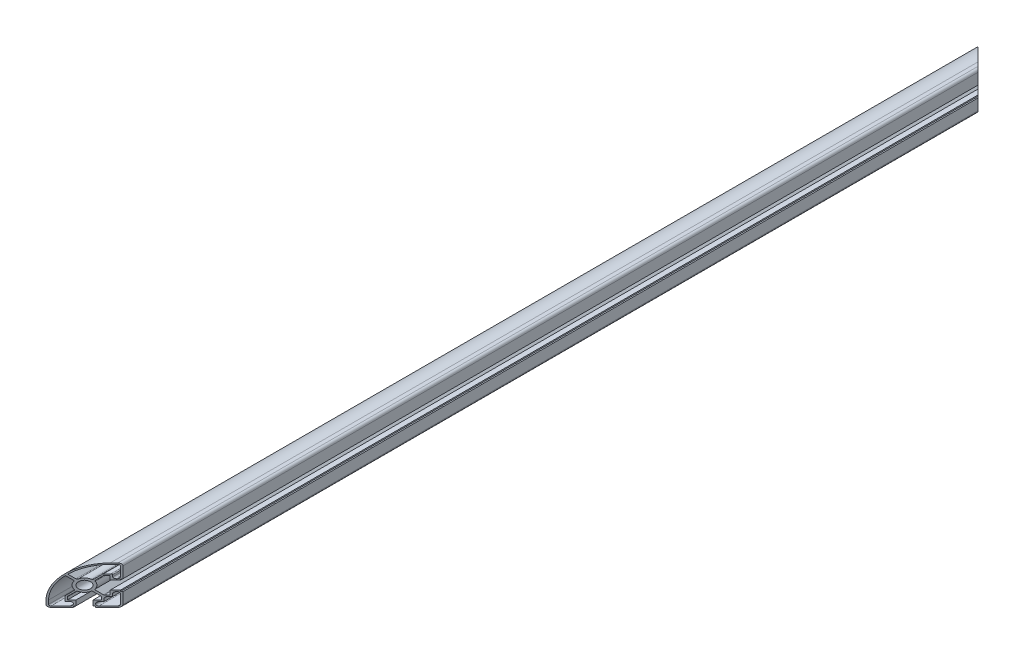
ISO-10303-21;
HEADER;
FILE_DESCRIPTION(('STEP AP214'),'2;1');
FILE_NAME('part.step','',(''),(''),'','','');
FILE_SCHEMA(('AUTOMOTIVE_DESIGN { 1 0 10303 214 1 1 1 1 }'));
ENDSEC;
DATA;
#1=APPLICATION_CONTEXT('core data for automotive mechanical design processes');
#2=APPLICATION_PROTOCOL_DEFINITION('international standard','automotive_design',2000,#1);
#3=PRODUCT_CONTEXT('',#1,'mechanical');
#4=PRODUCT('Part','Part','',(#3));
#5=PRODUCT_RELATED_PRODUCT_CATEGORY('part','',(#4));
#6=PRODUCT_DEFINITION_FORMATION('','',#4);
#7=PRODUCT_DEFINITION_CONTEXT('part definition',#1,'design');
#8=PRODUCT_DEFINITION('design','',#6,#7);
#9=PRODUCT_DEFINITION_SHAPE('','',#8);
#10=(LENGTH_UNIT() NAMED_UNIT(*) SI_UNIT(.MILLI.,.METRE.));
#11=(NAMED_UNIT(*) PLANE_ANGLE_UNIT() SI_UNIT($,.RADIAN.));
#12=(NAMED_UNIT(*) SI_UNIT($,.STERADIAN.) SOLID_ANGLE_UNIT());
#13=UNCERTAINTY_MEASURE_WITH_UNIT(LENGTH_MEASURE(1.E-05),#10,'distance_accuracy_value','');
#14=(GEOMETRIC_REPRESENTATION_CONTEXT(3) GLOBAL_UNCERTAINTY_ASSIGNED_CONTEXT((#13)) GLOBAL_UNIT_ASSIGNED_CONTEXT((#10,
#11,#12)) REPRESENTATION_CONTEXT('',''));
#15=CARTESIAN_POINT('',(0.,0.,0.));
#16=DIRECTION('',(0.,0.,1.));
#17=DIRECTION('',(1.,0.,0.));
#18=AXIS2_PLACEMENT_3D('',#15,#16,#17);
#19=CARTESIAN_POINT('',(-11.2928932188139,32.9999999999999,564.471170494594));
#20=DIRECTION('',(0.,0.,-1.));
#21=DIRECTION('',(-1.,0.,0.));
#22=AXIS2_PLACEMENT_3D('',#19,#20,#21);
#23=CYLINDRICAL_SURFACE('',#22,1.);
#24=CARTESIAN_POINT('',(-11.2928932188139,32.9999999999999,530.764063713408));
#25=DIRECTION('',(-0.707106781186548,0.,-0.707106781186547));
#26=DIRECTION('',(0.707106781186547,0.,-0.707106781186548));
#27=AXIS2_PLACEMENT_3D('',#24,#25,#26);
#28=ELLIPSE('',#27,1.4142135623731,1.);
#29=CARTESIAN_POINT('',(-11.2928932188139,33.9999999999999,530.764063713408));
#30=VERTEX_POINT('',#29);
#31=CARTESIAN_POINT('',(-12.0000000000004,33.7071067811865,531.471170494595));
#32=VERTEX_POINT('',#31);
#33=EDGE_CURVE('E1252',#30,#32,#28,.F.);
#34=ORIENTED_EDGE('',*,*,#33,.F.);
#35=DIRECTION('',(0.,0.,-1.));
#36=VECTOR('',#35,1.);
#37=CARTESIAN_POINT('',(-11.2928932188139,33.9999999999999,564.471170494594));
#38=LINE('',#37,#36);
#39=CARTESIAN_POINT('',(-11.2928932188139,33.9999999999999,-491.821722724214));
#40=VERTEX_POINT('',#39);
#41=EDGE_CURVE('E756',#30,#40,#38,.T.);
#42=ORIENTED_EDGE('',*,*,#41,.T.);
#43=CARTESIAN_POINT('',(-11.2928932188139,32.9999999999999,-491.821722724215));
#44=DIRECTION('',(-0.707106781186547,0.,0.707106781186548));
#45=DIRECTION('',(-0.707106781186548,0.,-0.707106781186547));
#46=AXIS2_PLACEMENT_3D('',#43,#44,#45);
#47=ELLIPSE('',#46,1.4142135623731,1.);
#48=CARTESIAN_POINT('',(-12.0000000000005,33.7071067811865,-492.528829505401));
#49=VERTEX_POINT('',#48);
#50=EDGE_CURVE('E955',#49,#40,#47,.F.);
#51=ORIENTED_EDGE('',*,*,#50,.F.);
#52=DIRECTION('',(0.,0.,-1.));
#53=VECTOR('',#52,1.);
#54=CARTESIAN_POINT('',(-12.0000000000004,33.7071067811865,564.471170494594));
#55=LINE('',#54,#53);
#56=EDGE_CURVE('E11',#32,#49,#55,.T.);
#57=ORIENTED_EDGE('',*,*,#56,.F.);
#58=EDGE_LOOP('',(#34,#42,#51,#57));
#59=FACE_BOUND('',#58,.T.);
#60=ADVANCED_FACE('F31',(#59),#23,.T.);
#61=CARTESIAN_POINT('',(-48.0631727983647,-2.35606601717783,564.471170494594));
#62=DIRECTION('',(-0.707106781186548,0.707106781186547,0.));
#63=DIRECTION('',(-0.707106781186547,-0.707106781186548,0.));
#64=AXIS2_PLACEMENT_3D('',#61,#62,#63);
#65=PLANE('',#64);
#66=DIRECTION('',(-0.577350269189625,-0.577350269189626,0.577350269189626));
#67=VECTOR('',#66,1.);
#68=CARTESIAN_POINT('',(-47.0421151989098,-1.33500841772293,566.513285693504));
#69=LINE('',#68,#67);
#70=CARTESIAN_POINT('',(-17.0685685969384,28.6385381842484,536.539739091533));
#71=VERTEX_POINT('',#70);
#72=EDGE_CURVE('E1250',#32,#71,#69,.T.);
#73=ORIENTED_EDGE('',*,*,#72,.F.);
#74=ORIENTED_EDGE('',*,*,#56,.T.);
#75=DIRECTION('',(0.577350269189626,0.577350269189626,0.577350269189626));
#76=VECTOR('',#75,1.);
#77=CARTESIAN_POINT('',(316.291218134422,361.998324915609,-164.237611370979));
#78=LINE('',#77,#76);
#79=CARTESIAN_POINT('',(-17.0685685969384,28.6385381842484,-497.597398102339));
#80=VERTEX_POINT('',#79);
#81=EDGE_CURVE('E952',#80,#49,#78,.T.);
#82=ORIENTED_EDGE('',*,*,#81,.F.);
#83=DIRECTION('',(0.,0.,-1.));
#84=VECTOR('',#83,1.);
#85=CARTESIAN_POINT('',(-17.0685685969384,28.6385381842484,564.471170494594));
#86=LINE('',#85,#84);
#87=EDGE_CURVE('E40',#71,#80,#86,.T.);
#88=ORIENTED_EDGE('',*,*,#87,.F.);
#89=EDGE_LOOP('',(#73,#74,#82,#88));
#90=FACE_BOUND('',#89,.T.);
#91=ADVANCED_FACE('F1365',(#90),#65,.T.);
#92=CARTESIAN_POINT('',(-17.775675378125,29.345644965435,564.471170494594));
#93=DIRECTION('',(0.,0.,-1.));
#94=DIRECTION('',(-1.,0.,0.));
#95=AXIS2_PLACEMENT_3D('',#92,#93,#94);
#96=CYLINDRICAL_SURFACE('',#95,1.);
#97=CARTESIAN_POINT('',(-17.775675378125,29.345644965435,537.246845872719));
#98=DIRECTION('',(-0.707106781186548,0.,-0.707106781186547));
#99=DIRECTION('',(0.707106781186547,0.,-0.707106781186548));
#100=AXIS2_PLACEMENT_3D('',#97,#98,#99);
#101=ELLIPSE('',#100,1.4142135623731,1.);
#102=CARTESIAN_POINT('',(-18.3436682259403,28.5226114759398,537.814838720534));
#103=VERTEX_POINT('',#102);
#104=EDGE_CURVE('E1248',#71,#103,#101,.T.);
#105=ORIENTED_EDGE('',*,*,#104,.F.);
#106=ORIENTED_EDGE('',*,*,#87,.T.);
#107=CARTESIAN_POINT('',(-17.775675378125,29.345644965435,-498.304504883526));
#108=DIRECTION('',(-0.707106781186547,0.,0.707106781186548));
#109=DIRECTION('',(-0.707106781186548,0.,-0.707106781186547));
#110=AXIS2_PLACEMENT_3D('',#107,#108,#109);
#111=ELLIPSE('',#110,1.4142135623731,1.);
#112=CARTESIAN_POINT('',(-18.3436682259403,28.5226114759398,-498.872497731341));
#113=VERTEX_POINT('',#112);
#114=EDGE_CURVE('E949',#113,#80,#111,.T.);
#115=ORIENTED_EDGE('',*,*,#114,.F.);
#116=DIRECTION('',(0.,0.,-1.));
#117=VECTOR('',#116,1.);
#118=CARTESIAN_POINT('',(-18.3436682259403,28.5226114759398,564.471170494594));
#119=LINE('',#118,#117);
#120=EDGE_CURVE('E782',#103,#113,#119,.T.);
#121=ORIENTED_EDGE('',*,*,#120,.F.);
#122=EDGE_LOOP('',(#105,#106,#115,#121));
#123=FACE_BOUND('',#122,.T.);
#124=ADVANCED_FACE('F1371',(#123),#96,.F.);
#125=CARTESIAN_POINT('',(-22.5,22.5,564.471170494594));
#126=DIRECTION('',(0.,0.,-1.));
#127=DIRECTION('',(-1.,0.,0.));
#128=AXIS2_PLACEMENT_3D('',#125,#126,#127);
#129=CYLINDRICAL_SURFACE('',#128,7.31757765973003);
#130=DIRECTION('',(0.,0.,-1.));
#131=VECTOR('',#130,1.);
#132=CARTESIAN_POINT('',(-26.2783100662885,28.7666830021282,564.471170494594));
#133=LINE('',#132,#131);
#134=CARTESIAN_POINT('',(-26.2783100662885,28.7666830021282,545.749480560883));
#135=VERTEX_POINT('',#134);
#136=CARTESIAN_POINT('',(-26.2783100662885,28.7666830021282,-506.807139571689));
#137=VERTEX_POINT('',#136);
#138=EDGE_CURVE('E780',#135,#137,#133,.T.);
#139=ORIENTED_EDGE('',*,*,#138,.F.);
#140=CARTESIAN_POINT('',(-22.5,22.5,541.971170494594));
#141=DIRECTION('',(-0.707106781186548,0.,-0.707106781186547));
#142=DIRECTION('',(0.707106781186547,0.,-0.707106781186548));
#143=AXIS2_PLACEMENT_3D('',#140,#141,#142);
#144=ELLIPSE('',#143,10.3486175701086,7.31757765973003);
#145=EDGE_CURVE('E1245',#135,#103,#144,.T.);
#146=ORIENTED_EDGE('',*,*,#145,.T.);
#147=ORIENTED_EDGE('',*,*,#120,.T.);
#148=CARTESIAN_POINT('',(-22.5,22.5,-503.028829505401));
#149=DIRECTION('',(-0.707106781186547,0.,0.707106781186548));
#150=DIRECTION('',(-0.707106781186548,0.,-0.707106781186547));
#151=AXIS2_PLACEMENT_3D('',#148,#149,#150);
#152=ELLIPSE('',#151,10.3486175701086,7.31757765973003);
#153=EDGE_CURVE('E946',#113,#137,#152,.T.);
#154=ORIENTED_EDGE('',*,*,#153,.T.);
#155=EDGE_LOOP('',(#139,#146,#147,#154));
#156=FACE_BOUND('',#155,.T.);
#157=ADVANCED_FACE('F2133',(#156),#129,.T.);
#158=CARTESIAN_POINT('',(-26.7946435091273,29.6230706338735,564.471170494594));
#159=DIRECTION('',(0.,0.,-1.));
#160=DIRECTION('',(-1.,0.,0.));
#161=AXIS2_PLACEMENT_3D('',#158,#159,#160);
#162=CYLINDRICAL_SURFACE('',#161,1.);
#163=DIRECTION('',(0.,0.,-1.));
#164=VECTOR('',#163,1.);
#165=CARTESIAN_POINT('',(-27.5017502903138,28.9159638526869,564.471170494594));
#166=LINE('',#165,#164);
#167=CARTESIAN_POINT('',(-27.5017502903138,28.9159638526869,546.972920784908));
#168=VERTEX_POINT('',#167);
#169=CARTESIAN_POINT('',(-27.5017502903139,28.915963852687,-508.030579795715));
#170=VERTEX_POINT('',#169);
#171=EDGE_CURVE('E778',#168,#170,#166,.T.);
#172=ORIENTED_EDGE('',*,*,#171,.F.);
#173=CARTESIAN_POINT('',(-26.7946435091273,29.6230706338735,546.265814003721));
#174=DIRECTION('',(-0.707106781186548,0.,-0.707106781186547));
#175=DIRECTION('',(0.707106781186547,0.,-0.707106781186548));
#176=AXIS2_PLACEMENT_3D('',#173,#174,#175);
#177=ELLIPSE('',#176,1.4142135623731,1.);
#178=EDGE_CURVE('E1242',#168,#135,#177,.F.);
#179=ORIENTED_EDGE('',*,*,#178,.T.);
#180=ORIENTED_EDGE('',*,*,#138,.T.);
#181=CARTESIAN_POINT('',(-26.7946435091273,29.6230706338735,-507.323473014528));
#182=DIRECTION('',(-0.707106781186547,0.,0.707106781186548));
#183=DIRECTION('',(-0.707106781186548,0.,-0.707106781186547));
#184=AXIS2_PLACEMENT_3D('',#181,#182,#183);
#185=ELLIPSE('',#184,1.4142135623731,1.);
#186=EDGE_CURVE('E943',#137,#170,#185,.F.);
#187=ORIENTED_EDGE('',*,*,#186,.T.);
#188=EDGE_LOOP('',(#172,#179,#180,#187));
#189=FACE_BOUND('',#188,.T.);
#190=ADVANCED_FACE('F2124',(#189),#162,.F.);
#191=CARTESIAN_POINT('',(3.77027957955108,-2.35606601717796,564.471170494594));
#192=DIRECTION('',(-0.707106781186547,-0.707106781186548,0.));
#193=DIRECTION('',(0.707106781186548,-0.707106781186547,0.));
#194=AXIS2_PLACEMENT_3D('',#191,#192,#193);
#195=PLANE('',#194);
#196=DIRECTION('',(0.,0.,-1.));
#197=VECTOR('',#196,1.);
#198=CARTESIAN_POINT('',(-32.2389145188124,33.6531280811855,564.471170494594));
#199=LINE('',#198,#197);
#200=CARTESIAN_POINT('',(-32.2389145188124,33.6531280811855,551.710085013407));
#201=VERTEX_POINT('',#200);
#202=CARTESIAN_POINT('',(-32.2389145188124,33.6531280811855,-512.767744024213));
#203=VERTEX_POINT('',#202);
#204=EDGE_CURVE('E776',#201,#203,#199,.T.);
#205=ORIENTED_EDGE('',*,*,#204,.F.);
#206=DIRECTION('',(0.577350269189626,-0.577350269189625,-0.577350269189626));
#207=VECTOR('',#206,1.);
#208=CARTESIAN_POINT('',(-12.4864802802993,13.9006938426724,531.957650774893));
#209=LINE('',#208,#207);
#210=EDGE_CURVE('E1239',#201,#168,#209,.T.);
#211=ORIENTED_EDGE('',*,*,#210,.T.);
#212=ORIENTED_EDGE('',*,*,#171,.T.);
#213=DIRECTION('',(-0.577350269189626,0.577350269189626,-0.577350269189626));
#214=VECTOR('',#213,1.);
#215=CARTESIAN_POINT('',(350.846853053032,-349.432639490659,-129.681976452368));
#216=LINE('',#215,#214);
#217=EDGE_CURVE('E940',#170,#203,#216,.T.);
#218=ORIENTED_EDGE('',*,*,#217,.T.);
#219=EDGE_LOOP('',(#205,#211,#212,#218));
#220=FACE_BOUND('',#219,.T.);
#221=ADVANCED_FACE('F2115',(#220),#195,.F.);
#222=CARTESIAN_POINT('',(-7.5,7.5,564.471170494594));
#223=DIRECTION('',(0.,0.,-1.));
#224=DIRECTION('',(-1.,0.,0.));
#225=AXIS2_PLACEMENT_3D('',#222,#223,#224);
#226=CYLINDRICAL_SURFACE('',#225,36.);
#227=CARTESIAN_POINT('',(-7.5,7.5,526.971170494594));
#228=DIRECTION('',(-0.707106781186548,0.,-0.707106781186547));
#229=DIRECTION('',(0.707106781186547,0.,-0.707106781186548));
#230=AXIS2_PLACEMENT_3D('',#227,#228,#229);
#231=ELLIPSE('',#230,50.9116882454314,36.);
#232=CARTESIAN_POINT('',(-7.5,43.5,526.971170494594));
#233=VERTEX_POINT('',#232);
#234=EDGE_CURVE('E1237',#201,#233,#231,.T.);
#235=ORIENTED_EDGE('',*,*,#234,.F.);
#236=ORIENTED_EDGE('',*,*,#204,.T.);
#237=CARTESIAN_POINT('',(-7.5,7.5,-488.028829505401));
#238=DIRECTION('',(-0.707106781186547,0.,0.707106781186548));
#239=DIRECTION('',(-0.707106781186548,0.,-0.707106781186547));
#240=AXIS2_PLACEMENT_3D('',#237,#238,#239);
#241=ELLIPSE('',#240,50.9116882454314,36.);
#242=CARTESIAN_POINT('',(-7.49999999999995,43.5,-488.028829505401));
#243=VERTEX_POINT('',#242);
#244=EDGE_CURVE('E937',#243,#203,#241,.T.);
#245=ORIENTED_EDGE('',*,*,#244,.F.);
#246=DIRECTION('',(0.,0.,-1.));
#247=VECTOR('',#246,1.);
#248=CARTESIAN_POINT('',(-7.5,43.5,564.471170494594));
#249=LINE('',#248,#247);
#250=EDGE_CURVE('E774',#233,#243,#249,.T.);
#251=ORIENTED_EDGE('',*,*,#250,.F.);
#252=EDGE_LOOP('',(#235,#236,#245,#251));
#253=FACE_BOUND('',#252,.T.);
#254=ADVANCED_FACE('F2106',(#253),#226,.F.);
#255=CARTESIAN_POINT('',(-22.1464466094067,43.5,564.471170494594));
#256=DIRECTION('',(0.,-1.,0.));
#257=DIRECTION('',(0.,0.,-1.));
#258=AXIS2_PLACEMENT_3D('',#255,#256,#257);
#259=PLANE('',#258);
#260=DIRECTION('',(0.707106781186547,0.,-0.707106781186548));
#261=VECTOR('',#260,1.);
#262=CARTESIAN_POINT('',(-33.5732233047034,43.5,553.044393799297));
#263=LINE('',#262,#261);
#264=CARTESIAN_POINT('',(-3.00000000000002,43.5,522.471170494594));
#265=VERTEX_POINT('',#264);
#266=EDGE_CURVE('E1235',#233,#265,#263,.T.);
#267=ORIENTED_EDGE('',*,*,#266,.F.);
#268=ORIENTED_EDGE('',*,*,#250,.T.);
#269=DIRECTION('',(-0.707106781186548,0.,-0.707106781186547));
#270=VECTOR('',#269,1.);
#271=CARTESIAN_POINT('',(511.426776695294,43.5,30.8979471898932));
#272=LINE('',#271,#270);
#273=CARTESIAN_POINT('',(-3.00000000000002,43.5,-483.528829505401));
#274=VERTEX_POINT('',#273);
#275=EDGE_CURVE('E934',#274,#243,#272,.T.);
#276=ORIENTED_EDGE('',*,*,#275,.F.);
#277=DIRECTION('',(0.,0.,-1.));
#278=VECTOR('',#277,1.);
#279=CARTESIAN_POINT('',(-3.00000000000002,43.5,564.471170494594));
#280=LINE('',#279,#278);
#281=EDGE_CURVE('E772',#265,#274,#280,.T.);
#282=ORIENTED_EDGE('',*,*,#281,.F.);
#283=EDGE_LOOP('',(#267,#268,#276,#282));
#284=FACE_BOUND('',#283,.T.);
#285=ADVANCED_FACE('F2097',(#284),#259,.T.);
#286=CARTESIAN_POINT('',(-3.,42.,564.471170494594));
#287=DIRECTION('',(0.,0.,-1.));
#288=DIRECTION('',(-1.,0.,0.));
#289=AXIS2_PLACEMENT_3D('',#286,#287,#288);
#290=CYLINDRICAL_SURFACE('',#289,1.5);
#291=CARTESIAN_POINT('',(-3.,42.,522.471170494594));
#292=DIRECTION('',(-0.707106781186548,0.,-0.707106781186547));
#293=DIRECTION('',(0.707106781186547,0.,-0.707106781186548));
#294=AXIS2_PLACEMENT_3D('',#291,#292,#293);
#295=ELLIPSE('',#294,2.12132034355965,1.5);
#296=CARTESIAN_POINT('',(-1.5,42.,520.971170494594));
#297=VERTEX_POINT('',#296);
#298=EDGE_CURVE('E1233',#265,#297,#295,.T.);
#299=ORIENTED_EDGE('',*,*,#298,.F.);
#300=ORIENTED_EDGE('',*,*,#281,.T.);
#301=CARTESIAN_POINT('',(-3.,42.,-483.528829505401));
#302=DIRECTION('',(-0.707106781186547,0.,0.707106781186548));
#303=DIRECTION('',(-0.707106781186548,0.,-0.707106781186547));
#304=AXIS2_PLACEMENT_3D('',#301,#302,#303);
#305=ELLIPSE('',#304,2.12132034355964,1.5);
#306=CARTESIAN_POINT('',(-1.5,42.,-482.0288295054));
#307=VERTEX_POINT('',#306);
#308=EDGE_CURVE('E931',#307,#274,#305,.T.);
#309=ORIENTED_EDGE('',*,*,#308,.F.);
#310=DIRECTION('',(0.,0.,-1.));
#311=VECTOR('',#310,1.);
#312=CARTESIAN_POINT('',(-1.5,42.,564.471170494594));
#313=LINE('',#312,#311);
#314=EDGE_CURVE('E770',#297,#307,#313,.T.);
#315=ORIENTED_EDGE('',*,*,#314,.F.);
#316=EDGE_LOOP('',(#299,#300,#309,#315));
#317=FACE_BOUND('',#316,.T.);
#318=ADVANCED_FACE('F2088',(#317),#290,.F.);
#319=CARTESIAN_POINT('',(-1.5,-28.2727922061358,564.471170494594));
#320=DIRECTION('',(1.,0.,0.));
#321=DIRECTION('',(0.,1.,0.));
#322=AXIS2_PLACEMENT_3D('',#319,#320,#321);
#323=PLANE('',#322);
#324=DIRECTION('',(0.,0.,-1.));
#325=VECTOR('',#324,1.);
#326=CARTESIAN_POINT('',(-1.5,31.,564.471170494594));
#327=LINE('',#326,#325);
#328=CARTESIAN_POINT('',(-1.5,31.,520.971170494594));
#329=VERTEX_POINT('',#328);
#330=CARTESIAN_POINT('',(-1.5,31.,-482.0288295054));
#331=VERTEX_POINT('',#330);
#332=EDGE_CURVE('E768',#329,#331,#327,.T.);
#333=ORIENTED_EDGE('',*,*,#332,.F.);
#334=DIRECTION('',(0.,1.,0.));
#335=VECTOR('',#334,1.);
#336=CARTESIAN_POINT('',(-1.5,-28.2727922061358,520.971170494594));
#337=LINE('',#336,#335);
#338=EDGE_CURVE('E1230',#329,#297,#337,.T.);
#339=ORIENTED_EDGE('',*,*,#338,.T.);
#340=ORIENTED_EDGE('',*,*,#314,.T.);
#341=DIRECTION('',(0.,-1.,0.));
#342=VECTOR('',#341,1.);
#343=CARTESIAN_POINT('',(-1.5,-28.2727922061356,-482.0288295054));
#344=LINE('',#343,#342);
#345=EDGE_CURVE('E928',#307,#331,#344,.T.);
#346=ORIENTED_EDGE('',*,*,#345,.T.);
#347=EDGE_LOOP('',(#333,#339,#340,#346));
#348=FACE_BOUND('',#347,.T.);
#349=ADVANCED_FACE('F2079',(#348),#323,.F.);
#350=CARTESIAN_POINT('',(-3.5,31.,564.471170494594));
#351=DIRECTION('',(0.,0.,-1.));
#352=DIRECTION('',(-1.,0.,0.));
#353=AXIS2_PLACEMENT_3D('',#350,#351,#352);
#354=CYLINDRICAL_SURFACE('',#353,2.);
#355=CARTESIAN_POINT('',(-3.5,31.,522.971170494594));
#356=DIRECTION('',(-0.707106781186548,0.,-0.707106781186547));
#357=DIRECTION('',(0.707106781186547,0.,-0.707106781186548));
#358=AXIS2_PLACEMENT_3D('',#355,#356,#357);
#359=ELLIPSE('',#358,2.82842712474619,2.);
#360=CARTESIAN_POINT('',(-3.50000000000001,29.,522.971170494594));
#361=VERTEX_POINT('',#360);
#362=EDGE_CURVE('E1228',#329,#361,#359,.T.);
#363=ORIENTED_EDGE('',*,*,#362,.F.);
#364=ORIENTED_EDGE('',*,*,#332,.T.);
#365=CARTESIAN_POINT('',(-3.5,31.,-484.0288295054));
#366=DIRECTION('',(-0.707106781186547,0.,0.707106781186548));
#367=DIRECTION('',(-0.707106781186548,0.,-0.707106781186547));
#368=AXIS2_PLACEMENT_3D('',#365,#366,#367);
#369=ELLIPSE('',#368,2.82842712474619,2.);
#370=CARTESIAN_POINT('',(-3.49999999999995,29.,-484.028829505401));
#371=VERTEX_POINT('',#370);
#372=EDGE_CURVE('E925',#371,#331,#369,.T.);
#373=ORIENTED_EDGE('',*,*,#372,.F.);
#374=DIRECTION('',(0.,0.,-1.));
#375=VECTOR('',#374,1.);
#376=CARTESIAN_POINT('',(-3.50000000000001,29.,564.471170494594));
#377=LINE('',#376,#375);
#378=EDGE_CURVE('E766',#361,#371,#377,.T.);
#379=ORIENTED_EDGE('',*,*,#378,.F.);
#380=EDGE_LOOP('',(#363,#364,#373,#379));
#381=FACE_BOUND('',#380,.T.);
#382=ADVANCED_FACE('F2070',(#381),#354,.F.);
#383=CARTESIAN_POINT('',(-22.1464466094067,29.,564.471170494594));
#384=DIRECTION('',(0.,-1.,0.));
#385=DIRECTION('',(0.,0.,-1.));
#386=AXIS2_PLACEMENT_3D('',#383,#384,#385);
#387=PLANE('',#386);
#388=DIRECTION('',(0.,0.,-1.));
#389=VECTOR('',#388,1.);
#390=CARTESIAN_POINT('',(-4.00000000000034,29.,564.471170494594));
#391=LINE('',#390,#389);
#392=CARTESIAN_POINT('',(-4.00000000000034,29.,523.471170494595));
#393=VERTEX_POINT('',#392);
#394=CARTESIAN_POINT('',(-4.00000000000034,29.,-484.528829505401));
#395=VERTEX_POINT('',#394);
#396=EDGE_CURVE('E764',#393,#395,#391,.T.);
#397=ORIENTED_EDGE('',*,*,#396,.F.);
#398=DIRECTION('',(0.707106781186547,0.,-0.707106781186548));
#399=VECTOR('',#398,1.);
#400=CARTESIAN_POINT('',(-33.5732233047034,29.,553.044393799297));
#401=LINE('',#400,#399);
#402=EDGE_CURVE('E1225',#393,#361,#401,.T.);
#403=ORIENTED_EDGE('',*,*,#402,.T.);
#404=ORIENTED_EDGE('',*,*,#378,.T.);
#405=DIRECTION('',(-0.707106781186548,0.,-0.707106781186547));
#406=VECTOR('',#405,1.);
#407=CARTESIAN_POINT('',(511.426776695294,29.,30.8979471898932));
#408=LINE('',#407,#406);
#409=EDGE_CURVE('E922',#371,#395,#408,.T.);
#410=ORIENTED_EDGE('',*,*,#409,.T.);
#411=EDGE_LOOP('',(#397,#403,#404,#410));
#412=FACE_BOUND('',#411,.T.);
#413=ADVANCED_FACE('F2061',(#412),#387,.F.);
#414=CARTESIAN_POINT('',(-4.00000000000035,31.,564.471170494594));
#415=DIRECTION('',(0.,0.,-1.));
#416=DIRECTION('',(-1.,0.,0.));
#417=AXIS2_PLACEMENT_3D('',#414,#415,#416);
#418=CYLINDRICAL_SURFACE('',#417,2.);
#419=DIRECTION('',(0.,0.,-1.));
#420=VECTOR('',#419,1.);
#421=CARTESIAN_POINT('',(-6.00000000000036,31.,564.471170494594));
#422=LINE('',#421,#420);
#423=CARTESIAN_POINT('',(-6.00000000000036,31.,525.471170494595));
#424=VERTEX_POINT('',#423);
#425=CARTESIAN_POINT('',(-6.00000000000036,31.,-486.528829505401));
#426=VERTEX_POINT('',#425);
#427=EDGE_CURVE('E762',#424,#426,#422,.T.);
#428=ORIENTED_EDGE('',*,*,#427,.F.);
#429=CARTESIAN_POINT('',(-4.00000000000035,31.,523.471170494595));
#430=DIRECTION('',(-0.707106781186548,0.,-0.707106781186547));
#431=DIRECTION('',(0.707106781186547,0.,-0.707106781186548));
#432=AXIS2_PLACEMENT_3D('',#429,#430,#431);
#433=ELLIPSE('',#432,2.82842712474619,2.);
#434=EDGE_CURVE('E1222',#424,#393,#433,.F.);
#435=ORIENTED_EDGE('',*,*,#434,.T.);
#436=ORIENTED_EDGE('',*,*,#396,.T.);
#437=CARTESIAN_POINT('',(-4.00000000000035,31.,-484.528829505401));
#438=DIRECTION('',(-0.707106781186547,0.,0.707106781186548));
#439=DIRECTION('',(-0.707106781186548,0.,-0.707106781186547));
#440=AXIS2_PLACEMENT_3D('',#437,#438,#439);
#441=ELLIPSE('',#440,2.82842712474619,2.);
#442=EDGE_CURVE('E919',#395,#426,#441,.F.);
#443=ORIENTED_EDGE('',*,*,#442,.T.);
#444=EDGE_LOOP('',(#428,#435,#436,#443));
#445=FACE_BOUND('',#444,.T.);
#446=ADVANCED_FACE('F2052',(#445),#418,.F.);
#447=CARTESIAN_POINT('',(-6.00000000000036,-28.2727922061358,564.471170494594));
#448=DIRECTION('',(1.,0.,0.));
#449=DIRECTION('',(0.,0.,-1.));
#450=AXIS2_PLACEMENT_3D('',#447,#448,#449);
#451=PLANE('',#450);
#452=DIRECTION('',(0.,1.,0.));
#453=VECTOR('',#452,1.);
#454=CARTESIAN_POINT('',(-6.00000000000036,-28.2727922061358,525.471170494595));
#455=LINE('',#454,#453);
#456=CARTESIAN_POINT('',(-6.00000000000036,32.9999999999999,525.471170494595));
#457=VERTEX_POINT('',#456);
#458=EDGE_CURVE('E1220',#424,#457,#455,.T.);
#459=ORIENTED_EDGE('',*,*,#458,.F.);
#460=ORIENTED_EDGE('',*,*,#427,.T.);
#461=DIRECTION('',(0.,-1.,0.));
#462=VECTOR('',#461,1.);
#463=CARTESIAN_POINT('',(-6.00000000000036,-28.2727922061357,-486.528829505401));
#464=LINE('',#463,#462);
#465=CARTESIAN_POINT('',(-6.00000000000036,32.9999999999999,-486.528829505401));
#466=VERTEX_POINT('',#465);
#467=EDGE_CURVE('E916',#466,#426,#464,.T.);
#468=ORIENTED_EDGE('',*,*,#467,.F.);
#469=DIRECTION('',(0.,0.,-1.));
#470=VECTOR('',#469,1.);
#471=CARTESIAN_POINT('',(-6.00000000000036,32.9999999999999,564.471170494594));
#472=LINE('',#471,#470);
#473=EDGE_CURVE('E760',#457,#466,#472,.T.);
#474=ORIENTED_EDGE('',*,*,#473,.F.);
#475=EDGE_LOOP('',(#459,#460,#468,#474));
#476=FACE_BOUND('',#475,.T.);
#477=ADVANCED_FACE('F2043',(#476),#451,.T.);
#478=CARTESIAN_POINT('',(-7.00000000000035,32.9999999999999,564.471170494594));
#479=DIRECTION('',(0.,0.,-1.));
#480=DIRECTION('',(-1.,0.,0.));
#481=AXIS2_PLACEMENT_3D('',#478,#479,#480);
#482=CYLINDRICAL_SURFACE('',#481,1.);
#483=DIRECTION('',(0.,0.,-1.));
#484=VECTOR('',#483,1.);
#485=CARTESIAN_POINT('',(-7.00000000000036,33.9999999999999,564.471170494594));
#486=LINE('',#485,#484);
#487=CARTESIAN_POINT('',(-7.00000000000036,33.9999999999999,526.471170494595));
#488=VERTEX_POINT('',#487);
#489=CARTESIAN_POINT('',(-7.00000000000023,33.9999999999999,-487.528829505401));
#490=VERTEX_POINT('',#489);
#491=EDGE_CURVE('E758',#488,#490,#486,.T.);
#492=ORIENTED_EDGE('',*,*,#491,.F.);
#493=CARTESIAN_POINT('',(-7.00000000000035,32.9999999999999,526.471170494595));
#494=DIRECTION('',(-0.707106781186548,0.,-0.707106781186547));
#495=DIRECTION('',(0.707106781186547,0.,-0.707106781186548));
#496=AXIS2_PLACEMENT_3D('',#493,#494,#495);
#497=ELLIPSE('',#496,1.4142135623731,1.);
#498=EDGE_CURVE('E1217',#488,#457,#497,.T.);
#499=ORIENTED_EDGE('',*,*,#498,.T.);
#500=ORIENTED_EDGE('',*,*,#473,.T.);
#501=CARTESIAN_POINT('',(-7.00000000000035,32.9999999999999,-487.528829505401));
#502=DIRECTION('',(-0.707106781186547,0.,0.707106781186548));
#503=DIRECTION('',(-0.707106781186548,0.,-0.707106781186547));
#504=AXIS2_PLACEMENT_3D('',#501,#502,#503);
#505=ELLIPSE('',#504,1.4142135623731,1.);
#506=EDGE_CURVE('E913',#466,#490,#505,.T.);
#507=ORIENTED_EDGE('',*,*,#506,.T.);
#508=EDGE_LOOP('',(#492,#499,#500,#507));
#509=FACE_BOUND('',#508,.T.);
#510=ADVANCED_FACE('F2035',(#509),#482,.T.);
#511=CARTESIAN_POINT('',(-29.6230706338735,26.7946435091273,564.471170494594));
#512=DIRECTION('',(0.,0.,-1.));
#513=DIRECTION('',(-1.,0.,0.));
#514=AXIS2_PLACEMENT_3D('',#511,#512,#513);
#515=CYLINDRICAL_SURFACE('',#514,1.);
#516=CARTESIAN_POINT('',(-29.6230706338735,26.7946435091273,549.094241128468));
#517=DIRECTION('',(-0.707106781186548,0.,-0.707106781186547));
#518=DIRECTION('',(0.707106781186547,0.,-0.707106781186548));
#519=AXIS2_PLACEMENT_3D('',#516,#517,#518);
#520=ELLIPSE('',#519,1.4142135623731,1.);
#521=CARTESIAN_POINT('',(-28.915963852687,27.5017502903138,548.387134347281));
#522=VERTEX_POINT('',#521);
#523=CARTESIAN_POINT('',(-28.7666830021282,26.2783100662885,548.237853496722));
#524=VERTEX_POINT('',#523);
#525=EDGE_CURVE('E1101',#522,#524,#520,.T.);
#526=ORIENTED_EDGE('',*,*,#525,.F.);
#527=DIRECTION('',(0.,0.,-1.));
#528=VECTOR('',#527,1.);
#529=CARTESIAN_POINT('',(-28.9159638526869,27.5017502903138,564.471170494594));
#530=LINE('',#529,#528);
#531=CARTESIAN_POINT('',(-28.915963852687,27.5017502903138,-509.444793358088));
#532=VERTEX_POINT('',#531);
#533=EDGE_CURVE('E631',#522,#532,#530,.T.);
#534=ORIENTED_EDGE('',*,*,#533,.T.);
#535=CARTESIAN_POINT('',(-29.6230706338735,26.7946435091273,-510.151900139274));
#536=DIRECTION('',(-0.707106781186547,0.,0.707106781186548));
#537=DIRECTION('',(-0.707106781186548,0.,-0.707106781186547));
#538=AXIS2_PLACEMENT_3D('',#535,#536,#537);
#539=ELLIPSE('',#538,1.41421356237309,1.);
#540=CARTESIAN_POINT('',(-28.7666830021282,26.2783100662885,-509.295512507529));
#541=VERTEX_POINT('',#540);
#542=EDGE_CURVE('E828',#541,#532,#539,.T.);
#543=ORIENTED_EDGE('',*,*,#542,.F.);
#544=DIRECTION('',(0.,0.,-1.));
#545=VECTOR('',#544,1.);
#546=CARTESIAN_POINT('',(-28.7666830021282,26.2783100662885,564.471170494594));
#547=LINE('',#546,#545);
#548=EDGE_CURVE('E677',#524,#541,#547,.T.);
#549=ORIENTED_EDGE('',*,*,#548,.F.);
#550=EDGE_LOOP('',(#526,#534,#543,#549));
#551=FACE_BOUND('',#550,.T.);
#552=ADVANCED_FACE('F833',(#551),#515,.F.);
#553=CARTESIAN_POINT('',(-22.5,22.5,564.471170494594));
#554=DIRECTION('',(0.,0.,-1.));
#555=DIRECTION('',(-1.,0.,0.));
#556=AXIS2_PLACEMENT_3D('',#553,#554,#555);
#557=CYLINDRICAL_SURFACE('',#556,7.31757765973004);
#558=DIRECTION('',(0.,0.,-1.));
#559=VECTOR('',#558,1.);
#560=CARTESIAN_POINT('',(-28.5226114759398,18.3436682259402,564.471170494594));
#561=LINE('',#560,#559);
#562=CARTESIAN_POINT('',(-28.5226114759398,18.3436682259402,547.993781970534));
#563=VERTEX_POINT('',#562);
#564=CARTESIAN_POINT('',(-28.5226114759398,18.3436682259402,-509.05144098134));
#565=VERTEX_POINT('',#564);
#566=EDGE_CURVE('E807',#563,#565,#561,.T.);
#567=ORIENTED_EDGE('',*,*,#566,.F.);
#568=CARTESIAN_POINT('',(-22.5,22.5,541.971170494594));
#569=DIRECTION('',(-0.707106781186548,0.,-0.707106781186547));
#570=DIRECTION('',(0.707106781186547,0.,-0.707106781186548));
#571=AXIS2_PLACEMENT_3D('',#568,#569,#570);
#572=ELLIPSE('',#571,10.3486175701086,7.31757765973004);
#573=EDGE_CURVE('E820',#563,#524,#572,.T.);
#574=ORIENTED_EDGE('',*,*,#573,.T.);
#575=ORIENTED_EDGE('',*,*,#548,.T.);
#576=CARTESIAN_POINT('',(-22.5,22.5,-503.028829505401));
#577=DIRECTION('',(-0.707106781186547,0.,0.707106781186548));
#578=DIRECTION('',(-0.707106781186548,0.,-0.707106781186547));
#579=AXIS2_PLACEMENT_3D('',#576,#577,#578);
#580=ELLIPSE('',#579,10.3486175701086,7.31757765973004);
#581=EDGE_CURVE('E819',#541,#565,#580,.T.);
#582=ORIENTED_EDGE('',*,*,#581,.T.);
#583=EDGE_LOOP('',(#567,#574,#575,#582));
#584=FACE_BOUND('',#583,.T.);
#585=ADVANCED_FACE('F818',(#584),#557,.T.);
#586=CARTESIAN_POINT('',(-29.345644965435,17.7756753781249,564.471170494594));
#587=DIRECTION('',(0.,0.,-1.));
#588=DIRECTION('',(-1.,0.,0.));
#589=AXIS2_PLACEMENT_3D('',#586,#587,#588);
#590=CYLINDRICAL_SURFACE('',#589,1.);
#591=DIRECTION('',(0.,0.,-1.));
#592=VECTOR('',#591,1.);
#593=CARTESIAN_POINT('',(-28.6385381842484,17.0685685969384,564.471170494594));
#594=LINE('',#593,#592);
#595=CARTESIAN_POINT('',(-28.6385381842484,17.0685685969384,548.109708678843));
#596=VERTEX_POINT('',#595);
#597=CARTESIAN_POINT('',(-28.6385381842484,17.0685685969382,-509.167367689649));
#598=VERTEX_POINT('',#597);
#599=EDGE_CURVE('E806',#596,#598,#594,.T.);
#600=ORIENTED_EDGE('',*,*,#599,.F.);
#601=CARTESIAN_POINT('',(-29.345644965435,17.7756753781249,548.816815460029));
#602=DIRECTION('',(-0.707106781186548,0.,-0.707106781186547));
#603=DIRECTION('',(0.707106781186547,0.,-0.707106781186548));
#604=AXIS2_PLACEMENT_3D('',#601,#602,#603);
#605=ELLIPSE('',#604,1.4142135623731,1.);
#606=EDGE_CURVE('E1078',#596,#563,#605,.F.);
#607=ORIENTED_EDGE('',*,*,#606,.T.);
#608=ORIENTED_EDGE('',*,*,#566,.T.);
#609=CARTESIAN_POINT('',(-29.345644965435,17.7756753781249,-509.874474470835));
#610=DIRECTION('',(-0.707106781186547,0.,0.707106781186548));
#611=DIRECTION('',(-0.707106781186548,0.,-0.707106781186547));
#612=AXIS2_PLACEMENT_3D('',#609,#610,#611);
#613=ELLIPSE('',#612,1.41421356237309,1.);
#614=EDGE_CURVE('E831',#565,#598,#613,.F.);
#615=ORIENTED_EDGE('',*,*,#614,.T.);
#616=EDGE_LOOP('',(#600,#607,#608,#615));
#617=FACE_BOUND('',#616,.T.);
#618=ADVANCED_FACE('F1077',(#617),#590,.F.);
#619=CARTESIAN_POINT('',(-48.0631727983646,-2.35606601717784,564.471170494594));
#620=DIRECTION('',(0.707106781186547,-0.707106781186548,0.));
#621=DIRECTION('',(0.707106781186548,0.707106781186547,0.));
#622=AXIS2_PLACEMENT_3D('',#619,#620,#621);
#623=PLANE('',#622);
#624=DIRECTION('',(0.,0.,-1.));
#625=VECTOR('',#624,1.);
#626=CARTESIAN_POINT('',(-34.,11.7071067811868,564.471170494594));
#627=LINE('',#626,#625);
#628=CARTESIAN_POINT('',(-34.,11.7071067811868,553.471170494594));
#629=VERTEX_POINT('',#628);
#630=CARTESIAN_POINT('',(-34.,11.7071067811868,-514.528829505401));
#631=VERTEX_POINT('',#630);
#632=EDGE_CURVE('E804',#629,#631,#627,.T.);
#633=ORIENTED_EDGE('',*,*,#632,.F.);
#634=DIRECTION('',(0.577350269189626,0.577350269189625,-0.577350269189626));
#635=VECTOR('',#634,1.);
#636=CARTESIAN_POINT('',(-47.0421151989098,-1.33500841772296,566.513285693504));
#637=LINE('',#636,#635);
#638=EDGE_CURVE('E1083',#629,#596,#637,.T.);
#639=ORIENTED_EDGE('',*,*,#638,.T.);
#640=ORIENTED_EDGE('',*,*,#599,.T.);
#641=DIRECTION('',(-0.577350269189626,-0.577350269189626,-0.577350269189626));
#642=VECTOR('',#641,1.);
#643=CARTESIAN_POINT('',(316.291218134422,361.998324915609,-164.237611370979));
#644=LINE('',#643,#642);
#645=EDGE_CURVE('E1074',#598,#631,#644,.T.);
#646=ORIENTED_EDGE('',*,*,#645,.T.);
#647=EDGE_LOOP('',(#633,#639,#640,#646));
#648=FACE_BOUND('',#647,.T.);
#649=ADVANCED_FACE('F1082',(#648),#623,.F.);
#650=CARTESIAN_POINT('',(-34.,-28.2727922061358,564.471170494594));
#651=DIRECTION('',(-1.,0.,0.));
#652=DIRECTION('',(0.,0.,1.));
#653=AXIS2_PLACEMENT_3D('',#650,#651,#652);
#654=PLANE('',#653);
#655=DIRECTION('',(0.,-1.,0.));
#656=VECTOR('',#655,1.);
#657=CARTESIAN_POINT('',(-34.,-28.2727922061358,553.471170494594));
#658=LINE('',#657,#656);
#659=CARTESIAN_POINT('',(-34.,6.,553.471170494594));
#660=VERTEX_POINT('',#659);
#661=EDGE_CURVE('E1090',#629,#660,#658,.T.);
#662=ORIENTED_EDGE('',*,*,#661,.F.);
#663=ORIENTED_EDGE('',*,*,#632,.T.);
#664=DIRECTION('',(0.,1.,0.));
#665=VECTOR('',#664,1.);
#666=CARTESIAN_POINT('',(-34.,-28.2727922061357,-514.528829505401));
#667=LINE('',#666,#665);
#668=CARTESIAN_POINT('',(-34.,6.,-514.528829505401));
#669=VERTEX_POINT('',#668);
#670=EDGE_CURVE('E1071',#669,#631,#667,.T.);
#671=ORIENTED_EDGE('',*,*,#670,.F.);
#672=DIRECTION('',(0.,0.,-1.));
#673=VECTOR('',#672,1.);
#674=CARTESIAN_POINT('',(-34.,6.,564.471170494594));
#675=LINE('',#674,#673);
#676=EDGE_CURVE('E802',#660,#669,#675,.T.);
#677=ORIENTED_EDGE('',*,*,#676,.F.);
#678=EDGE_LOOP('',(#662,#663,#671,#677));
#679=FACE_BOUND('',#678,.T.);
#680=ADVANCED_FACE('F1089',(#679),#654,.T.);
#681=CARTESIAN_POINT('',(-22.1464466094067,6.,564.471170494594));
#682=DIRECTION('',(0.,1.,0.));
#683=DIRECTION('',(0.,0.,1.));
#684=AXIS2_PLACEMENT_3D('',#681,#682,#683);
#685=PLANE('',#684);
#686=DIRECTION('',(0.,0.,-1.));
#687=VECTOR('',#686,1.);
#688=CARTESIAN_POINT('',(-31.,6.,564.471170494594));
#689=LINE('',#688,#687);
#690=CARTESIAN_POINT('',(-31.,6.,550.471170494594));
#691=VERTEX_POINT('',#690);
#692=CARTESIAN_POINT('',(-31.,6.,-511.528829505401));
#693=VERTEX_POINT('',#692);
#694=EDGE_CURVE('E800',#691,#693,#689,.T.);
#695=ORIENTED_EDGE('',*,*,#694,.F.);
#696=DIRECTION('',(-0.707106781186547,0.,0.707106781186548));
#697=VECTOR('',#696,1.);
#698=CARTESIAN_POINT('',(-33.5732233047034,6.,553.044393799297));
#699=LINE('',#698,#697);
#700=EDGE_CURVE('E1092',#691,#660,#699,.T.);
#701=ORIENTED_EDGE('',*,*,#700,.T.);
#702=ORIENTED_EDGE('',*,*,#676,.T.);
#703=DIRECTION('',(0.707106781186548,0.,0.707106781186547));
#704=VECTOR('',#703,1.);
#705=CARTESIAN_POINT('',(511.426776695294,6.,30.8979471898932));
#706=LINE('',#705,#704);
#707=EDGE_CURVE('E1068',#669,#693,#706,.T.);
#708=ORIENTED_EDGE('',*,*,#707,.T.);
#709=EDGE_LOOP('',(#695,#701,#702,#708));
#710=FACE_BOUND('',#709,.T.);
#711=ADVANCED_FACE('F1355',(#710),#685,.F.);
#712=CARTESIAN_POINT('',(-31.,4.,564.471170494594));
#713=DIRECTION('',(0.,0.,-1.));
#714=DIRECTION('',(-1.,0.,0.));
#715=AXIS2_PLACEMENT_3D('',#712,#713,#714);
#716=CYLINDRICAL_SURFACE('',#715,2.);
#717=CARTESIAN_POINT('',(-31.,4.,550.471170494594));
#718=DIRECTION('',(-0.707106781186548,0.,-0.707106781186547));
#719=DIRECTION('',(0.707106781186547,0.,-0.707106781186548));
#720=AXIS2_PLACEMENT_3D('',#717,#718,#719);
#721=ELLIPSE('',#720,2.82842712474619,2.);
#722=CARTESIAN_POINT('',(-29.,3.99999999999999,548.471170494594));
#723=VERTEX_POINT('',#722);
#724=EDGE_CURVE('E1095',#691,#723,#721,.T.);
#725=ORIENTED_EDGE('',*,*,#724,.F.);
#726=ORIENTED_EDGE('',*,*,#694,.T.);
#727=CARTESIAN_POINT('',(-31.,4.,-511.528829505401));
#728=DIRECTION('',(-0.707106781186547,0.,0.707106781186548));
#729=DIRECTION('',(-0.707106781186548,0.,-0.707106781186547));
#730=AXIS2_PLACEMENT_3D('',#727,#728,#729);
#731=ELLIPSE('',#730,2.82842712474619,2.);
#732=CARTESIAN_POINT('',(-29.,3.99999999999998,-509.528829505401));
#733=VERTEX_POINT('',#732);
#734=EDGE_CURVE('E1065',#733,#693,#731,.T.);
#735=ORIENTED_EDGE('',*,*,#734,.F.);
#736=DIRECTION('',(0.,0.,-1.));
#737=VECTOR('',#736,1.);
#738=CARTESIAN_POINT('',(-29.,3.99999999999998,564.471170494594));
#739=LINE('',#738,#737);
#740=EDGE_CURVE('E798',#723,#733,#739,.T.);
#741=ORIENTED_EDGE('',*,*,#740,.F.);
#742=EDGE_LOOP('',(#725,#726,#735,#741));
#743=FACE_BOUND('',#742,.T.);
#744=ADVANCED_FACE('F1352',(#743),#716,.F.);
#745=CARTESIAN_POINT('',(-29.,-28.2727922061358,564.471170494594));
#746=DIRECTION('',(-1.,0.,0.));
#747=DIRECTION('',(0.,0.,1.));
#748=AXIS2_PLACEMENT_3D('',#745,#746,#747);
#749=PLANE('',#748);
#750=DIRECTION('',(0.,-1.,0.));
#751=VECTOR('',#750,1.);
#752=CARTESIAN_POINT('',(-29.,-28.2727922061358,548.471170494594));
#753=LINE('',#752,#751);
#754=CARTESIAN_POINT('',(-29.,3.50000000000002,548.471170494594));
#755=VERTEX_POINT('',#754);
#756=EDGE_CURVE('E1340',#723,#755,#753,.T.);
#757=ORIENTED_EDGE('',*,*,#756,.F.);
#758=ORIENTED_EDGE('',*,*,#740,.T.);
#759=DIRECTION('',(0.,1.,0.));
#760=VECTOR('',#759,1.);
#761=CARTESIAN_POINT('',(-29.,-28.2727922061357,-509.528829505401));
#762=LINE('',#761,#760);
#763=CARTESIAN_POINT('',(-29.,3.50000000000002,-509.528829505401));
#764=VERTEX_POINT('',#763);
#765=EDGE_CURVE('E1062',#764,#733,#762,.T.);
#766=ORIENTED_EDGE('',*,*,#765,.F.);
#767=DIRECTION('',(0.,0.,-1.));
#768=VECTOR('',#767,1.);
#769=CARTESIAN_POINT('',(-29.,3.50000000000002,564.471170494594));
#770=LINE('',#769,#768);
#771=EDGE_CURVE('E796',#755,#764,#770,.T.);
#772=ORIENTED_EDGE('',*,*,#771,.F.);
#773=EDGE_LOOP('',(#757,#758,#766,#772));
#774=FACE_BOUND('',#773,.T.);
#775=ADVANCED_FACE('F1349',(#774),#749,.T.);
#776=CARTESIAN_POINT('',(-31.,3.5,564.471170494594));
#777=DIRECTION('',(0.,0.,-1.));
#778=DIRECTION('',(-1.,0.,0.));
#779=AXIS2_PLACEMENT_3D('',#776,#777,#778);
#780=CYLINDRICAL_SURFACE('',#779,2.);
#781=DIRECTION('',(0.,0.,-1.));
#782=VECTOR('',#781,1.);
#783=CARTESIAN_POINT('',(-31.,1.5,564.471170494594));
#784=LINE('',#783,#782);
#785=CARTESIAN_POINT('',(-31.,1.5,550.471170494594));
#786=VERTEX_POINT('',#785);
#787=CARTESIAN_POINT('',(-30.9999999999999,1.5,-511.528829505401));
#788=VERTEX_POINT('',#787);
#789=EDGE_CURVE('E794',#786,#788,#784,.T.);
#790=ORIENTED_EDGE('',*,*,#789,.F.);
#791=CARTESIAN_POINT('',(-31.,3.5,550.471170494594));
#792=DIRECTION('',(-0.707106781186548,0.,-0.707106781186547));
#793=DIRECTION('',(0.707106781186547,0.,-0.707106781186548));
#794=AXIS2_PLACEMENT_3D('',#791,#792,#793);
#795=ELLIPSE('',#794,2.82842712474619,2.);
#796=EDGE_CURVE('E1337',#786,#755,#795,.F.);
#797=ORIENTED_EDGE('',*,*,#796,.T.);
#798=ORIENTED_EDGE('',*,*,#771,.T.);
#799=CARTESIAN_POINT('',(-31.,3.5,-511.528829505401));
#800=DIRECTION('',(-0.707106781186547,0.,0.707106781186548));
#801=DIRECTION('',(-0.707106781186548,0.,-0.707106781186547));
#802=AXIS2_PLACEMENT_3D('',#799,#800,#801);
#803=ELLIPSE('',#802,2.82842712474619,2.);
#804=EDGE_CURVE('E1059',#764,#788,#803,.F.);
#805=ORIENTED_EDGE('',*,*,#804,.T.);
#806=EDGE_LOOP('',(#790,#797,#798,#805));
#807=FACE_BOUND('',#806,.T.);
#808=ADVANCED_FACE('F1403',(#807),#780,.F.);
#809=CARTESIAN_POINT('',(-22.1464466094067,1.5,564.471170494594));
#810=DIRECTION('',(0.,1.,0.));
#811=DIRECTION('',(0.,0.,1.));
#812=AXIS2_PLACEMENT_3D('',#809,#810,#811);
#813=PLANE('',#812);
#814=DIRECTION('',(-0.707106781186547,0.,0.707106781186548));
#815=VECTOR('',#814,1.);
#816=CARTESIAN_POINT('',(-33.5732233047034,1.5,553.044393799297));
#817=LINE('',#816,#815);
#818=CARTESIAN_POINT('',(-42.,1.5,561.471170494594));
#819=VERTEX_POINT('',#818);
#820=EDGE_CURVE('E1335',#786,#819,#817,.T.);
#821=ORIENTED_EDGE('',*,*,#820,.F.);
#822=ORIENTED_EDGE('',*,*,#789,.T.);
#823=DIRECTION('',(0.707106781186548,0.,0.707106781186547));
#824=VECTOR('',#823,1.);
#825=CARTESIAN_POINT('',(511.426776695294,1.5,30.8979471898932));
#826=LINE('',#825,#824);
#827=CARTESIAN_POINT('',(-42.,1.5,-522.528829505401));
#828=VERTEX_POINT('',#827);
#829=EDGE_CURVE('E1056',#828,#788,#826,.T.);
#830=ORIENTED_EDGE('',*,*,#829,.F.);
#831=DIRECTION('',(0.,0.,-1.));
#832=VECTOR('',#831,1.);
#833=CARTESIAN_POINT('',(-42.,1.5,564.471170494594));
#834=LINE('',#833,#832);
#835=EDGE_CURVE('E792',#819,#828,#834,.T.);
#836=ORIENTED_EDGE('',*,*,#835,.F.);
#837=EDGE_LOOP('',(#821,#822,#830,#836));
#838=FACE_BOUND('',#837,.T.);
#839=ADVANCED_FACE('F1399',(#838),#813,.T.);
#840=CARTESIAN_POINT('',(-42.,2.99999999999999,564.471170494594));
#841=DIRECTION('',(0.,0.,-1.));
#842=DIRECTION('',(-1.,0.,0.));
#843=AXIS2_PLACEMENT_3D('',#840,#841,#842);
#844=CYLINDRICAL_SURFACE('',#843,1.5);
#845=CARTESIAN_POINT('',(-42.,2.99999999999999,561.471170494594));
#846=DIRECTION('',(-0.707106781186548,0.,-0.707106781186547));
#847=DIRECTION('',(0.707106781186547,0.,-0.707106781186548));
#848=AXIS2_PLACEMENT_3D('',#845,#846,#847);
#849=ELLIPSE('',#848,2.12132034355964,1.5);
#850=CARTESIAN_POINT('',(-43.5,3.,562.971170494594));
#851=VERTEX_POINT('',#850);
#852=EDGE_CURVE('E1333',#819,#851,#849,.T.);
#853=ORIENTED_EDGE('',*,*,#852,.F.);
#854=ORIENTED_EDGE('',*,*,#835,.T.);
#855=CARTESIAN_POINT('',(-42.,2.99999999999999,-522.528829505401));
#856=DIRECTION('',(-0.707106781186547,0.,0.707106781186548));
#857=DIRECTION('',(-0.707106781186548,0.,-0.707106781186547));
#858=AXIS2_PLACEMENT_3D('',#855,#856,#857);
#859=ELLIPSE('',#858,2.12132034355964,1.5);
#860=CARTESIAN_POINT('',(-43.5,3.00000000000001,-524.0288295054));
#861=VERTEX_POINT('',#860);
#862=EDGE_CURVE('E1053',#861,#828,#859,.T.);
#863=ORIENTED_EDGE('',*,*,#862,.F.);
#864=DIRECTION('',(0.,0.,-1.));
#865=VECTOR('',#864,1.);
#866=CARTESIAN_POINT('',(-43.5,3.,564.471170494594));
#867=LINE('',#866,#865);
#868=EDGE_CURVE('E790',#851,#861,#867,.T.);
#869=ORIENTED_EDGE('',*,*,#868,.F.);
#870=EDGE_LOOP('',(#853,#854,#863,#869));
#871=FACE_BOUND('',#870,.T.);
#872=ADVANCED_FACE('F1395',(#871),#844,.F.);
#873=CARTESIAN_POINT('',(-43.5,-28.2727922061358,564.471170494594));
#874=DIRECTION('',(-1.,0.,0.));
#875=DIRECTION('',(0.,0.,1.));
#876=AXIS2_PLACEMENT_3D('',#873,#874,#875);
#877=PLANE('',#876);
#878=DIRECTION('',(0.,0.,-1.));
#879=VECTOR('',#878,1.);
#880=CARTESIAN_POINT('',(-43.5,7.5,564.471170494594));
#881=LINE('',#880,#879);
#882=CARTESIAN_POINT('',(-43.5,7.5,562.971170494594));
#883=VERTEX_POINT('',#882);
#884=CARTESIAN_POINT('',(-43.5,7.5,-524.028829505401));
#885=VERTEX_POINT('',#884);
#886=EDGE_CURVE('E788',#883,#885,#881,.T.);
#887=ORIENTED_EDGE('',*,*,#886,.F.);
#888=DIRECTION('',(0.,-1.,0.));
#889=VECTOR('',#888,1.);
#890=CARTESIAN_POINT('',(-43.5,-28.2727922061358,562.971170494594));
#891=LINE('',#890,#889);
#892=EDGE_CURVE('E1330',#883,#851,#891,.T.);
#893=ORIENTED_EDGE('',*,*,#892,.T.);
#894=ORIENTED_EDGE('',*,*,#868,.T.);
#895=DIRECTION('',(0.,1.,0.));
#896=VECTOR('',#895,1.);
#897=CARTESIAN_POINT('',(-43.5,-28.2727922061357,-524.0288295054));
#898=LINE('',#897,#896);
#899=EDGE_CURVE('E1050',#861,#885,#898,.T.);
#900=ORIENTED_EDGE('',*,*,#899,.T.);
#901=EDGE_LOOP('',(#887,#893,#894,#900));
#902=FACE_BOUND('',#901,.T.);
#903=ADVANCED_FACE('F1391',(#902),#877,.F.);
#904=CARTESIAN_POINT('',(-7.5,7.5,564.471170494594));
#905=DIRECTION('',(0.,0.,-1.));
#906=DIRECTION('',(-1.,0.,0.));
#907=AXIS2_PLACEMENT_3D('',#904,#905,#906);
#908=CYLINDRICAL_SURFACE('',#907,36.);
#909=CARTESIAN_POINT('',(-7.5,7.5,526.971170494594));
#910=DIRECTION('',(-0.707106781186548,0.,-0.707106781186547));
#911=DIRECTION('',(0.707106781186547,0.,-0.707106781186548));
#912=AXIS2_PLACEMENT_3D('',#909,#910,#911);
#913=ELLIPSE('',#912,50.9116882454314,36.);
#914=CARTESIAN_POINT('',(-33.6531280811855,32.2389145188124,553.12429857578));
#915=VERTEX_POINT('',#914);
#916=EDGE_CURVE('E48',#883,#915,#913,.T.);
#917=ORIENTED_EDGE('',*,*,#916,.F.);
#918=ORIENTED_EDGE('',*,*,#886,.T.);
#919=CARTESIAN_POINT('',(-7.5,7.5,-488.028829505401));
#920=DIRECTION('',(-0.707106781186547,0.,0.707106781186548));
#921=DIRECTION('',(-0.707106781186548,0.,-0.707106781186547));
#922=AXIS2_PLACEMENT_3D('',#919,#920,#921);
#923=ELLIPSE('',#922,50.9116882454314,36.);
#924=CARTESIAN_POINT('',(-33.6531280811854,32.2389145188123,-514.181957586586));
#925=VERTEX_POINT('',#924);
#926=EDGE_CURVE('E1047',#925,#885,#923,.T.);
#927=ORIENTED_EDGE('',*,*,#926,.F.);
#928=DIRECTION('',(0.,0.,-1.));
#929=VECTOR('',#928,1.);
#930=CARTESIAN_POINT('',(-33.6531280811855,32.2389145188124,564.471170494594));
#931=LINE('',#930,#929);
#932=EDGE_CURVE('E786',#915,#925,#931,.T.);
#933=ORIENTED_EDGE('',*,*,#932,.F.);
#934=EDGE_LOOP('',(#917,#918,#927,#933));
#935=FACE_BOUND('',#934,.T.);
#936=ADVANCED_FACE('F1387',(#935),#908,.F.);
#937=CARTESIAN_POINT('',(-22.1464466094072,12.4999999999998,564.471170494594));
#938=DIRECTION('',(0.,-1.,0.));
#939=DIRECTION('',(1.,0.,0.));
#940=AXIS2_PLACEMENT_3D('',#937,#938,#939);
#941=PLANE('',#940);
#942=DIRECTION('',(0.,0.,-1.));
#943=VECTOR('',#942,1.);
#944=CARTESIAN_POINT('',(-10.6715728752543,12.4999999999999,564.471170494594));
#945=LINE('',#944,#943);
#946=CARTESIAN_POINT('',(-10.6715728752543,12.4999999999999,530.142743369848));
#947=VERTEX_POINT('',#946);
#948=CARTESIAN_POINT('',(-10.6715728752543,12.4999999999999,-491.200402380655));
#949=VERTEX_POINT('',#948);
#950=EDGE_CURVE('E629',#947,#949,#945,.T.);
#951=ORIENTED_EDGE('',*,*,#950,.F.);
#952=DIRECTION('',(0.707106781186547,0.,-0.707106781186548));
#953=VECTOR('',#952,1.);
#954=CARTESIAN_POINT('',(-33.5732233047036,12.4999999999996,553.044393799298));
#955=LINE('',#954,#953);
#956=CARTESIAN_POINT('',(-7.50000000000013,12.4999999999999,526.971170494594));
#957=VERTEX_POINT('',#956);
#958=EDGE_CURVE('E1297',#947,#957,#955,.T.);
#959=ORIENTED_EDGE('',*,*,#958,.T.);
#960=DIRECTION('',(0.,0.,-1.));
#961=VECTOR('',#960,1.);
#962=CARTESIAN_POINT('',(-7.50000000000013,12.4999999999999,564.471170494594));
#963=LINE('',#962,#961);
#964=CARTESIAN_POINT('',(-7.50000000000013,12.4999999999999,-488.028829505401));
#965=VERTEX_POINT('',#964);
#966=EDGE_CURVE('E661',#957,#965,#963,.T.);
#967=ORIENTED_EDGE('',*,*,#966,.T.);
#968=DIRECTION('',(-0.707106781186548,0.,-0.707106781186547));
#969=VECTOR('',#968,1.);
#970=CARTESIAN_POINT('',(511.426776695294,12.5000000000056,30.897947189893));
#971=LINE('',#970,#969);
#972=EDGE_CURVE('E1010',#965,#949,#971,.T.);
#973=ORIENTED_EDGE('',*,*,#972,.T.);
#974=EDGE_LOOP('',(#951,#959,#967,#973));
#975=FACE_BOUND('',#974,.T.);
#976=ADVANCED_FACE('F1390',(#975),#941,.F.);
#977=CARTESIAN_POINT('',(-10.6715728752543,13.4999999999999,564.471170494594));
#978=DIRECTION('',(0.,0.,-1.));
#979=DIRECTION('',(-1.,0.,0.));
#980=AXIS2_PLACEMENT_3D('',#977,#978,#979);
#981=CYLINDRICAL_SURFACE('',#980,1.);
#982=DIRECTION('',(0.,0.,-1.));
#983=VECTOR('',#982,1.);
#984=CARTESIAN_POINT('',(-11.3786796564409,12.7928932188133,564.471170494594));
#985=LINE('',#984,#983);
#986=CARTESIAN_POINT('',(-11.3786796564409,12.7928932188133,530.849850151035));
#987=VERTEX_POINT('',#986);
#988=CARTESIAN_POINT('',(-11.3786796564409,12.7928932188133,-491.907509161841));
#989=VERTEX_POINT('',#988);
#990=EDGE_CURVE('E627',#987,#989,#985,.T.);
#991=ORIENTED_EDGE('',*,*,#990,.F.);
#992=CARTESIAN_POINT('',(-10.6715728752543,13.4999999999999,530.142743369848));
#993=DIRECTION('',(-0.707106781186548,0.,-0.707106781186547));
#994=DIRECTION('',(0.707106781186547,0.,-0.707106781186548));
#995=AXIS2_PLACEMENT_3D('',#992,#993,#994);
#996=ELLIPSE('',#995,1.4142135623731,1.);
#997=EDGE_CURVE('E1299',#987,#947,#996,.F.);
#998=ORIENTED_EDGE('',*,*,#997,.T.);
#999=ORIENTED_EDGE('',*,*,#950,.T.);
#1000=CARTESIAN_POINT('',(-10.6715728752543,13.4999999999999,-491.200402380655));
#1001=DIRECTION('',(-0.707106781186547,0.,0.707106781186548));
#1002=DIRECTION('',(-0.707106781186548,0.,-0.707106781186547));
#1003=AXIS2_PLACEMENT_3D('',#1000,#1001,#1002);
#1004=ELLIPSE('',#1003,1.41421356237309,1.);
#1005=EDGE_CURVE('E1012',#949,#989,#1004,.F.);
#1006=ORIENTED_EDGE('',*,*,#1005,.T.);
#1007=EDGE_LOOP('',(#991,#998,#999,#1006));
#1008=FACE_BOUND('',#1007,.T.);
#1009=ADVANCED_FACE('F1439',(#1008),#981,.F.);
#1010=CARTESIAN_POINT('',(3.77027957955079,-2.35606601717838,564.471170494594));
#1011=DIRECTION('',(0.707106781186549,0.707106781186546,0.));
#1012=DIRECTION('',(-0.707106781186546,0.707106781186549,0.));
#1013=AXIS2_PLACEMENT_3D('',#1010,#1011,#1012);
#1014=PLANE('',#1013);
#1015=DIRECTION('',(-0.577350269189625,0.577350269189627,0.577350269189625));
#1016=VECTOR('',#1015,1.);
#1017=CARTESIAN_POINT('',(-12.4864802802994,13.9006938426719,531.957650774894));
#1018=LINE('',#1017,#1016);
#1019=CARTESIAN_POINT('',(-16.6671277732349,18.0813413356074,536.138298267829));
#1020=VERTEX_POINT('',#1019);
#1021=EDGE_CURVE('E1302',#987,#1020,#1018,.T.);
#1022=ORIENTED_EDGE('',*,*,#1021,.F.);
#1023=ORIENTED_EDGE('',*,*,#990,.T.);
#1024=DIRECTION('',(0.577350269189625,-0.577350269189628,0.577350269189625));
#1025=VECTOR('',#1024,1.);
#1026=CARTESIAN_POINT('',(350.846853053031,-349.43263949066,-129.68197645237));
#1027=LINE('',#1026,#1025);
#1028=CARTESIAN_POINT('',(-16.6671277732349,18.0813413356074,-497.195957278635));
#1029=VERTEX_POINT('',#1028);
#1030=EDGE_CURVE('E1015',#1029,#989,#1027,.T.);
#1031=ORIENTED_EDGE('',*,*,#1030,.F.);
#1032=DIRECTION('',(0.,0.,-1.));
#1033=VECTOR('',#1032,1.);
#1034=CARTESIAN_POINT('',(-16.6671277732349,18.0813413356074,564.471170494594));
#1035=LINE('',#1034,#1033);
#1036=EDGE_CURVE('E625',#1020,#1029,#1035,.T.);
#1037=ORIENTED_EDGE('',*,*,#1036,.F.);
#1038=EDGE_LOOP('',(#1022,#1023,#1031,#1037));
#1039=FACE_BOUND('',#1038,.T.);
#1040=ADVANCED_FACE('F1446',(#1039),#1014,.T.);
#1041=CARTESIAN_POINT('',(-22.5,22.5,564.471170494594));
#1042=DIRECTION('',(0.,0.,-1.));
#1043=DIRECTION('',(-1.,0.,0.));
#1044=AXIS2_PLACEMENT_3D('',#1041,#1042,#1043);
#1045=CYLINDRICAL_SURFACE('',#1044,7.31757765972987);
#1046=DIRECTION('',(0.,0.,-1.));
#1047=VECTOR('',#1046,1.);
#1048=CARTESIAN_POINT('',(-16.233316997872,26.2783100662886,564.471170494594));
#1049=LINE('',#1048,#1047);
#1050=CARTESIAN_POINT('',(-16.233316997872,26.2783100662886,535.704487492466));
#1051=VERTEX_POINT('',#1050);
#1052=CARTESIAN_POINT('',(-16.233316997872,26.2783100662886,-496.762146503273));
#1053=VERTEX_POINT('',#1052);
#1054=EDGE_CURVE('E623',#1051,#1053,#1049,.T.);
#1055=ORIENTED_EDGE('',*,*,#1054,.F.);
#1056=CARTESIAN_POINT('',(-22.5,22.5,541.971170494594));
#1057=DIRECTION('',(-0.707106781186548,0.,-0.707106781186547));
#1058=DIRECTION('',(0.707106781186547,0.,-0.707106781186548));
#1059=AXIS2_PLACEMENT_3D('',#1056,#1057,#1058);
#1060=ELLIPSE('',#1059,10.3486175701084,7.31757765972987);
#1061=EDGE_CURVE('E1304',#1051,#1020,#1060,.T.);
#1062=ORIENTED_EDGE('',*,*,#1061,.T.);
#1063=ORIENTED_EDGE('',*,*,#1036,.T.);
#1064=CARTESIAN_POINT('',(-22.5,22.5,-503.028829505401));
#1065=DIRECTION('',(-0.707106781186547,0.,0.707106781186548));
#1066=DIRECTION('',(-0.707106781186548,0.,-0.707106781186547));
#1067=AXIS2_PLACEMENT_3D('',#1064,#1065,#1066);
#1068=ELLIPSE('',#1067,10.3486175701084,7.31757765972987);
#1069=EDGE_CURVE('E1018',#1029,#1053,#1068,.T.);
#1070=ORIENTED_EDGE('',*,*,#1069,.T.);
#1071=EDGE_LOOP('',(#1055,#1062,#1063,#1070));
#1072=FACE_BOUND('',#1071,.T.);
#1073=ADVANCED_FACE('F1454',(#1072),#1045,.T.);
#1074=CARTESIAN_POINT('',(-15.3769293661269,26.7946435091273,564.471170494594));
#1075=DIRECTION('',(0.,0.,-1.));
#1076=DIRECTION('',(-1.,0.,0.));
#1077=AXIS2_PLACEMENT_3D('',#1074,#1075,#1076);
#1078=CYLINDRICAL_SURFACE('',#1077,1.);
#1079=DIRECTION('',(0.,0.,-1.));
#1080=VECTOR('',#1079,1.);
#1081=CARTESIAN_POINT('',(-16.0840361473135,27.5017502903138,564.471170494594));
#1082=LINE('',#1081,#1080);
#1083=CARTESIAN_POINT('',(-16.0840361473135,27.5017502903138,535.555206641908));
#1084=VERTEX_POINT('',#1083);
#1085=CARTESIAN_POINT('',(-16.0840361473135,27.5017502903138,-496.612865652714));
#1086=VERTEX_POINT('',#1085);
#1087=EDGE_CURVE('E621',#1084,#1086,#1082,.T.);
#1088=ORIENTED_EDGE('',*,*,#1087,.F.);
#1089=CARTESIAN_POINT('',(-15.3769293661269,26.7946435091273,534.848099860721));
#1090=DIRECTION('',(-0.707106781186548,0.,-0.707106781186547));
#1091=DIRECTION('',(0.707106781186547,0.,-0.707106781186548));
#1092=AXIS2_PLACEMENT_3D('',#1089,#1090,#1091);
#1093=ELLIPSE('',#1092,1.4142135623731,1.);
#1094=EDGE_CURVE('E1307',#1084,#1051,#1093,.F.);
#1095=ORIENTED_EDGE('',*,*,#1094,.T.);
#1096=ORIENTED_EDGE('',*,*,#1054,.T.);
#1097=CARTESIAN_POINT('',(-15.3769293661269,26.7946435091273,-495.905758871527));
#1098=DIRECTION('',(-0.707106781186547,0.,0.707106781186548));
#1099=DIRECTION('',(-0.707106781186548,0.,-0.707106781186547));
#1100=AXIS2_PLACEMENT_3D('',#1097,#1098,#1099);
#1101=ELLIPSE('',#1100,1.4142135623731,1.);
#1102=EDGE_CURVE('E1021',#1053,#1086,#1101,.F.);
#1103=ORIENTED_EDGE('',*,*,#1102,.T.);
#1104=EDGE_LOOP('',(#1088,#1095,#1096,#1103));
#1105=FACE_BOUND('',#1104,.T.);
#1106=ADVANCED_FACE('F1462',(#1105),#1078,.F.);
#1107=CARTESIAN_POINT('',(-47.0025126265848,-3.41672618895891,564.471170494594));
#1108=DIRECTION('',(-0.707106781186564,0.707106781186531,0.));
#1109=DIRECTION('',(-0.707106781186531,-0.707106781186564,0.));
#1110=AXIS2_PLACEMENT_3D('',#1107,#1108,#1109);
#1111=PLANE('',#1110);
#1112=DIRECTION('',(0.,0.,-1.));
#1113=VECTOR('',#1112,1.);
#1114=CARTESIAN_POINT('',(-11.3786796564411,32.2071067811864,564.471170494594));
#1115=LINE('',#1114,#1113);
#1116=CARTESIAN_POINT('',(-11.3786796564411,32.2071067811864,530.849850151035));
#1117=VERTEX_POINT('',#1116);
#1118=CARTESIAN_POINT('',(-11.3786796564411,32.2071067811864,-491.907509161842));
#1119=VERTEX_POINT('',#1118);
#1120=EDGE_CURVE('E619',#1117,#1119,#1115,.T.);
#1121=ORIENTED_EDGE('',*,*,#1120,.F.);
#1122=DIRECTION('',(-0.577350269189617,-0.577350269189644,0.577350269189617));
#1123=VECTOR('',#1122,1.);
#1124=CARTESIAN_POINT('',(-46.3350084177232,-2.74922198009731,565.806178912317));
#1125=LINE('',#1124,#1123);
#1126=EDGE_CURVE('E1310',#1117,#1084,#1125,.T.);
#1127=ORIENTED_EDGE('',*,*,#1126,.T.);
#1128=ORIENTED_EDGE('',*,*,#1087,.T.);
#1129=DIRECTION('',(0.577350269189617,0.577350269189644,0.577350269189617));
#1130=VECTOR('',#1129,1.);
#1131=CARTESIAN_POINT('',(316.998324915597,360.58411135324,-163.530504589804));
#1132=LINE('',#1131,#1130);
#1133=EDGE_CURVE('E1024',#1086,#1119,#1132,.T.);
#1134=ORIENTED_EDGE('',*,*,#1133,.T.);
#1135=EDGE_LOOP('',(#1121,#1127,#1128,#1134));
#1136=FACE_BOUND('',#1135,.T.);
#1137=ADVANCED_FACE('F1470',(#1136),#1111,.F.);
#1138=CARTESIAN_POINT('',(-10.6715728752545,31.4999999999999,564.471170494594));
#1139=DIRECTION('',(0.,0.,-1.));
#1140=DIRECTION('',(-1.,0.,0.));
#1141=AXIS2_PLACEMENT_3D('',#1138,#1139,#1140);
#1142=CYLINDRICAL_SURFACE('',#1141,0.999999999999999);
#1143=CARTESIAN_POINT('',(-10.6715728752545,31.4999999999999,530.142743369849));
#1144=DIRECTION('',(-0.707106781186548,0.,-0.707106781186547));
#1145=DIRECTION('',(0.707106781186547,0.,-0.707106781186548));
#1146=AXIS2_PLACEMENT_3D('',#1143,#1144,#1145);
#1147=ELLIPSE('',#1146,1.41421356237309,0.999999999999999);
#1148=CARTESIAN_POINT('',(-10.6715728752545,32.4999999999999,530.142743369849));
#1149=VERTEX_POINT('',#1148);
#1150=EDGE_CURVE('E1313',#1117,#1149,#1147,.T.);
#1151=ORIENTED_EDGE('',*,*,#1150,.F.);
#1152=ORIENTED_EDGE('',*,*,#1120,.T.);
#1153=CARTESIAN_POINT('',(-10.6715728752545,31.4999999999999,-491.200402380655));
#1154=DIRECTION('',(-0.707106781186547,0.,0.707106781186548));
#1155=DIRECTION('',(-0.707106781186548,0.,-0.707106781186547));
#1156=AXIS2_PLACEMENT_3D('',#1153,#1154,#1155);
#1157=ELLIPSE('',#1156,1.41421356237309,0.999999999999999);
#1158=CARTESIAN_POINT('',(-10.6715728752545,32.4999999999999,-491.200402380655));
#1159=VERTEX_POINT('',#1158);
#1160=EDGE_CURVE('E1027',#1159,#1119,#1157,.T.);
#1161=ORIENTED_EDGE('',*,*,#1160,.F.);
#1162=DIRECTION('',(0.,0.,-1.));
#1163=VECTOR('',#1162,1.);
#1164=CARTESIAN_POINT('',(-10.6715728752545,32.4999999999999,564.471170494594));
#1165=LINE('',#1164,#1163);
#1166=EDGE_CURVE('E617',#1149,#1159,#1165,.T.);
#1167=ORIENTED_EDGE('',*,*,#1166,.F.);
#1168=EDGE_LOOP('',(#1151,#1152,#1161,#1167));
#1169=FACE_BOUND('',#1168,.T.);
#1170=ADVANCED_FACE('F1478',(#1169),#1142,.F.);
#1171=CARTESIAN_POINT('',(-22.1464466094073,32.4999999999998,564.471170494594));
#1172=DIRECTION('',(0.,-1.,0.));
#1173=DIRECTION('',(1.,0.,0.));
#1174=AXIS2_PLACEMENT_3D('',#1171,#1172,#1173);
#1175=PLANE('',#1174);
#1176=DIRECTION('',(0.707106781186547,0.,-0.707106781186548));
#1177=VECTOR('',#1176,1.);
#1178=CARTESIAN_POINT('',(-33.5732233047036,32.4999999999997,553.044393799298));
#1179=LINE('',#1178,#1177);
#1180=CARTESIAN_POINT('',(-7.50000000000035,32.4999999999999,526.971170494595));
#1181=VERTEX_POINT('',#1180);
#1182=EDGE_CURVE('E1315',#1149,#1181,#1179,.T.);
#1183=ORIENTED_EDGE('',*,*,#1182,.F.);
#1184=ORIENTED_EDGE('',*,*,#1166,.T.);
#1185=DIRECTION('',(-0.707106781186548,0.,-0.707106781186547));
#1186=VECTOR('',#1185,1.);
#1187=CARTESIAN_POINT('',(511.426776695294,32.5000000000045,30.897947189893));
#1188=LINE('',#1187,#1186);
#1189=CARTESIAN_POINT('',(-7.50000000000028,32.4999999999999,-488.028829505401));
#1190=VERTEX_POINT('',#1189);
#1191=EDGE_CURVE('E1030',#1190,#1159,#1188,.T.);
#1192=ORIENTED_EDGE('',*,*,#1191,.F.);
#1193=DIRECTION('',(0.,0.,-1.));
#1194=VECTOR('',#1193,1.);
#1195=CARTESIAN_POINT('',(-7.50000000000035,32.4999999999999,564.471170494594));
#1196=LINE('',#1195,#1194);
#1197=EDGE_CURVE('E615',#1181,#1190,#1196,.T.);
#1198=ORIENTED_EDGE('',*,*,#1197,.F.);
#1199=EDGE_LOOP('',(#1183,#1184,#1192,#1198));
#1200=FACE_BOUND('',#1199,.T.);
#1201=ADVANCED_FACE('F1486',(#1200),#1175,.T.);
#1202=CARTESIAN_POINT('',(-7.49999999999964,-28.2727922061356,564.471170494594));
#1203=DIRECTION('',(1.,0.,0.));
#1204=DIRECTION('',(0.,1.,0.));
#1205=AXIS2_PLACEMENT_3D('',#1202,#1203,#1204);
#1206=PLANE('',#1205);
#1207=DIRECTION('',(0.,0.,-1.));
#1208=VECTOR('',#1207,1.);
#1209=CARTESIAN_POINT('',(-7.5000000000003,27.4999999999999,564.471170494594));
#1210=LINE('',#1209,#1208);
#1211=CARTESIAN_POINT('',(-7.5000000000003,27.4999999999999,526.971170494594));
#1212=VERTEX_POINT('',#1211);
#1213=CARTESIAN_POINT('',(-7.5000000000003,27.4999999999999,-488.028829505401));
#1214=VERTEX_POINT('',#1213);
#1215=EDGE_CURVE('E613',#1212,#1214,#1210,.T.);
#1216=ORIENTED_EDGE('',*,*,#1215,.F.);
#1217=DIRECTION('',(0.,1.,0.));
#1218=VECTOR('',#1217,1.);
#1219=CARTESIAN_POINT('',(-7.49999999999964,-28.2727922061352,526.971170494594));
#1220=LINE('',#1219,#1218);
#1221=EDGE_CURVE('E1317',#1212,#1181,#1220,.T.);
#1222=ORIENTED_EDGE('',*,*,#1221,.T.);
#1223=ORIENTED_EDGE('',*,*,#1197,.T.);
#1224=DIRECTION('',(0.,-1.,0.));
#1225=VECTOR('',#1224,1.);
#1226=CARTESIAN_POINT('',(-7.49999999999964,-28.2727922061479,-488.0288295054));
#1227=LINE('',#1226,#1225);
#1228=EDGE_CURVE('E1033',#1190,#1214,#1227,.T.);
#1229=ORIENTED_EDGE('',*,*,#1228,.T.);
#1230=EDGE_LOOP('',(#1216,#1222,#1223,#1229));
#1231=FACE_BOUND('',#1230,.T.);
#1232=ADVANCED_FACE('F1494',(#1231),#1206,.F.);
#1233=CARTESIAN_POINT('',(-22.1464466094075,27.4999999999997,564.471170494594));
#1234=DIRECTION('',(0.,-1.,0.));
#1235=DIRECTION('',(1.,0.,0.));
#1236=AXIS2_PLACEMENT_3D('',#1233,#1234,#1235);
#1237=PLANE('',#1236);
#1238=DIRECTION('',(0.707106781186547,0.,-0.707106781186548));
#1239=VECTOR('',#1238,1.);
#1240=CARTESIAN_POINT('',(-33.5732233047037,27.4999999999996,553.044393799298));
#1241=LINE('',#1240,#1239);
#1242=CARTESIAN_POINT('',(-1.49999999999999,27.5,520.971170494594));
#1243=VERTEX_POINT('',#1242);
#1244=EDGE_CURVE('E1320',#1212,#1243,#1241,.T.);
#1245=ORIENTED_EDGE('',*,*,#1244,.F.);
#1246=ORIENTED_EDGE('',*,*,#1215,.T.);
#1247=DIRECTION('',(-0.707106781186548,0.,-0.707106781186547));
#1248=VECTOR('',#1247,1.);
#1249=CARTESIAN_POINT('',(511.426776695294,27.5000000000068,30.8979471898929));
#1250=LINE('',#1249,#1248);
#1251=CARTESIAN_POINT('',(-1.49999999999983,27.5,-482.0288295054));
#1252=VERTEX_POINT('',#1251);
#1253=EDGE_CURVE('E1036',#1252,#1214,#1250,.T.);
#1254=ORIENTED_EDGE('',*,*,#1253,.F.);
#1255=DIRECTION('',(0.,0.,-1.));
#1256=VECTOR('',#1255,1.);
#1257=CARTESIAN_POINT('',(-1.5,27.5,564.471170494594));
#1258=LINE('',#1257,#1256);
#1259=EDGE_CURVE('E611',#1243,#1252,#1258,.T.);
#1260=ORIENTED_EDGE('',*,*,#1259,.F.);
#1261=EDGE_LOOP('',(#1245,#1246,#1254,#1260));
#1262=FACE_BOUND('',#1261,.T.);
#1263=ADVANCED_FACE('F1502',(#1262),#1237,.T.);
#1264=CARTESIAN_POINT('',(-1.5,-28.2727922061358,564.471170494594));
#1265=DIRECTION('',(-1.,0.,0.));
#1266=DIRECTION('',(0.,0.,1.));
#1267=AXIS2_PLACEMENT_3D('',#1264,#1265,#1266);
#1268=PLANE('',#1267);
#1269=DIRECTION('',(0.,0.,-1.));
#1270=VECTOR('',#1269,1.);
#1271=CARTESIAN_POINT('',(-1.5,29.,564.471170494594));
#1272=LINE('',#1271,#1270);
#1273=CARTESIAN_POINT('',(-1.5,29.,520.971170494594));
#1274=VERTEX_POINT('',#1273);
#1275=CARTESIAN_POINT('',(-1.5,29.,-482.0288295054));
#1276=VERTEX_POINT('',#1275);
#1277=EDGE_CURVE('E609',#1274,#1276,#1272,.T.);
#1278=ORIENTED_EDGE('',*,*,#1277,.F.);
#1279=DIRECTION('',(0.,-1.,0.));
#1280=VECTOR('',#1279,1.);
#1281=CARTESIAN_POINT('',(-1.5,-28.2727922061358,520.971170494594));
#1282=LINE('',#1281,#1280);
#1283=EDGE_CURVE('E1322',#1274,#1243,#1282,.T.);
#1284=ORIENTED_EDGE('',*,*,#1283,.T.);
#1285=ORIENTED_EDGE('',*,*,#1259,.T.);
#1286=DIRECTION('',(0.,1.,0.));
#1287=VECTOR('',#1286,1.);
#1288=CARTESIAN_POINT('',(-1.5,-28.2727922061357,-482.0288295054));
#1289=LINE('',#1288,#1287);
#1290=EDGE_CURVE('E1039',#1252,#1276,#1289,.T.);
#1291=ORIENTED_EDGE('',*,*,#1290,.T.);
#1292=EDGE_LOOP('',(#1278,#1284,#1285,#1291));
#1293=FACE_BOUND('',#1292,.T.);
#1294=ADVANCED_FACE('F1510',(#1293),#1268,.F.);
#1295=CARTESIAN_POINT('',(-22.1464466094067,29.,564.471170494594));
#1296=DIRECTION('',(0.,-1.,0.));
#1297=DIRECTION('',(0.,0.,-1.));
#1298=AXIS2_PLACEMENT_3D('',#1295,#1296,#1297);
#1299=PLANE('',#1298);
#1300=DIRECTION('',(0.707106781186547,0.,-0.707106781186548));
#1301=VECTOR('',#1300,1.);
#1302=CARTESIAN_POINT('',(-33.5732233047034,29.,553.044393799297));
#1303=LINE('',#1302,#1301);
#1304=CARTESIAN_POINT('',(0.,29.,519.471170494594));
#1305=VERTEX_POINT('',#1304);
#1306=EDGE_CURVE('E1325',#1274,#1305,#1303,.T.);
#1307=ORIENTED_EDGE('',*,*,#1306,.F.);
#1308=ORIENTED_EDGE('',*,*,#1277,.T.);
#1309=DIRECTION('',(-0.707106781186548,0.,-0.707106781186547));
#1310=VECTOR('',#1309,1.);
#1311=CARTESIAN_POINT('',(511.426776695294,29.,30.8979471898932));
#1312=LINE('',#1311,#1310);
#1313=CARTESIAN_POINT('',(0.,29.,-480.528829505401));
#1314=VERTEX_POINT('',#1313);
#1315=EDGE_CURVE('E1042',#1314,#1276,#1312,.T.);
#1316=ORIENTED_EDGE('',*,*,#1315,.F.);
#1317=DIRECTION('',(0.,0.,-1.));
#1318=VECTOR('',#1317,1.);
#1319=CARTESIAN_POINT('',(-2.91189469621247E-13,29.,564.471170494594));
#1320=LINE('',#1319,#1318);
#1321=EDGE_CURVE('E607',#1305,#1314,#1320,.T.);
#1322=ORIENTED_EDGE('',*,*,#1321,.F.);
#1323=EDGE_LOOP('',(#1307,#1308,#1316,#1322));
#1324=FACE_BOUND('',#1323,.T.);
#1325=ADVANCED_FACE('F1518',(#1324),#1299,.T.);
#1326=CARTESIAN_POINT('',(-1.57512891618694E-12,-28.2727922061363,564.471170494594));
#1327=DIRECTION('',(-1.,0.,0.));
#1328=DIRECTION('',(0.,-1.,0.));
#1329=AXIS2_PLACEMENT_3D('',#1326,#1327,#1328);
#1330=PLANE('',#1329);
#1331=DIRECTION('',(0.,0.,-1.));
#1332=VECTOR('',#1331,1.);
#1333=CARTESIAN_POINT('',(0.,42.,564.471170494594));
#1334=LINE('',#1333,#1332);
#1335=CARTESIAN_POINT('',(0.,42.,519.471170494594));
#1336=VERTEX_POINT('',#1335);
#1337=CARTESIAN_POINT('',(0.,42.,-480.528829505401));
#1338=VERTEX_POINT('',#1337);
#1339=EDGE_CURVE('E605',#1336,#1338,#1334,.T.);
#1340=ORIENTED_EDGE('',*,*,#1339,.F.);
#1341=DIRECTION('',(0.,-1.,0.));
#1342=VECTOR('',#1341,1.);
#1343=CARTESIAN_POINT('',(0.,74.3573124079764,519.471170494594));
#1344=LINE('',#1343,#1342);
#1345=EDGE_CURVE('E1210',#1336,#1305,#1344,.T.);
#1346=ORIENTED_EDGE('',*,*,#1345,.T.);
#1347=ORIENTED_EDGE('',*,*,#1321,.T.);
#1348=DIRECTION('',(0.,-1.,0.));
#1349=VECTOR('',#1348,1.);
#1350=CARTESIAN_POINT('',(0.,74.3573124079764,-480.528829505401));
#1351=LINE('',#1350,#1349);
#1352=EDGE_CURVE('E909',#1338,#1314,#1351,.T.);
#1353=ORIENTED_EDGE('',*,*,#1352,.F.);
#1354=EDGE_LOOP('',(#1340,#1346,#1347,#1353));
#1355=FACE_BOUND('',#1354,.T.);
#1356=ADVANCED_FACE('F1526',(#1355),#1330,.F.);
#1357=CARTESIAN_POINT('',(-3.,42.,564.471170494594));
#1358=DIRECTION('',(0.,0.,-1.));
#1359=DIRECTION('',(-1.,0.,0.));
#1360=AXIS2_PLACEMENT_3D('',#1357,#1358,#1359);
#1361=CYLINDRICAL_SURFACE('',#1360,3.);
#1362=DIRECTION('',(0.,0.,-1.));
#1363=VECTOR('',#1362,1.);
#1364=CARTESIAN_POINT('',(-3.00000000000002,45.,564.471170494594));
#1365=LINE('',#1364,#1363);
#1366=CARTESIAN_POINT('',(-3.00000000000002,45.,522.471170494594));
#1367=VERTEX_POINT('',#1366);
#1368=CARTESIAN_POINT('',(-3.,45.,-483.528829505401));
#1369=VERTEX_POINT('',#1368);
#1370=EDGE_CURVE('E603',#1367,#1369,#1365,.T.);
#1371=ORIENTED_EDGE('',*,*,#1370,.F.);
#1372=CARTESIAN_POINT('',(-3.,42.,522.471170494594));
#1373=DIRECTION('',(-0.707106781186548,0.,-0.707106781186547));
#1374=DIRECTION('',(0.707106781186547,0.,-0.707106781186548));
#1375=AXIS2_PLACEMENT_3D('',#1372,#1373,#1374);
#1376=ELLIPSE('',#1375,4.24264068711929,3.);
#1377=EDGE_CURVE('E900',#1367,#1336,#1376,.T.);
#1378=ORIENTED_EDGE('',*,*,#1377,.T.);
#1379=ORIENTED_EDGE('',*,*,#1339,.T.);
#1380=CARTESIAN_POINT('',(-3.,42.,-483.528829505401));
#1381=DIRECTION('',(-0.707106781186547,0.,0.707106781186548));
#1382=DIRECTION('',(-0.707106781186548,0.,-0.707106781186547));
#1383=AXIS2_PLACEMENT_3D('',#1380,#1381,#1382);
#1384=ELLIPSE('',#1383,4.24264068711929,3.);
#1385=EDGE_CURVE('E750',#1338,#1369,#1384,.T.);
#1386=ORIENTED_EDGE('',*,*,#1385,.T.);
#1387=EDGE_LOOP('',(#1371,#1378,#1379,#1386));
#1388=FACE_BOUND('',#1387,.T.);
#1389=ADVANCED_FACE('F1534',(#1388),#1361,.T.);
#1390=CARTESIAN_POINT('',(-22.1464466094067,45.,564.471170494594));
#1391=DIRECTION('',(0.,-1.,0.));
#1392=DIRECTION('',(0.,0.,-1.));
#1393=AXIS2_PLACEMENT_3D('',#1390,#1391,#1392);
#1394=PLANE('',#1393);
#1395=DIRECTION('',(0.,0.,-1.));
#1396=VECTOR('',#1395,1.);
#1397=CARTESIAN_POINT('',(-7.5,45.,564.471170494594));
#1398=LINE('',#1397,#1396);
#1399=CARTESIAN_POINT('',(-7.5,45.,526.971170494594));
#1400=VERTEX_POINT('',#1399);
#1401=CARTESIAN_POINT('',(-7.5,45.,-488.028829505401));
#1402=VERTEX_POINT('',#1401);
#1403=EDGE_CURVE('E601',#1400,#1402,#1398,.T.);
#1404=ORIENTED_EDGE('',*,*,#1403,.F.);
#1405=DIRECTION('',(0.707106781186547,0.,-0.707106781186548));
#1406=VECTOR('',#1405,1.);
#1407=CARTESIAN_POINT('',(-33.5732233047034,45.,553.044393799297));
#1408=LINE('',#1407,#1406);
#1409=EDGE_CURVE('E897',#1400,#1367,#1408,.T.);
#1410=ORIENTED_EDGE('',*,*,#1409,.T.);
#1411=ORIENTED_EDGE('',*,*,#1370,.T.);
#1412=DIRECTION('',(-0.707106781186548,0.,-0.707106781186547));
#1413=VECTOR('',#1412,1.);
#1414=CARTESIAN_POINT('',(511.426776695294,45.,30.8979471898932));
#1415=LINE('',#1414,#1413);
#1416=EDGE_CURVE('E747',#1369,#1402,#1415,.T.);
#1417=ORIENTED_EDGE('',*,*,#1416,.T.);
#1418=EDGE_LOOP('',(#1404,#1410,#1411,#1417));
#1419=FACE_BOUND('',#1418,.T.);
#1420=ADVANCED_FACE('F1542',(#1419),#1394,.F.);
#1421=CARTESIAN_POINT('',(-7.5,7.5,564.471170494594));
#1422=DIRECTION('',(0.,0.,-1.));
#1423=DIRECTION('',(-1.,0.,0.));
#1424=AXIS2_PLACEMENT_3D('',#1421,#1422,#1423);
#1425=CYLINDRICAL_SURFACE('',#1424,37.5);
#1426=DIRECTION('',(0.,0.,-1.));
#1427=VECTOR('',#1426,1.);
#1428=CARTESIAN_POINT('',(-45.,7.5,564.471170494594));
#1429=LINE('',#1428,#1427);
#1430=CARTESIAN_POINT('',(-45.,7.5,564.471170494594));
#1431=VERTEX_POINT('',#1430);
#1432=CARTESIAN_POINT('',(-45.,7.50000000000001,-525.528829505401));
#1433=VERTEX_POINT('',#1432);
#1434=EDGE_CURVE('E593',#1431,#1433,#1429,.T.);
#1435=ORIENTED_EDGE('',*,*,#1434,.F.);
#1436=CARTESIAN_POINT('',(-7.5,7.5,526.971170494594));
#1437=DIRECTION('',(-0.707106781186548,0.,-0.707106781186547));
#1438=DIRECTION('',(0.707106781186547,0.,-0.707106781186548));
#1439=AXIS2_PLACEMENT_3D('',#1436,#1437,#1438);
#1440=ELLIPSE('',#1439,53.0330085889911,37.5);
#1441=EDGE_CURVE('E575',#1431,#1400,#1440,.T.);
#1442=ORIENTED_EDGE('',*,*,#1441,.T.);
#1443=ORIENTED_EDGE('',*,*,#1403,.T.);
#1444=CARTESIAN_POINT('',(-7.5,7.5,-488.028829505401));
#1445=DIRECTION('',(-0.707106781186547,0.,0.707106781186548));
#1446=DIRECTION('',(-0.707106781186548,0.,-0.707106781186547));
#1447=AXIS2_PLACEMENT_3D('',#1444,#1445,#1446);
#1448=ELLIPSE('',#1447,53.0330085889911,37.5);
#1449=EDGE_CURVE('E741',#1402,#1433,#1448,.T.);
#1450=ORIENTED_EDGE('',*,*,#1449,.T.);
#1451=EDGE_LOOP('',(#1435,#1442,#1443,#1450));
#1452=FACE_BOUND('',#1451,.T.);
#1453=ADVANCED_FACE('F1550',(#1452),#1425,.T.);
#1454=CARTESIAN_POINT('',(-45.,-28.2727922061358,564.471170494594));
#1455=DIRECTION('',(-1.,0.,0.));
#1456=DIRECTION('',(0.,0.,1.));
#1457=AXIS2_PLACEMENT_3D('',#1454,#1455,#1456);
#1458=PLANE('',#1457);
#1459=DIRECTION('',(0.,1.,0.));
#1460=VECTOR('',#1459,1.);
#1461=CARTESIAN_POINT('',(-45.,-28.2727922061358,-525.528829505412));
#1462=LINE('',#1461,#1460);
#1463=CARTESIAN_POINT('',(-45.,3.00000000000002,-525.528829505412));
#1464=VERTEX_POINT('',#1463);
#1465=EDGE_CURVE('E753',#1464,#1433,#1462,.T.);
#1466=ORIENTED_EDGE('',*,*,#1465,.F.);
#1467=DIRECTION('',(0.,0.,-1.));
#1468=VECTOR('',#1467,1.);
#1469=CARTESIAN_POINT('',(-45.,3.00000000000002,564.471170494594));
#1470=LINE('',#1469,#1468);
#1471=CARTESIAN_POINT('',(-45.,3.00000000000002,564.471170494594));
#1472=VERTEX_POINT('',#1471);
#1473=EDGE_CURVE('E591',#1472,#1464,#1470,.T.);
#1474=ORIENTED_EDGE('',*,*,#1473,.F.);
#1475=DIRECTION('',(0.,1.,0.));
#1476=VECTOR('',#1475,1.);
#1477=CARTESIAN_POINT('',(-45.,-28.2727922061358,564.471170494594));
#1478=LINE('',#1477,#1476);
#1479=EDGE_CURVE('E570',#1472,#1431,#1478,.T.);
#1480=ORIENTED_EDGE('',*,*,#1479,.T.);
#1481=ORIENTED_EDGE('',*,*,#1434,.T.);
#1482=EDGE_LOOP('',(#1466,#1474,#1480,#1481));
#1483=FACE_BOUND('',#1482,.T.);
#1484=ADVANCED_FACE('F1558',(#1483),#1458,.T.);
#1485=CARTESIAN_POINT('',(-42.,2.99999999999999,564.471170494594));
#1486=DIRECTION('',(0.,0.,-1.));
#1487=DIRECTION('',(-1.,0.,0.));
#1488=AXIS2_PLACEMENT_3D('',#1485,#1486,#1487);
#1489=CYLINDRICAL_SURFACE('',#1488,3.);
#1490=DIRECTION('',(0.,0.,-1.));
#1491=VECTOR('',#1490,1.);
#1492=CARTESIAN_POINT('',(-42.,0.,564.471170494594));
#1493=LINE('',#1492,#1491);
#1494=CARTESIAN_POINT('',(-41.9999999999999,0.,561.471170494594));
#1495=VERTEX_POINT('',#1494);
#1496=CARTESIAN_POINT('',(-42.,0.,-522.528829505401));
#1497=VERTEX_POINT('',#1496);
#1498=EDGE_CURVE('E582',#1495,#1497,#1493,.T.);
#1499=ORIENTED_EDGE('',*,*,#1498,.F.);
#1500=CARTESIAN_POINT('',(-42.,2.99999999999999,561.471170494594));
#1501=DIRECTION('',(-0.707106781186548,0.,-0.707106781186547));
#1502=DIRECTION('',(0.707106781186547,0.,-0.707106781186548));
#1503=AXIS2_PLACEMENT_3D('',#1500,#1501,#1502);
#1504=ELLIPSE('',#1503,4.24264068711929,3.);
#1505=EDGE_CURVE('E564',#1495,#1472,#1504,.T.);
#1506=ORIENTED_EDGE('',*,*,#1505,.T.);
#1507=ORIENTED_EDGE('',*,*,#1473,.T.);
#1508=CARTESIAN_POINT('',(-42.,2.99999999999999,-522.528829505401));
#1509=DIRECTION('',(-0.707106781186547,0.,0.707106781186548));
#1510=DIRECTION('',(-0.707106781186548,0.,-0.707106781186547));
#1511=AXIS2_PLACEMENT_3D('',#1508,#1509,#1510);
#1512=ELLIPSE('',#1511,4.24264068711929,3.);
#1513=EDGE_CURVE('E590',#1464,#1497,#1512,.T.);
#1514=ORIENTED_EDGE('',*,*,#1513,.T.);
#1515=EDGE_LOOP('',(#1499,#1506,#1507,#1514));
#1516=FACE_BOUND('',#1515,.T.);
#1517=ADVANCED_FACE('F589',(#1516),#1489,.T.);
#1518=CARTESIAN_POINT('',(-22.1464466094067,0.,564.471170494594));
#1519=DIRECTION('',(0.,-1.,0.));
#1520=DIRECTION('',(1.,0.,0.));
#1521=AXIS2_PLACEMENT_3D('',#1518,#1519,#1520);
#1522=PLANE('',#1521);
#1523=DIRECTION('',(0.707106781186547,0.,-0.707106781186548));
#1524=VECTOR('',#1523,1.);
#1525=CARTESIAN_POINT('',(-45.,0.,564.471170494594));
#1526=LINE('',#1525,#1524);
#1527=CARTESIAN_POINT('',(-29.,0.,548.471170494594));
#1528=VERTEX_POINT('',#1527);
#1529=EDGE_CURVE('E567',#1495,#1528,#1526,.T.);
#1530=ORIENTED_EDGE('',*,*,#1529,.F.);
#1531=ORIENTED_EDGE('',*,*,#1498,.T.);
#1532=DIRECTION('',(-0.707106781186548,0.,-0.707106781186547));
#1533=VECTOR('',#1532,1.);
#1534=CARTESIAN_POINT('',(-45.,0.,-525.528829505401));
#1535=LINE('',#1534,#1533);
#1536=CARTESIAN_POINT('',(-29.,0.,-509.528829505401));
#1537=VERTEX_POINT('',#1536);
#1538=EDGE_CURVE('E903',#1537,#1497,#1535,.T.);
#1539=ORIENTED_EDGE('',*,*,#1538,.F.);
#1540=DIRECTION('',(0.,0.,-1.));
#1541=VECTOR('',#1540,1.);
#1542=CARTESIAN_POINT('',(-29.,0.,564.471170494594));
#1543=LINE('',#1542,#1541);
#1544=EDGE_CURVE('E584',#1528,#1537,#1543,.T.);
#1545=ORIENTED_EDGE('',*,*,#1544,.F.);
#1546=EDGE_LOOP('',(#1530,#1531,#1539,#1545));
#1547=FACE_BOUND('',#1546,.T.);
#1548=ADVANCED_FACE('F580',(#1547),#1522,.T.);
#1549=CARTESIAN_POINT('',(-29.,-28.2727922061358,564.471170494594));
#1550=DIRECTION('',(1.,0.,0.));
#1551=DIRECTION('',(0.,0.,-1.));
#1552=AXIS2_PLACEMENT_3D('',#1549,#1550,#1551);
#1553=PLANE('',#1552);
#1554=DIRECTION('',(0.,1.,0.));
#1555=VECTOR('',#1554,1.);
#1556=CARTESIAN_POINT('',(-29.,-28.2727922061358,548.471170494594));
#1557=LINE('',#1556,#1555);
#1558=CARTESIAN_POINT('',(-29.,1.5,548.471170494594));
#1559=VERTEX_POINT('',#1558);
#1560=EDGE_CURVE('E576',#1528,#1559,#1557,.T.);
#1561=ORIENTED_EDGE('',*,*,#1560,.F.);
#1562=ORIENTED_EDGE('',*,*,#1544,.T.);
#1563=DIRECTION('',(0.,-1.,0.));
#1564=VECTOR('',#1563,1.);
#1565=CARTESIAN_POINT('',(-29.,-28.2727922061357,-509.528829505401));
#1566=LINE('',#1565,#1564);
#1567=CARTESIAN_POINT('',(-29.,1.5,-509.528829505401));
#1568=VERTEX_POINT('',#1567);
#1569=EDGE_CURVE('E734',#1568,#1537,#1566,.T.);
#1570=ORIENTED_EDGE('',*,*,#1569,.F.);
#1571=DIRECTION('',(0.,0.,-1.));
#1572=VECTOR('',#1571,1.);
#1573=CARTESIAN_POINT('',(-29.,1.5,564.471170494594));
#1574=LINE('',#1573,#1572);
#1575=EDGE_CURVE('E595',#1559,#1568,#1574,.T.);
#1576=ORIENTED_EDGE('',*,*,#1575,.F.);
#1577=EDGE_LOOP('',(#1561,#1562,#1570,#1576));
#1578=FACE_BOUND('',#1577,.T.);
#1579=ADVANCED_FACE('F739',(#1578),#1553,.T.);
#1580=CARTESIAN_POINT('',(-22.1464466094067,1.5,564.471170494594));
#1581=DIRECTION('',(0.,-1.,0.));
#1582=DIRECTION('',(0.,0.,-1.));
#1583=AXIS2_PLACEMENT_3D('',#1580,#1581,#1582);
#1584=PLANE('',#1583);
#1585=DIRECTION('',(0.707106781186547,0.,-0.707106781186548));
#1586=VECTOR('',#1585,1.);
#1587=CARTESIAN_POINT('',(-33.5732233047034,1.5,553.044393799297));
#1588=LINE('',#1587,#1586);
#1589=CARTESIAN_POINT('',(-27.5,1.5,546.971170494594));
#1590=VERTEX_POINT('',#1589);
#1591=EDGE_CURVE('E726',#1559,#1590,#1588,.T.);
#1592=ORIENTED_EDGE('',*,*,#1591,.F.);
#1593=ORIENTED_EDGE('',*,*,#1575,.T.);
#1594=DIRECTION('',(-0.707106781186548,0.,-0.707106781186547));
#1595=VECTOR('',#1594,1.);
#1596=CARTESIAN_POINT('',(511.426776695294,1.5,30.8979471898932));
#1597=LINE('',#1596,#1595);
#1598=CARTESIAN_POINT('',(-27.5,1.5,-508.0288295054));
#1599=VERTEX_POINT('',#1598);
#1600=EDGE_CURVE('E725',#1599,#1568,#1597,.T.);
#1601=ORIENTED_EDGE('',*,*,#1600,.F.);
#1602=DIRECTION('',(0.,0.,-1.));
#1603=VECTOR('',#1602,1.);
#1604=CARTESIAN_POINT('',(-27.5,1.5,564.471170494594));
#1605=LINE('',#1604,#1603);
#1606=EDGE_CURVE('E717',#1590,#1599,#1605,.T.);
#1607=ORIENTED_EDGE('',*,*,#1606,.F.);
#1608=EDGE_LOOP('',(#1592,#1593,#1601,#1607));
#1609=FACE_BOUND('',#1608,.T.);
#1610=ADVANCED_FACE('F723',(#1609),#1584,.T.);
#1611=CARTESIAN_POINT('',(-27.5,-28.2727922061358,564.471170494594));
#1612=DIRECTION('',(-1.,0.,0.));
#1613=DIRECTION('',(0.,0.,1.));
#1614=AXIS2_PLACEMENT_3D('',#1611,#1612,#1613);
#1615=PLANE('',#1614);
#1616=DIRECTION('',(0.,0.,-1.));
#1617=VECTOR('',#1616,1.);
#1618=CARTESIAN_POINT('',(-27.5,7.5,564.471170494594));
#1619=LINE('',#1618,#1617);
#1620=CARTESIAN_POINT('',(-27.5,7.5,546.971170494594));
#1621=VERTEX_POINT('',#1620);
#1622=CARTESIAN_POINT('',(-27.4999999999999,7.5,-508.0288295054));
#1623=VERTEX_POINT('',#1622);
#1624=EDGE_CURVE('E715',#1621,#1623,#1619,.T.);
#1625=ORIENTED_EDGE('',*,*,#1624,.F.);
#1626=DIRECTION('',(0.,-1.,0.));
#1627=VECTOR('',#1626,1.);
#1628=CARTESIAN_POINT('',(-27.5,-28.2727922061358,546.971170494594));
#1629=LINE('',#1628,#1627);
#1630=EDGE_CURVE('E885',#1621,#1590,#1629,.T.);
#1631=ORIENTED_EDGE('',*,*,#1630,.T.);
#1632=ORIENTED_EDGE('',*,*,#1606,.T.);
#1633=DIRECTION('',(0.,1.,0.));
#1634=VECTOR('',#1633,1.);
#1635=CARTESIAN_POINT('',(-27.5,-28.2727922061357,-508.0288295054));
#1636=LINE('',#1635,#1634);
#1637=EDGE_CURVE('E737',#1599,#1623,#1636,.T.);
#1638=ORIENTED_EDGE('',*,*,#1637,.T.);
#1639=EDGE_LOOP('',(#1625,#1631,#1632,#1638));
#1640=FACE_BOUND('',#1639,.T.);
#1641=ADVANCED_FACE('F883',(#1640),#1615,.F.);
#1642=CARTESIAN_POINT('',(-22.1464466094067,7.5,564.471170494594));
#1643=DIRECTION('',(0.,1.,0.));
#1644=DIRECTION('',(0.,0.,1.));
#1645=AXIS2_PLACEMENT_3D('',#1642,#1643,#1644);
#1646=PLANE('',#1645);
#1647=DIRECTION('',(-0.707106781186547,0.,0.707106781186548));
#1648=VECTOR('',#1647,1.);
#1649=CARTESIAN_POINT('',(-33.5732233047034,7.5,553.044393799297));
#1650=LINE('',#1649,#1648);
#1651=CARTESIAN_POINT('',(-32.5,7.5,551.971170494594));
#1652=VERTEX_POINT('',#1651);
#1653=EDGE_CURVE('E887',#1621,#1652,#1650,.T.);
#1654=ORIENTED_EDGE('',*,*,#1653,.F.);
#1655=ORIENTED_EDGE('',*,*,#1624,.T.);
#1656=DIRECTION('',(0.707106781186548,0.,0.707106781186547));
#1657=VECTOR('',#1656,1.);
#1658=CARTESIAN_POINT('',(511.426776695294,7.5,30.8979471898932));
#1659=LINE('',#1658,#1657);
#1660=CARTESIAN_POINT('',(-32.5,7.5,-513.028829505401));
#1661=VERTEX_POINT('',#1660);
#1662=EDGE_CURVE('E880',#1661,#1623,#1659,.T.);
#1663=ORIENTED_EDGE('',*,*,#1662,.F.);
#1664=DIRECTION('',(0.,0.,-1.));
#1665=VECTOR('',#1664,1.);
#1666=CARTESIAN_POINT('',(-32.5,7.5,564.471170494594));
#1667=LINE('',#1666,#1665);
#1668=EDGE_CURVE('E713',#1652,#1661,#1667,.T.);
#1669=ORIENTED_EDGE('',*,*,#1668,.F.);
#1670=EDGE_LOOP('',(#1654,#1655,#1663,#1669));
#1671=FACE_BOUND('',#1670,.T.);
#1672=ADVANCED_FACE('F1144',(#1671),#1646,.T.);
#1673=CARTESIAN_POINT('',(-32.5,-28.2727922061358,564.471170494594));
#1674=DIRECTION('',(-1.,0.,0.));
#1675=DIRECTION('',(0.,0.,1.));
#1676=AXIS2_PLACEMENT_3D('',#1673,#1674,#1675);
#1677=PLANE('',#1676);
#1678=DIRECTION('',(0.,0.,-1.));
#1679=VECTOR('',#1678,1.);
#1680=CARTESIAN_POINT('',(-32.5,10.6715728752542,564.471170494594));
#1681=LINE('',#1680,#1679);
#1682=CARTESIAN_POINT('',(-32.5,10.6715728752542,551.971170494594));
#1683=VERTEX_POINT('',#1682);
#1684=CARTESIAN_POINT('',(-32.5,10.6715728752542,-513.028829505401));
#1685=VERTEX_POINT('',#1684);
#1686=EDGE_CURVE('E711',#1683,#1685,#1681,.T.);
#1687=ORIENTED_EDGE('',*,*,#1686,.F.);
#1688=DIRECTION('',(0.,-1.,0.));
#1689=VECTOR('',#1688,1.);
#1690=CARTESIAN_POINT('',(-32.5,-28.2727922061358,551.971170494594));
#1691=LINE('',#1690,#1689);
#1692=EDGE_CURVE('E890',#1683,#1652,#1691,.T.);
#1693=ORIENTED_EDGE('',*,*,#1692,.T.);
#1694=ORIENTED_EDGE('',*,*,#1668,.T.);
#1695=DIRECTION('',(0.,1.,0.));
#1696=VECTOR('',#1695,1.);
#1697=CARTESIAN_POINT('',(-32.5,-28.2727922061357,-513.028829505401));
#1698=LINE('',#1697,#1696);
#1699=EDGE_CURVE('E877',#1661,#1685,#1698,.T.);
#1700=ORIENTED_EDGE('',*,*,#1699,.T.);
#1701=EDGE_LOOP('',(#1687,#1693,#1694,#1700));
#1702=FACE_BOUND('',#1701,.T.);
#1703=ADVANCED_FACE('F1140',(#1702),#1677,.F.);
#1704=CARTESIAN_POINT('',(-31.5,10.6715728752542,564.471170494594));
#1705=DIRECTION('',(0.,0.,-1.));
#1706=DIRECTION('',(-1.,0.,0.));
#1707=AXIS2_PLACEMENT_3D('',#1704,#1705,#1706);
#1708=CYLINDRICAL_SURFACE('',#1707,1.);
#1709=DIRECTION('',(0.,0.,-1.));
#1710=VECTOR('',#1709,1.);
#1711=CARTESIAN_POINT('',(-32.2071067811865,11.3786796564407,564.471170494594));
#1712=LINE('',#1711,#1710);
#1713=CARTESIAN_POINT('',(-32.2071067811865,11.3786796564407,551.678277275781));
#1714=VERTEX_POINT('',#1713);
#1715=CARTESIAN_POINT('',(-32.2071067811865,11.3786796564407,-512.735936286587));
#1716=VERTEX_POINT('',#1715);
#1717=EDGE_CURVE('E709',#1714,#1716,#1712,.T.);
#1718=ORIENTED_EDGE('',*,*,#1717,.F.);
#1719=CARTESIAN_POINT('',(-31.5,10.6715728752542,550.971170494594));
#1720=DIRECTION('',(-0.707106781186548,0.,-0.707106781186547));
#1721=DIRECTION('',(0.707106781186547,0.,-0.707106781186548));
#1722=AXIS2_PLACEMENT_3D('',#1719,#1720,#1721);
#1723=ELLIPSE('',#1722,1.4142135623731,1.);
#1724=EDGE_CURVE('E1134',#1714,#1683,#1723,.F.);
#1725=ORIENTED_EDGE('',*,*,#1724,.T.);
#1726=ORIENTED_EDGE('',*,*,#1686,.T.);
#1727=CARTESIAN_POINT('',(-31.5,10.6715728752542,-512.0288295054));
#1728=DIRECTION('',(-0.707106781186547,0.,0.707106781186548));
#1729=DIRECTION('',(-0.707106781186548,0.,-0.707106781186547));
#1730=AXIS2_PLACEMENT_3D('',#1727,#1728,#1729);
#1731=ELLIPSE('',#1730,1.4142135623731,1.);
#1732=EDGE_CURVE('E874',#1685,#1716,#1731,.F.);
#1733=ORIENTED_EDGE('',*,*,#1732,.T.);
#1734=EDGE_LOOP('',(#1718,#1725,#1726,#1733));
#1735=FACE_BOUND('',#1734,.T.);
#1736=ADVANCED_FACE('F1150',(#1735),#1708,.F.);
#1737=CARTESIAN_POINT('',(-47.0025126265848,-3.41672618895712,564.471170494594));
#1738=DIRECTION('',(0.707106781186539,-0.707106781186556,0.));
#1739=DIRECTION('',(0.707106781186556,0.707106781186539,0.));
#1740=AXIS2_PLACEMENT_3D('',#1737,#1738,#1739);
#1741=PLANE('',#1740);
#1742=DIRECTION('',(0.57735026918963,0.577350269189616,-0.577350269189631));
#1743=VECTOR('',#1742,1.);
#1744=CARTESIAN_POINT('',(-46.3350084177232,-2.74922198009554,565.806178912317));
#1745=LINE('',#1744,#1743);
#1746=CARTESIAN_POINT('',(-27.501750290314,16.0840361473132,546.972920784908));
#1747=VERTEX_POINT('',#1746);
#1748=EDGE_CURVE('E1132',#1714,#1747,#1745,.T.);
#1749=ORIENTED_EDGE('',*,*,#1748,.F.);
#1750=ORIENTED_EDGE('',*,*,#1717,.T.);
#1751=DIRECTION('',(-0.577350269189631,-0.577350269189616,-0.577350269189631));
#1752=VECTOR('',#1751,1.);
#1753=CARTESIAN_POINT('',(316.998324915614,360.584111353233,-163.530504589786));
#1754=LINE('',#1753,#1752);
#1755=CARTESIAN_POINT('',(-27.501750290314,16.0840361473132,-508.030579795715));
#1756=VERTEX_POINT('',#1755);
#1757=EDGE_CURVE('E871',#1756,#1716,#1754,.T.);
#1758=ORIENTED_EDGE('',*,*,#1757,.F.);
#1759=DIRECTION('',(0.,0.,-1.));
#1760=VECTOR('',#1759,1.);
#1761=CARTESIAN_POINT('',(-27.501750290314,16.0840361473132,564.471170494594));
#1762=LINE('',#1761,#1760);
#1763=EDGE_CURVE('E707',#1747,#1756,#1762,.T.);
#1764=ORIENTED_EDGE('',*,*,#1763,.F.);
#1765=EDGE_LOOP('',(#1749,#1750,#1758,#1764));
#1766=FACE_BOUND('',#1765,.T.);
#1767=ADVANCED_FACE('F1154',(#1766),#1741,.T.);
#1768=CARTESIAN_POINT('',(-26.7946435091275,15.3769293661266,564.471170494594));
#1769=DIRECTION('',(0.,0.,-1.));
#1770=DIRECTION('',(-1.,0.,0.));
#1771=AXIS2_PLACEMENT_3D('',#1768,#1769,#1770);
#1772=CYLINDRICAL_SURFACE('',#1771,1.);
#1773=DIRECTION('',(0.,0.,-1.));
#1774=VECTOR('',#1773,1.);
#1775=CARTESIAN_POINT('',(-26.2783100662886,16.233316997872,564.471170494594));
#1776=LINE('',#1775,#1774);
#1777=CARTESIAN_POINT('',(-26.2783100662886,16.233316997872,545.749480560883));
#1778=VERTEX_POINT('',#1777);
#1779=CARTESIAN_POINT('',(-26.2783100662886,16.233316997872,-506.807139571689));
#1780=VERTEX_POINT('',#1779);
#1781=EDGE_CURVE('E705',#1778,#1780,#1776,.T.);
#1782=ORIENTED_EDGE('',*,*,#1781,.F.);
#1783=CARTESIAN_POINT('',(-26.7946435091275,15.3769293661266,546.265814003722));
#1784=DIRECTION('',(-0.707106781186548,0.,-0.707106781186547));
#1785=DIRECTION('',(0.707106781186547,0.,-0.707106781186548));
#1786=AXIS2_PLACEMENT_3D('',#1783,#1784,#1785);
#1787=ELLIPSE('',#1786,1.4142135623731,1.);
#1788=EDGE_CURVE('E1129',#1778,#1747,#1787,.F.);
#1789=ORIENTED_EDGE('',*,*,#1788,.T.);
#1790=ORIENTED_EDGE('',*,*,#1763,.T.);
#1791=CARTESIAN_POINT('',(-26.7946435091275,15.3769293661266,-507.323473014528));
#1792=DIRECTION('',(-0.707106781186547,0.,0.707106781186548));
#1793=DIRECTION('',(-0.707106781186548,0.,-0.707106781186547));
#1794=AXIS2_PLACEMENT_3D('',#1791,#1792,#1793);
#1795=ELLIPSE('',#1794,1.4142135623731,1.);
#1796=EDGE_CURVE('E868',#1756,#1780,#1795,.F.);
#1797=ORIENTED_EDGE('',*,*,#1796,.T.);
#1798=EDGE_LOOP('',(#1782,#1789,#1790,#1797));
#1799=FACE_BOUND('',#1798,.T.);
#1800=ADVANCED_FACE('F1157',(#1799),#1772,.F.);
#1801=DIRECTION('',(0.,0.,-1.));
#1802=VECTOR('',#1801,1.);
#1803=CARTESIAN_POINT('',(-18.0813413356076,16.6671277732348,564.471170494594));
#1804=LINE('',#1803,#1802);
#1805=CARTESIAN_POINT('',(-18.0813413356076,16.6671277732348,537.552511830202));
#1806=VERTEX_POINT('',#1805);
#1807=CARTESIAN_POINT('',(-18.0813413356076,16.6671277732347,-498.610170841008));
#1808=VERTEX_POINT('',#1807);
#1809=EDGE_CURVE('E703',#1806,#1808,#1804,.T.);
#1810=ORIENTED_EDGE('',*,*,#1809,.F.);
#1811=CARTESIAN_POINT('',(-22.5,22.5,541.971170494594));
#1812=DIRECTION('',(-0.707106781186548,0.,-0.707106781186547));
#1813=DIRECTION('',(0.707106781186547,0.,-0.707106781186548));
#1814=AXIS2_PLACEMENT_3D('',#1811,#1812,#1813);
#1815=ELLIPSE('',#1814,10.3486175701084,7.31757765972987);
#1816=EDGE_CURVE('E1126',#1806,#1778,#1815,.T.);
#1817=ORIENTED_EDGE('',*,*,#1816,.T.);
#1818=ORIENTED_EDGE('',*,*,#1781,.T.);
#1819=CARTESIAN_POINT('',(-22.5,22.5,-503.028829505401));
#1820=DIRECTION('',(-0.707106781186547,0.,0.707106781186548));
#1821=DIRECTION('',(-0.707106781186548,0.,-0.707106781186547));
#1822=AXIS2_PLACEMENT_3D('',#1819,#1820,#1821);
#1823=ELLIPSE('',#1822,10.3486175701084,7.31757765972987);
#1824=EDGE_CURVE('E865',#1780,#1808,#1823,.T.);
#1825=ORIENTED_EDGE('',*,*,#1824,.T.);
#1826=EDGE_LOOP('',(#1810,#1817,#1818,#1825));
#1827=FACE_BOUND('',#1826,.T.);
#1828=ADVANCED_FACE('F1162',(#1827),#1045,.T.);
#1829=CARTESIAN_POINT('',(2.35606601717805,-3.77027957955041,564.471170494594));
#1830=DIRECTION('',(0.707106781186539,0.707106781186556,0.));
#1831=DIRECTION('',(-0.707106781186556,0.707106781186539,0.));
#1832=AXIS2_PLACEMENT_3D('',#1829,#1830,#1831);
#1833=PLANE('',#1832);
#1834=DIRECTION('',(0.,0.,-1.));
#1835=VECTOR('',#1834,1.);
#1836=CARTESIAN_POINT('',(-12.7928932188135,11.3786796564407,564.471170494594));
#1837=LINE('',#1836,#1835);
#1838=CARTESIAN_POINT('',(-12.7928932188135,11.3786796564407,532.264063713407));
#1839=VERTEX_POINT('',#1838);
#1840=CARTESIAN_POINT('',(-12.7928932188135,11.3786796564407,-493.321722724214));
#1841=VERTEX_POINT('',#1840);
#1842=EDGE_CURVE('E701',#1839,#1841,#1837,.T.);
#1843=ORIENTED_EDGE('',*,*,#1842,.F.);
#1844=DIRECTION('',(-0.57735026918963,0.577350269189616,0.577350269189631));
#1845=VECTOR('',#1844,1.);
#1846=CARTESIAN_POINT('',(-13.4292893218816,12.0150757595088,532.900459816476));
#1847=LINE('',#1846,#1845);
#1848=EDGE_CURVE('E1123',#1839,#1806,#1847,.T.);
#1849=ORIENTED_EDGE('',*,*,#1848,.T.);
#1850=ORIENTED_EDGE('',*,*,#1809,.T.);
#1851=DIRECTION('',(0.577350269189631,-0.577350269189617,0.57735026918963));
#1852=VECTOR('',#1851,1.);
#1853=CARTESIAN_POINT('',(349.904044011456,-351.31825757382,-130.624785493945));
#1854=LINE('',#1853,#1852);
#1855=EDGE_CURVE('E862',#1808,#1841,#1854,.T.);
#1856=ORIENTED_EDGE('',*,*,#1855,.T.);
#1857=EDGE_LOOP('',(#1843,#1849,#1850,#1856));
#1858=FACE_BOUND('',#1857,.T.);
#1859=ADVANCED_FACE('F1166',(#1858),#1833,.F.);
#1860=CARTESIAN_POINT('',(-13.5,10.6715728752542,564.471170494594));
#1861=DIRECTION('',(0.,0.,-1.));
#1862=DIRECTION('',(-1.,0.,0.));
#1863=AXIS2_PLACEMENT_3D('',#1860,#1861,#1862);
#1864=CYLINDRICAL_SURFACE('',#1863,1.);
#1865=CARTESIAN_POINT('',(-13.5,10.6715728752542,532.971170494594));
#1866=DIRECTION('',(-0.707106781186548,0.,-0.707106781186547));
#1867=DIRECTION('',(0.707106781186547,0.,-0.707106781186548));
#1868=AXIS2_PLACEMENT_3D('',#1865,#1866,#1867);
#1869=ELLIPSE('',#1868,1.4142135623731,1.);
#1870=CARTESIAN_POINT('',(-12.5,10.6715728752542,531.971170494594));
#1871=VERTEX_POINT('',#1870);
#1872=EDGE_CURVE('E1121',#1839,#1871,#1869,.T.);
#1873=ORIENTED_EDGE('',*,*,#1872,.F.);
#1874=ORIENTED_EDGE('',*,*,#1842,.T.);
#1875=CARTESIAN_POINT('',(-13.5,10.6715728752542,-494.0288295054));
#1876=DIRECTION('',(-0.707106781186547,0.,0.707106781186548));
#1877=DIRECTION('',(-0.707106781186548,0.,-0.707106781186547));
#1878=AXIS2_PLACEMENT_3D('',#1875,#1876,#1877);
#1879=ELLIPSE('',#1878,1.4142135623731,1.);
#1880=CARTESIAN_POINT('',(-12.5,10.6715728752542,-493.028829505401));
#1881=VERTEX_POINT('',#1880);
#1882=EDGE_CURVE('E859',#1881,#1841,#1879,.T.);
#1883=ORIENTED_EDGE('',*,*,#1882,.F.);
#1884=DIRECTION('',(0.,0.,-1.));
#1885=VECTOR('',#1884,1.);
#1886=CARTESIAN_POINT('',(-12.5,10.6715728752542,564.471170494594));
#1887=LINE('',#1886,#1885);
#1888=EDGE_CURVE('E699',#1871,#1881,#1887,.T.);
#1889=ORIENTED_EDGE('',*,*,#1888,.F.);
#1890=EDGE_LOOP('',(#1873,#1874,#1883,#1889));
#1891=FACE_BOUND('',#1890,.T.);
#1892=ADVANCED_FACE('F1169',(#1891),#1864,.F.);
#1893=CARTESIAN_POINT('',(-12.5,-28.2727922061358,564.471170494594));
#1894=DIRECTION('',(-1.,0.,0.));
#1895=DIRECTION('',(0.,0.,1.));
#1896=AXIS2_PLACEMENT_3D('',#1893,#1894,#1895);
#1897=PLANE('',#1896);
#1898=DIRECTION('',(0.,-1.,0.));
#1899=VECTOR('',#1898,1.);
#1900=CARTESIAN_POINT('',(-12.5,-28.2727922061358,531.971170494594));
#1901=LINE('',#1900,#1899);
#1902=CARTESIAN_POINT('',(-12.5,7.5,531.971170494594));
#1903=VERTEX_POINT('',#1902);
#1904=EDGE_CURVE('E1119',#1871,#1903,#1901,.T.);
#1905=ORIENTED_EDGE('',*,*,#1904,.F.);
#1906=ORIENTED_EDGE('',*,*,#1888,.T.);
#1907=DIRECTION('',(0.,1.,0.));
#1908=VECTOR('',#1907,1.);
#1909=CARTESIAN_POINT('',(-12.5,-28.2727922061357,-493.028829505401));
#1910=LINE('',#1909,#1908);
#1911=CARTESIAN_POINT('',(-12.5,7.5,-493.0288295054));
#1912=VERTEX_POINT('',#1911);
#1913=EDGE_CURVE('E856',#1912,#1881,#1910,.T.);
#1914=ORIENTED_EDGE('',*,*,#1913,.F.);
#1915=DIRECTION('',(0.,0.,-1.));
#1916=VECTOR('',#1915,1.);
#1917=CARTESIAN_POINT('',(-12.5,7.5,564.471170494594));
#1918=LINE('',#1917,#1916);
#1919=EDGE_CURVE('E697',#1903,#1912,#1918,.T.);
#1920=ORIENTED_EDGE('',*,*,#1919,.F.);
#1921=EDGE_LOOP('',(#1905,#1906,#1914,#1920));
#1922=FACE_BOUND('',#1921,.T.);
#1923=ADVANCED_FACE('F1176',(#1922),#1897,.T.);
#1924=CARTESIAN_POINT('',(-22.1464466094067,7.5,564.471170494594));
#1925=DIRECTION('',(0.,-1.,0.));
#1926=DIRECTION('',(0.,0.,-1.));
#1927=AXIS2_PLACEMENT_3D('',#1924,#1925,#1926);
#1928=PLANE('',#1927);
#1929=DIRECTION('',(0.,0.,-1.));
#1930=VECTOR('',#1929,1.);
#1931=CARTESIAN_POINT('',(-17.5,7.5,564.471170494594));
#1932=LINE('',#1931,#1930);
#1933=CARTESIAN_POINT('',(-17.5,7.5,536.971170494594));
#1934=VERTEX_POINT('',#1933);
#1935=CARTESIAN_POINT('',(-17.5,7.5,-498.0288295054));
#1936=VERTEX_POINT('',#1935);
#1937=EDGE_CURVE('E695',#1934,#1936,#1932,.T.);
#1938=ORIENTED_EDGE('',*,*,#1937,.F.);
#1939=DIRECTION('',(0.707106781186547,0.,-0.707106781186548));
#1940=VECTOR('',#1939,1.);
#1941=CARTESIAN_POINT('',(-33.5732233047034,7.5,553.044393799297));
#1942=LINE('',#1941,#1940);
#1943=EDGE_CURVE('E1116',#1934,#1903,#1942,.T.);
#1944=ORIENTED_EDGE('',*,*,#1943,.T.);
#1945=ORIENTED_EDGE('',*,*,#1919,.T.);
#1946=DIRECTION('',(-0.707106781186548,0.,-0.707106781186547));
#1947=VECTOR('',#1946,1.);
#1948=CARTESIAN_POINT('',(511.426776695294,7.5,30.8979471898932));
#1949=LINE('',#1948,#1947);
#1950=EDGE_CURVE('E853',#1912,#1936,#1949,.T.);
#1951=ORIENTED_EDGE('',*,*,#1950,.T.);
#1952=EDGE_LOOP('',(#1938,#1944,#1945,#1951));
#1953=FACE_BOUND('',#1952,.T.);
#1954=ADVANCED_FACE('F1180',(#1953),#1928,.F.);
#1955=CARTESIAN_POINT('',(-17.5,-28.2727922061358,564.471170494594));
#1956=DIRECTION('',(-1.,0.,0.));
#1957=DIRECTION('',(0.,0.,1.));
#1958=AXIS2_PLACEMENT_3D('',#1955,#1956,#1957);
#1959=PLANE('',#1958);
#1960=DIRECTION('',(0.,-1.,0.));
#1961=VECTOR('',#1960,1.);
#1962=CARTESIAN_POINT('',(-17.5,-28.2727922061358,536.971170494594));
#1963=LINE('',#1962,#1961);
#1964=CARTESIAN_POINT('',(-17.5,1.5,536.971170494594));
#1965=VERTEX_POINT('',#1964);
#1966=EDGE_CURVE('E1114',#1934,#1965,#1963,.T.);
#1967=ORIENTED_EDGE('',*,*,#1966,.F.);
#1968=ORIENTED_EDGE('',*,*,#1937,.T.);
#1969=DIRECTION('',(0.,1.,0.));
#1970=VECTOR('',#1969,1.);
#1971=CARTESIAN_POINT('',(-17.5,-28.2727922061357,-498.0288295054));
#1972=LINE('',#1971,#1970);
#1973=CARTESIAN_POINT('',(-17.5,1.5,-498.028829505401));
#1974=VERTEX_POINT('',#1973);
#1975=EDGE_CURVE('E850',#1974,#1936,#1972,.T.);
#1976=ORIENTED_EDGE('',*,*,#1975,.F.);
#1977=DIRECTION('',(0.,0.,-1.));
#1978=VECTOR('',#1977,1.);
#1979=CARTESIAN_POINT('',(-17.5,1.5,564.471170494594));
#1980=LINE('',#1979,#1978);
#1981=EDGE_CURVE('E693',#1965,#1974,#1980,.T.);
#1982=ORIENTED_EDGE('',*,*,#1981,.F.);
#1983=EDGE_LOOP('',(#1967,#1968,#1976,#1982));
#1984=FACE_BOUND('',#1983,.T.);
#1985=ADVANCED_FACE('F1183',(#1984),#1959,.T.);
#1986=CARTESIAN_POINT('',(-22.1464466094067,1.5,564.471170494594));
#1987=DIRECTION('',(0.,1.,0.));
#1988=DIRECTION('',(0.,0.,1.));
#1989=AXIS2_PLACEMENT_3D('',#1986,#1987,#1988);
#1990=PLANE('',#1989);
#1991=DIRECTION('',(0.,0.,-1.));
#1992=VECTOR('',#1991,1.);
#1993=CARTESIAN_POINT('',(-16.,1.5,564.471170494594));
#1994=LINE('',#1993,#1992);
#1995=CARTESIAN_POINT('',(-16.,1.5,535.471170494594));
#1996=VERTEX_POINT('',#1995);
#1997=CARTESIAN_POINT('',(-16.,1.5,-496.528829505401));
#1998=VERTEX_POINT('',#1997);
#1999=EDGE_CURVE('E691',#1996,#1998,#1994,.T.);
#2000=ORIENTED_EDGE('',*,*,#1999,.F.);
#2001=DIRECTION('',(-0.707106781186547,0.,0.707106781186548));
#2002=VECTOR('',#2001,1.);
#2003=CARTESIAN_POINT('',(-33.5732233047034,1.5,553.044393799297));
#2004=LINE('',#2003,#2002);
#2005=EDGE_CURVE('E1111',#1996,#1965,#2004,.T.);
#2006=ORIENTED_EDGE('',*,*,#2005,.T.);
#2007=ORIENTED_EDGE('',*,*,#1981,.T.);
#2008=DIRECTION('',(0.707106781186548,0.,0.707106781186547));
#2009=VECTOR('',#2008,1.);
#2010=CARTESIAN_POINT('',(511.426776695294,1.5,30.8979471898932));
#2011=LINE('',#2010,#2009);
#2012=EDGE_CURVE('E847',#1974,#1998,#2011,.T.);
#2013=ORIENTED_EDGE('',*,*,#2012,.T.);
#2014=EDGE_LOOP('',(#2000,#2006,#2007,#2013));
#2015=FACE_BOUND('',#2014,.T.);
#2016=ADVANCED_FACE('F1190',(#2015),#1990,.F.);
#2017=CARTESIAN_POINT('',(-16.,-28.2727922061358,564.471170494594));
#2018=DIRECTION('',(1.,0.,0.));
#2019=DIRECTION('',(0.,0.,-1.));
#2020=AXIS2_PLACEMENT_3D('',#2017,#2018,#2019);
#2021=PLANE('',#2020);
#2022=DIRECTION('',(0.,0.,-1.));
#2023=VECTOR('',#2022,1.);
#2024=CARTESIAN_POINT('',(-16.,0.,564.471170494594));
#2025=LINE('',#2024,#2023);
#2026=CARTESIAN_POINT('',(-16.,0.,535.471170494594));
#2027=VERTEX_POINT('',#2026);
#2028=CARTESIAN_POINT('',(-16.,0.,-496.528829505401));
#2029=VERTEX_POINT('',#2028);
#2030=EDGE_CURVE('E689',#2027,#2029,#2025,.T.);
#2031=ORIENTED_EDGE('',*,*,#2030,.F.);
#2032=DIRECTION('',(0.,1.,0.));
#2033=VECTOR('',#2032,1.);
#2034=CARTESIAN_POINT('',(-16.,-28.2727922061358,535.471170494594));
#2035=LINE('',#2034,#2033);
#2036=EDGE_CURVE('E1108',#2027,#1996,#2035,.T.);
#2037=ORIENTED_EDGE('',*,*,#2036,.T.);
#2038=ORIENTED_EDGE('',*,*,#1999,.T.);
#2039=DIRECTION('',(0.,-1.,0.));
#2040=VECTOR('',#2039,1.);
#2041=CARTESIAN_POINT('',(-16.,-28.2727922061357,-496.528829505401));
#2042=LINE('',#2041,#2040);
#2043=EDGE_CURVE('E844',#1998,#2029,#2042,.T.);
#2044=ORIENTED_EDGE('',*,*,#2043,.T.);
#2045=EDGE_LOOP('',(#2031,#2037,#2038,#2044));
#2046=FACE_BOUND('',#2045,.T.);
#2047=ADVANCED_FACE('F1194',(#2046),#2021,.F.);
#2048=CARTESIAN_POINT('',(-22.1464466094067,0.,564.471170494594));
#2049=DIRECTION('',(0.,-1.,0.));
#2050=DIRECTION('',(1.,0.,0.));
#2051=AXIS2_PLACEMENT_3D('',#2048,#2049,#2050);
#2052=PLANE('',#2051);
#2053=CARTESIAN_POINT('',(-3.,0.,522.471170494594));
#2054=VERTEX_POINT('',#2053);
#2055=EDGE_CURVE('E586',#2027,#2054,#1526,.T.);
#2056=ORIENTED_EDGE('',*,*,#2055,.F.);
#2057=ORIENTED_EDGE('',*,*,#2030,.T.);
#2058=CARTESIAN_POINT('',(-3.00000000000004,0.,-483.528829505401));
#2059=VERTEX_POINT('',#2058);
#2060=EDGE_CURVE('E905',#2059,#2029,#1535,.T.);
#2061=ORIENTED_EDGE('',*,*,#2060,.F.);
#2062=DIRECTION('',(0.,0.,-1.));
#2063=VECTOR('',#2062,1.);
#2064=CARTESIAN_POINT('',(-3.00000000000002,0.,564.471170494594));
#2065=LINE('',#2064,#2063);
#2066=EDGE_CURVE('E687',#2054,#2059,#2065,.T.);
#2067=ORIENTED_EDGE('',*,*,#2066,.F.);
#2068=EDGE_LOOP('',(#2056,#2057,#2061,#2067));
#2069=FACE_BOUND('',#2068,.T.);
#2070=ADVANCED_FACE('F1197',(#2069),#2052,.T.);
#2071=CARTESIAN_POINT('',(-3.,3.,564.471170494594));
#2072=DIRECTION('',(0.,0.,-1.));
#2073=DIRECTION('',(-1.,0.,0.));
#2074=AXIS2_PLACEMENT_3D('',#2071,#2072,#2073);
#2075=CYLINDRICAL_SURFACE('',#2074,3.);
#2076=CARTESIAN_POINT('',(-3.,3.,522.471170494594));
#2077=DIRECTION('',(-0.707106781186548,0.,-0.707106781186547));
#2078=DIRECTION('',(0.707106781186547,0.,-0.707106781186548));
#2079=AXIS2_PLACEMENT_3D('',#2076,#2077,#2078);
#2080=ELLIPSE('',#2079,4.24264068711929,3.);
#2081=CARTESIAN_POINT('',(0.,3.00000000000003,519.471170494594));
#2082=VERTEX_POINT('',#2081);
#2083=EDGE_CURVE('E1106',#2054,#2082,#2080,.F.);
#2084=ORIENTED_EDGE('',*,*,#2083,.F.);
#2085=ORIENTED_EDGE('',*,*,#2066,.T.);
#2086=CARTESIAN_POINT('',(-3.,3.,-483.528829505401));
#2087=DIRECTION('',(-0.707106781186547,0.,0.707106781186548));
#2088=DIRECTION('',(-0.707106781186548,0.,-0.707106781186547));
#2089=AXIS2_PLACEMENT_3D('',#2086,#2087,#2088);
#2090=ELLIPSE('',#2089,4.24264068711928,3.);
#2091=CARTESIAN_POINT('',(0.,3.00000000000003,-480.528829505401));
#2092=VERTEX_POINT('',#2091);
#2093=EDGE_CURVE('E838',#2092,#2059,#2090,.F.);
#2094=ORIENTED_EDGE('',*,*,#2093,.F.);
#2095=DIRECTION('',(0.,0.,-1.));
#2096=VECTOR('',#2095,1.);
#2097=CARTESIAN_POINT('',(0.,3.00000000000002,564.471170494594));
#2098=LINE('',#2097,#2096);
#2099=EDGE_CURVE('E685',#2082,#2092,#2098,.T.);
#2100=ORIENTED_EDGE('',*,*,#2099,.F.);
#2101=EDGE_LOOP('',(#2084,#2085,#2094,#2100));
#2102=FACE_BOUND('',#2101,.T.);
#2103=ADVANCED_FACE('F1204',(#2102),#2075,.T.);
#2104=CARTESIAN_POINT('',(0.,-28.2727922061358,564.471170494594));
#2105=DIRECTION('',(-1.,0.,0.));
#2106=DIRECTION('',(0.,-1.,0.));
#2107=AXIS2_PLACEMENT_3D('',#2104,#2105,#2106);
#2108=PLANE('',#2107);
#2109=DIRECTION('',(0.,0.,-1.));
#2110=VECTOR('',#2109,1.);
#2111=CARTESIAN_POINT('',(0.,16.,564.471170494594));
#2112=LINE('',#2111,#2110);
#2113=CARTESIAN_POINT('',(0.,16.,519.471170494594));
#2114=VERTEX_POINT('',#2113);
#2115=CARTESIAN_POINT('',(0.,16.,-480.528829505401));
#2116=VERTEX_POINT('',#2115);
#2117=EDGE_CURVE('E683',#2114,#2116,#2112,.T.);
#2118=ORIENTED_EDGE('',*,*,#2117,.F.);
#2119=EDGE_CURVE('E585',#2114,#2082,#1344,.T.);
#2120=ORIENTED_EDGE('',*,*,#2119,.T.);
#2121=ORIENTED_EDGE('',*,*,#2099,.T.);
#2122=EDGE_CURVE('E906',#2116,#2092,#1351,.T.);
#2123=ORIENTED_EDGE('',*,*,#2122,.F.);
#2124=EDGE_LOOP('',(#2118,#2120,#2121,#2123));
#2125=FACE_BOUND('',#2124,.T.);
#2126=ADVANCED_FACE('F1209',(#2125),#2108,.F.);
#2127=CARTESIAN_POINT('',(-22.1464466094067,16.,564.471170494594));
#2128=DIRECTION('',(0.,1.,0.));
#2129=DIRECTION('',(0.,0.,1.));
#2130=AXIS2_PLACEMENT_3D('',#2127,#2128,#2129);
#2131=PLANE('',#2130);
#2132=DIRECTION('',(-0.707106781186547,0.,0.707106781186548));
#2133=VECTOR('',#2132,1.);
#2134=CARTESIAN_POINT('',(-33.5732233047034,16.,553.044393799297));
#2135=LINE('',#2134,#2133);
#2136=CARTESIAN_POINT('',(-1.5,16.,520.971170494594));
#2137=VERTEX_POINT('',#2136);
#2138=EDGE_CURVE('E1295',#2114,#2137,#2135,.T.);
#2139=ORIENTED_EDGE('',*,*,#2138,.F.);
#2140=ORIENTED_EDGE('',*,*,#2117,.T.);
#2141=DIRECTION('',(0.707106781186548,0.,0.707106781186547));
#2142=VECTOR('',#2141,1.);
#2143=CARTESIAN_POINT('',(511.426776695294,16.,30.8979471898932));
#2144=LINE('',#2143,#2142);
#2145=CARTESIAN_POINT('',(-1.5,16.,-482.0288295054));
#2146=VERTEX_POINT('',#2145);
#2147=EDGE_CURVE('E1007',#2146,#2116,#2144,.T.);
#2148=ORIENTED_EDGE('',*,*,#2147,.F.);
#2149=DIRECTION('',(0.,0.,-1.));
#2150=VECTOR('',#2149,1.);
#2151=CARTESIAN_POINT('',(-1.5,16.,564.471170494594));
#2152=LINE('',#2151,#2150);
#2153=EDGE_CURVE('E681',#2137,#2146,#2152,.T.);
#2154=ORIENTED_EDGE('',*,*,#2153,.F.);
#2155=EDGE_LOOP('',(#2139,#2140,#2148,#2154));
#2156=FACE_BOUND('',#2155,.T.);
#2157=ADVANCED_FACE('F1692',(#2156),#2131,.T.);
#2158=CARTESIAN_POINT('',(-1.5,-28.2727922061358,564.471170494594));
#2159=DIRECTION('',(1.,0.,0.));
#2160=DIRECTION('',(0.,0.,-1.));
#2161=AXIS2_PLACEMENT_3D('',#2158,#2159,#2160);
#2162=PLANE('',#2161);
#2163=DIRECTION('',(0.,1.,0.));
#2164=VECTOR('',#2163,1.);
#2165=CARTESIAN_POINT('',(-1.5,-28.2727922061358,520.971170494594));
#2166=LINE('',#2165,#2164);
#2167=CARTESIAN_POINT('',(-1.5,17.5,520.971170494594));
#2168=VERTEX_POINT('',#2167);
#2169=EDGE_CURVE('E1293',#2137,#2168,#2166,.T.);
#2170=ORIENTED_EDGE('',*,*,#2169,.F.);
#2171=ORIENTED_EDGE('',*,*,#2153,.T.);
#2172=DIRECTION('',(0.,-1.,0.));
#2173=VECTOR('',#2172,1.);
#2174=CARTESIAN_POINT('',(-1.5,-28.2727922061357,-482.0288295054));
#2175=LINE('',#2174,#2173);
#2176=CARTESIAN_POINT('',(-1.50000000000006,17.5,-482.0288295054));
#2177=VERTEX_POINT('',#2176);
#2178=EDGE_CURVE('E1004',#2177,#2146,#2175,.T.);
#2179=ORIENTED_EDGE('',*,*,#2178,.F.);
#2180=DIRECTION('',(0.,0.,-1.));
#2181=VECTOR('',#2180,1.);
#2182=CARTESIAN_POINT('',(-1.5,17.5,564.471170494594));
#2183=LINE('',#2182,#2181);
#2184=EDGE_CURVE('E674',#2168,#2177,#2183,.T.);
#2185=ORIENTED_EDGE('',*,*,#2184,.F.);
#2186=EDGE_LOOP('',(#2170,#2171,#2179,#2185));
#2187=FACE_BOUND('',#2186,.T.);
#2188=ADVANCED_FACE('F1699',(#2187),#2162,.T.);
#2189=CARTESIAN_POINT('',(-22.1464466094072,17.4999999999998,564.471170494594));
#2190=DIRECTION('',(0.,-1.,0.));
#2191=DIRECTION('',(1.,0.,0.));
#2192=AXIS2_PLACEMENT_3D('',#2189,#2190,#2191);
#2193=PLANE('',#2192);
#2194=DIRECTION('',(0.,0.,-1.));
#2195=VECTOR('',#2194,1.);
#2196=CARTESIAN_POINT('',(-7.50000000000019,17.4999999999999,564.471170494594));
#2197=LINE('',#2196,#2195);
#2198=CARTESIAN_POINT('',(-7.50000000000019,17.4999999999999,526.971170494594));
#2199=VERTEX_POINT('',#2198);
#2200=CARTESIAN_POINT('',(-7.50000000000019,17.4999999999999,-488.028829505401));
#2201=VERTEX_POINT('',#2200);
#2202=EDGE_CURVE('E667',#2199,#2201,#2197,.T.);
#2203=ORIENTED_EDGE('',*,*,#2202,.F.);
#2204=DIRECTION('',(0.707106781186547,0.,-0.707106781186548));
#2205=VECTOR('',#2204,1.);
#2206=CARTESIAN_POINT('',(-33.5732233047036,17.4999999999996,553.044393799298));
#2207=LINE('',#2206,#2205);
#2208=EDGE_CURVE('E1290',#2199,#2168,#2207,.T.);
#2209=ORIENTED_EDGE('',*,*,#2208,.T.);
#2210=ORIENTED_EDGE('',*,*,#2184,.T.);
#2211=DIRECTION('',(-0.707106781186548,0.,-0.707106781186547));
#2212=VECTOR('',#2211,1.);
#2213=CARTESIAN_POINT('',(511.426776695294,17.5000000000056,30.897947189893));
#2214=LINE('',#2213,#2212);
#2215=EDGE_CURVE('E1001',#2177,#2201,#2214,.T.);
#2216=ORIENTED_EDGE('',*,*,#2215,.T.);
#2217=EDGE_LOOP('',(#2203,#2209,#2210,#2216));
#2218=FACE_BOUND('',#2217,.T.);
#2219=ADVANCED_FACE('F1707',(#2218),#2193,.F.);
#2220=CARTESIAN_POINT('',(-6.00000000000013,-28.2727922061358,564.471170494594));
#2221=DIRECTION('',(-1.,0.,0.));
#2222=DIRECTION('',(0.,0.,1.));
#2223=AXIS2_PLACEMENT_3D('',#2220,#2221,#2222);
#2224=PLANE('',#2223);
#2225=DIRECTION('',(0.,0.,-1.));
#2226=VECTOR('',#2225,1.);
#2227=CARTESIAN_POINT('',(-6.00000000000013,14.,564.471170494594));
#2228=LINE('',#2227,#2226);
#2229=CARTESIAN_POINT('',(-6.00000000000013,14.,525.471170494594));
#2230=VERTEX_POINT('',#2229);
#2231=CARTESIAN_POINT('',(-6.00000000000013,14.,-486.528829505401));
#2232=VERTEX_POINT('',#2231);
#2233=EDGE_CURVE('E35',#2230,#2232,#2228,.T.);
#2234=ORIENTED_EDGE('',*,*,#2233,.F.);
#2235=DIRECTION('',(0.,-1.,0.));
#2236=VECTOR('',#2235,1.);
#2237=CARTESIAN_POINT('',(-6.00000000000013,-28.2727922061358,525.471170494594));
#2238=LINE('',#2237,#2236);
#2239=CARTESIAN_POINT('',(-6.00000000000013,10.9999999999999,525.471170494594));
#2240=VERTEX_POINT('',#2239);
#2241=EDGE_CURVE('E1285',#2230,#2240,#2238,.T.);
#2242=ORIENTED_EDGE('',*,*,#2241,.T.);
#2243=DIRECTION('',(0.,0.,-1.));
#2244=VECTOR('',#2243,1.);
#2245=CARTESIAN_POINT('',(-6.00000000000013,10.9999999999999,564.471170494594));
#2246=LINE('',#2245,#2244);
#2247=CARTESIAN_POINT('',(-6.00000000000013,10.9999999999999,-486.528829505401));
#2248=VERTEX_POINT('',#2247);
#2249=EDGE_CURVE('E632',#2240,#2248,#2246,.T.);
#2250=ORIENTED_EDGE('',*,*,#2249,.T.);
#2251=DIRECTION('',(0.,1.,0.));
#2252=VECTOR('',#2251,1.);
#2253=CARTESIAN_POINT('',(-6.00000000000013,-28.2727922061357,-486.528829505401));
#2254=LINE('',#2253,#2252);
#2255=EDGE_CURVE('E995',#2248,#2232,#2254,.T.);
#2256=ORIENTED_EDGE('',*,*,#2255,.T.);
#2257=EDGE_LOOP('',(#2234,#2242,#2250,#2256));
#2258=FACE_BOUND('',#2257,.T.);
#2259=ADVANCED_FACE('F33',(#2258),#2224,.F.);
#2260=CARTESIAN_POINT('',(-4.00000000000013,14.,564.471170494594));
#2261=DIRECTION('',(0.,0.,-1.));
#2262=DIRECTION('',(-1.,0.,0.));
#2263=AXIS2_PLACEMENT_3D('',#2260,#2261,#2262);
#2264=CYLINDRICAL_SURFACE('',#2263,2.);
#2265=DIRECTION('',(0.,0.,-1.));
#2266=VECTOR('',#2265,1.);
#2267=CARTESIAN_POINT('',(-4.00000000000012,16.,564.471170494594));
#2268=LINE('',#2267,#2266);
#2269=CARTESIAN_POINT('',(-4.00000000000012,16.,523.471170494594));
#2270=VERTEX_POINT('',#2269);
#2271=CARTESIAN_POINT('',(-4.00000000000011,16.,-484.528829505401));
#2272=VERTEX_POINT('',#2271);
#2273=EDGE_CURVE('E655',#2270,#2272,#2268,.T.);
#2274=ORIENTED_EDGE('',*,*,#2273,.F.);
#2275=CARTESIAN_POINT('',(-4.00000000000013,14.,523.471170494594));
#2276=DIRECTION('',(-0.707106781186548,0.,-0.707106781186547));
#2277=DIRECTION('',(0.707106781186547,0.,-0.707106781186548));
#2278=AXIS2_PLACEMENT_3D('',#2275,#2276,#2277);
#2279=ELLIPSE('',#2278,2.82842712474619,2.);
#2280=EDGE_CURVE('E1283',#2270,#2230,#2279,.F.);
#2281=ORIENTED_EDGE('',*,*,#2280,.T.);
#2282=ORIENTED_EDGE('',*,*,#2233,.T.);
#2283=CARTESIAN_POINT('',(-4.00000000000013,14.,-484.528829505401));
#2284=DIRECTION('',(-0.707106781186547,0.,0.707106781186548));
#2285=DIRECTION('',(-0.707106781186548,0.,-0.707106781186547));
#2286=AXIS2_PLACEMENT_3D('',#2283,#2284,#2285);
#2287=ELLIPSE('',#2286,2.82842712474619,2.);
#2288=EDGE_CURVE('E993',#2232,#2272,#2287,.F.);
#2289=ORIENTED_EDGE('',*,*,#2288,.T.);
#2290=EDGE_LOOP('',(#2274,#2281,#2282,#2289));
#2291=FACE_BOUND('',#2290,.T.);
#2292=ADVANCED_FACE('F1722',(#2291),#2264,.F.);
#2293=CARTESIAN_POINT('',(-22.1464466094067,16.,564.471170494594));
#2294=DIRECTION('',(0.,-1.,0.));
#2295=DIRECTION('',(0.,0.,-1.));
#2296=AXIS2_PLACEMENT_3D('',#2293,#2294,#2295);
#2297=PLANE('',#2296);
#2298=DIRECTION('',(0.707106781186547,0.,-0.707106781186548));
#2299=VECTOR('',#2298,1.);
#2300=CARTESIAN_POINT('',(-33.5732233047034,16.,553.044393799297));
#2301=LINE('',#2300,#2299);
#2302=CARTESIAN_POINT('',(-3.50000000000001,16.,522.971170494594));
#2303=VERTEX_POINT('',#2302);
#2304=EDGE_CURVE('E1281',#2270,#2303,#2301,.T.);
#2305=ORIENTED_EDGE('',*,*,#2304,.F.);
#2306=ORIENTED_EDGE('',*,*,#2273,.T.);
#2307=DIRECTION('',(-0.707106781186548,0.,-0.707106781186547));
#2308=VECTOR('',#2307,1.);
#2309=CARTESIAN_POINT('',(511.426776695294,16.,30.8979471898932));
#2310=LINE('',#2309,#2308);
#2311=CARTESIAN_POINT('',(-3.50000000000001,16.,-484.0288295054));
#2312=VERTEX_POINT('',#2311);
#2313=EDGE_CURVE('E991',#2312,#2272,#2310,.T.);
#2314=ORIENTED_EDGE('',*,*,#2313,.F.);
#2315=DIRECTION('',(0.,0.,-1.));
#2316=VECTOR('',#2315,1.);
#2317=CARTESIAN_POINT('',(-3.50000000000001,16.,564.471170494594));
#2318=LINE('',#2317,#2316);
#2319=EDGE_CURVE('E654',#2303,#2312,#2318,.T.);
#2320=ORIENTED_EDGE('',*,*,#2319,.F.);
#2321=EDGE_LOOP('',(#2305,#2306,#2314,#2320));
#2322=FACE_BOUND('',#2321,.T.);
#2323=ADVANCED_FACE('F1729',(#2322),#2297,.T.);
#2324=CARTESIAN_POINT('',(-3.5,14.,564.471170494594));
#2325=DIRECTION('',(0.,0.,-1.));
#2326=DIRECTION('',(-1.,0.,0.));
#2327=AXIS2_PLACEMENT_3D('',#2324,#2325,#2326);
#2328=CYLINDRICAL_SURFACE('',#2327,2.);
#2329=CARTESIAN_POINT('',(-3.5,14.,522.971170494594));
#2330=DIRECTION('',(-0.707106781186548,0.,-0.707106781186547));
#2331=DIRECTION('',(0.707106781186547,0.,-0.707106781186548));
#2332=AXIS2_PLACEMENT_3D('',#2329,#2330,#2331);
#2333=ELLIPSE('',#2332,2.82842712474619,2.);
#2334=CARTESIAN_POINT('',(-1.5,14.,520.971170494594));
#2335=VERTEX_POINT('',#2334);
#2336=EDGE_CURVE('E1279',#2303,#2335,#2333,.T.);
#2337=ORIENTED_EDGE('',*,*,#2336,.F.);
#2338=ORIENTED_EDGE('',*,*,#2319,.T.);
#2339=CARTESIAN_POINT('',(-3.5,14.,-484.0288295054));
#2340=DIRECTION('',(-0.707106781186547,0.,0.707106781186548));
#2341=DIRECTION('',(-0.707106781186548,0.,-0.707106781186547));
#2342=AXIS2_PLACEMENT_3D('',#2339,#2340,#2341);
#2343=ELLIPSE('',#2342,2.82842712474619,2.);
#2344=CARTESIAN_POINT('',(-1.5,14.,-482.0288295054));
#2345=VERTEX_POINT('',#2344);
#2346=EDGE_CURVE('E988',#2345,#2312,#2343,.T.);
#2347=ORIENTED_EDGE('',*,*,#2346,.F.);
#2348=DIRECTION('',(0.,0.,-1.));
#2349=VECTOR('',#2348,1.);
#2350=CARTESIAN_POINT('',(-1.5,14.,564.471170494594));
#2351=LINE('',#2350,#2349);
#2352=EDGE_CURVE('E652',#2335,#2345,#2351,.T.);
#2353=ORIENTED_EDGE('',*,*,#2352,.F.);
#2354=EDGE_LOOP('',(#2337,#2338,#2347,#2353));
#2355=FACE_BOUND('',#2354,.T.);
#2356=ADVANCED_FACE('F1735',(#2355),#2328,.F.);
#2357=CARTESIAN_POINT('',(-1.5,-28.2727922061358,564.471170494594));
#2358=DIRECTION('',(-1.,0.,0.));
#2359=DIRECTION('',(0.,-1.,0.));
#2360=AXIS2_PLACEMENT_3D('',#2357,#2358,#2359);
#2361=PLANE('',#2360);
#2362=DIRECTION('',(0.,-1.,0.));
#2363=VECTOR('',#2362,1.);
#2364=CARTESIAN_POINT('',(-1.5,-28.2727922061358,520.971170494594));
#2365=LINE('',#2364,#2363);
#2366=CARTESIAN_POINT('',(-1.5,3.00000000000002,520.971170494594));
#2367=VERTEX_POINT('',#2366);
#2368=EDGE_CURVE('E1277',#2335,#2367,#2365,.T.);
#2369=ORIENTED_EDGE('',*,*,#2368,.F.);
#2370=ORIENTED_EDGE('',*,*,#2352,.T.);
#2371=DIRECTION('',(0.,1.,0.));
#2372=VECTOR('',#2371,1.);
#2373=CARTESIAN_POINT('',(-1.5,-28.2727922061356,-482.0288295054));
#2374=LINE('',#2373,#2372);
#2375=CARTESIAN_POINT('',(-1.5,3.00000000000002,-482.0288295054));
#2376=VERTEX_POINT('',#2375);
#2377=EDGE_CURVE('E985',#2376,#2345,#2374,.T.);
#2378=ORIENTED_EDGE('',*,*,#2377,.F.);
#2379=DIRECTION('',(0.,0.,-1.));
#2380=VECTOR('',#2379,1.);
#2381=CARTESIAN_POINT('',(-1.5,3.00000000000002,564.471170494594));
#2382=LINE('',#2381,#2380);
#2383=EDGE_CURVE('E650',#2367,#2376,#2382,.T.);
#2384=ORIENTED_EDGE('',*,*,#2383,.F.);
#2385=EDGE_LOOP('',(#2369,#2370,#2378,#2384));
#2386=FACE_BOUND('',#2385,.T.);
#2387=ADVANCED_FACE('F1742',(#2386),#2361,.T.);
#2388=CARTESIAN_POINT('',(-3.,3.,564.471170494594));
#2389=DIRECTION('',(0.,0.,-1.));
#2390=DIRECTION('',(-1.,0.,0.));
#2391=AXIS2_PLACEMENT_3D('',#2388,#2389,#2390);
#2392=CYLINDRICAL_SURFACE('',#2391,1.5);
#2393=DIRECTION('',(0.,0.,-1.));
#2394=VECTOR('',#2393,1.);
#2395=CARTESIAN_POINT('',(-3.00000000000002,1.5,564.471170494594));
#2396=LINE('',#2395,#2394);
#2397=CARTESIAN_POINT('',(-3.00000000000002,1.5,522.471170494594));
#2398=VERTEX_POINT('',#2397);
#2399=CARTESIAN_POINT('',(-3.,1.5,-483.528829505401));
#2400=VERTEX_POINT('',#2399);
#2401=EDGE_CURVE('E648',#2398,#2400,#2396,.T.);
#2402=ORIENTED_EDGE('',*,*,#2401,.F.);
#2403=CARTESIAN_POINT('',(-3.,3.,522.471170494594));
#2404=DIRECTION('',(-0.707106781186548,0.,-0.707106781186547));
#2405=DIRECTION('',(0.707106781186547,0.,-0.707106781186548));
#2406=AXIS2_PLACEMENT_3D('',#2403,#2404,#2405);
#2407=ELLIPSE('',#2406,2.12132034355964,1.5);
#2408=EDGE_CURVE('E1274',#2398,#2367,#2407,.F.);
#2409=ORIENTED_EDGE('',*,*,#2408,.T.);
#2410=ORIENTED_EDGE('',*,*,#2383,.T.);
#2411=CARTESIAN_POINT('',(-3.,3.,-483.528829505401));
#2412=DIRECTION('',(-0.707106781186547,0.,0.707106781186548));
#2413=DIRECTION('',(-0.707106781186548,0.,-0.707106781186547));
#2414=AXIS2_PLACEMENT_3D('',#2411,#2412,#2413);
#2415=ELLIPSE('',#2414,2.12132034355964,1.5);
#2416=EDGE_CURVE('E982',#2376,#2400,#2415,.F.);
#2417=ORIENTED_EDGE('',*,*,#2416,.T.);
#2418=EDGE_LOOP('',(#2402,#2409,#2410,#2417));
#2419=FACE_BOUND('',#2418,.T.);
#2420=ADVANCED_FACE('F1750',(#2419),#2392,.F.);
#2421=CARTESIAN_POINT('',(-22.1464466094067,1.5,564.471170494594));
#2422=DIRECTION('',(0.,-1.,0.));
#2423=DIRECTION('',(0.,0.,-1.));
#2424=AXIS2_PLACEMENT_3D('',#2421,#2422,#2423);
#2425=PLANE('',#2424);
#2426=DIRECTION('',(0.,0.,-1.));
#2427=VECTOR('',#2426,1.);
#2428=CARTESIAN_POINT('',(-14.,1.5,564.471170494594));
#2429=LINE('',#2428,#2427);
#2430=CARTESIAN_POINT('',(-14.,1.5,533.471170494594));
#2431=VERTEX_POINT('',#2430);
#2432=CARTESIAN_POINT('',(-14.,1.5,-494.5288295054));
#2433=VERTEX_POINT('',#2432);
#2434=EDGE_CURVE('E646',#2431,#2433,#2429,.T.);
#2435=ORIENTED_EDGE('',*,*,#2434,.F.);
#2436=DIRECTION('',(0.707106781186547,0.,-0.707106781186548));
#2437=VECTOR('',#2436,1.);
#2438=CARTESIAN_POINT('',(-33.5732233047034,1.5,553.044393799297));
#2439=LINE('',#2438,#2437);
#2440=EDGE_CURVE('E1271',#2431,#2398,#2439,.T.);
#2441=ORIENTED_EDGE('',*,*,#2440,.T.);
#2442=ORIENTED_EDGE('',*,*,#2401,.T.);
#2443=DIRECTION('',(-0.707106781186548,0.,-0.707106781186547));
#2444=VECTOR('',#2443,1.);
#2445=CARTESIAN_POINT('',(511.426776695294,1.5,30.8979471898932));
#2446=LINE('',#2445,#2444);
#2447=EDGE_CURVE('E979',#2400,#2433,#2446,.T.);
#2448=ORIENTED_EDGE('',*,*,#2447,.T.);
#2449=EDGE_LOOP('',(#2435,#2441,#2442,#2448));
#2450=FACE_BOUND('',#2449,.T.);
#2451=ADVANCED_FACE('F1758',(#2450),#2425,.F.);
#2452=CARTESIAN_POINT('',(-14.,3.5,564.471170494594));
#2453=DIRECTION('',(0.,0.,-1.));
#2454=DIRECTION('',(-1.,0.,0.));
#2455=AXIS2_PLACEMENT_3D('',#2452,#2453,#2454);
#2456=CYLINDRICAL_SURFACE('',#2455,2.);
#2457=DIRECTION('',(0.,0.,-1.));
#2458=VECTOR('',#2457,1.);
#2459=CARTESIAN_POINT('',(-16.,3.50000000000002,564.471170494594));
#2460=LINE('',#2459,#2458);
#2461=CARTESIAN_POINT('',(-16.,3.50000000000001,535.471170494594));
#2462=VERTEX_POINT('',#2461);
#2463=CARTESIAN_POINT('',(-16.,3.50000000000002,-496.528829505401));
#2464=VERTEX_POINT('',#2463);
#2465=EDGE_CURVE('E644',#2462,#2464,#2460,.T.);
#2466=ORIENTED_EDGE('',*,*,#2465,.F.);
#2467=CARTESIAN_POINT('',(-14.,3.5,533.471170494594));
#2468=DIRECTION('',(-0.707106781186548,0.,-0.707106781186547));
#2469=DIRECTION('',(0.707106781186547,0.,-0.707106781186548));
#2470=AXIS2_PLACEMENT_3D('',#2467,#2468,#2469);
#2471=ELLIPSE('',#2470,2.82842712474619,2.);
#2472=EDGE_CURVE('E1268',#2462,#2431,#2471,.F.);
#2473=ORIENTED_EDGE('',*,*,#2472,.T.);
#2474=ORIENTED_EDGE('',*,*,#2434,.T.);
#2475=CARTESIAN_POINT('',(-14.,3.5,-494.5288295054));
#2476=DIRECTION('',(-0.707106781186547,0.,0.707106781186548));
#2477=DIRECTION('',(-0.707106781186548,0.,-0.707106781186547));
#2478=AXIS2_PLACEMENT_3D('',#2475,#2476,#2477);
#2479=ELLIPSE('',#2478,2.82842712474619,2.);
#2480=EDGE_CURVE('E976',#2433,#2464,#2479,.F.);
#2481=ORIENTED_EDGE('',*,*,#2480,.T.);
#2482=EDGE_LOOP('',(#2466,#2473,#2474,#2481));
#2483=FACE_BOUND('',#2482,.T.);
#2484=ADVANCED_FACE('F1766',(#2483),#2456,.F.);
#2485=CARTESIAN_POINT('',(-16.,-28.2727922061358,564.471170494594));
#2486=DIRECTION('',(-1.,0.,0.));
#2487=DIRECTION('',(0.,0.,1.));
#2488=AXIS2_PLACEMENT_3D('',#2485,#2486,#2487);
#2489=PLANE('',#2488);
#2490=DIRECTION('',(0.,0.,-1.));
#2491=VECTOR('',#2490,1.);
#2492=CARTESIAN_POINT('',(-16.,3.99999999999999,564.471170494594));
#2493=LINE('',#2492,#2491);
#2494=CARTESIAN_POINT('',(-16.,3.99999999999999,535.471170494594));
#2495=VERTEX_POINT('',#2494);
#2496=CARTESIAN_POINT('',(-16.,3.99999999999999,-496.5288295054));
#2497=VERTEX_POINT('',#2496);
#2498=EDGE_CURVE('E642',#2495,#2497,#2493,.T.);
#2499=ORIENTED_EDGE('',*,*,#2498,.F.);
#2500=DIRECTION('',(0.,-1.,0.));
#2501=VECTOR('',#2500,1.);
#2502=CARTESIAN_POINT('',(-16.,-28.2727922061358,535.471170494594));
#2503=LINE('',#2502,#2501);
#2504=EDGE_CURVE('E1265',#2495,#2462,#2503,.T.);
#2505=ORIENTED_EDGE('',*,*,#2504,.T.);
#2506=ORIENTED_EDGE('',*,*,#2465,.T.);
#2507=DIRECTION('',(0.,1.,0.));
#2508=VECTOR('',#2507,1.);
#2509=CARTESIAN_POINT('',(-16.,-28.2727922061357,-496.528829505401));
#2510=LINE('',#2509,#2508);
#2511=EDGE_CURVE('E973',#2464,#2497,#2510,.T.);
#2512=ORIENTED_EDGE('',*,*,#2511,.T.);
#2513=EDGE_LOOP('',(#2499,#2505,#2506,#2512));
#2514=FACE_BOUND('',#2513,.T.);
#2515=ADVANCED_FACE('F1774',(#2514),#2489,.F.);
#2516=CARTESIAN_POINT('',(-14.,4.,564.471170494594));
#2517=DIRECTION('',(0.,0.,-1.));
#2518=DIRECTION('',(-1.,0.,0.));
#2519=AXIS2_PLACEMENT_3D('',#2516,#2517,#2518);
#2520=CYLINDRICAL_SURFACE('',#2519,2.);
#2521=DIRECTION('',(0.,0.,-1.));
#2522=VECTOR('',#2521,1.);
#2523=CARTESIAN_POINT('',(-14.,6.,564.471170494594));
#2524=LINE('',#2523,#2522);
#2525=CARTESIAN_POINT('',(-14.,6.,533.471170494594));
#2526=VERTEX_POINT('',#2525);
#2527=CARTESIAN_POINT('',(-14.,6.,-494.528829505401));
#2528=VERTEX_POINT('',#2527);
#2529=EDGE_CURVE('E640',#2526,#2528,#2524,.T.);
#2530=ORIENTED_EDGE('',*,*,#2529,.F.);
#2531=CARTESIAN_POINT('',(-14.,4.,533.471170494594));
#2532=DIRECTION('',(-0.707106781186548,0.,-0.707106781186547));
#2533=DIRECTION('',(0.707106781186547,0.,-0.707106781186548));
#2534=AXIS2_PLACEMENT_3D('',#2531,#2532,#2533);
#2535=ELLIPSE('',#2534,2.82842712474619,2.);
#2536=EDGE_CURVE('E1262',#2526,#2495,#2535,.F.);
#2537=ORIENTED_EDGE('',*,*,#2536,.T.);
#2538=ORIENTED_EDGE('',*,*,#2498,.T.);
#2539=CARTESIAN_POINT('',(-14.,4.,-494.5288295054));
#2540=DIRECTION('',(-0.707106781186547,0.,0.707106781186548));
#2541=DIRECTION('',(-0.707106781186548,0.,-0.707106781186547));
#2542=AXIS2_PLACEMENT_3D('',#2539,#2540,#2541);
#2543=ELLIPSE('',#2542,2.82842712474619,2.);
#2544=EDGE_CURVE('E970',#2497,#2528,#2543,.F.);
#2545=ORIENTED_EDGE('',*,*,#2544,.T.);
#2546=EDGE_LOOP('',(#2530,#2537,#2538,#2545));
#2547=FACE_BOUND('',#2546,.T.);
#2548=ADVANCED_FACE('F1782',(#2547),#2520,.F.);
#2549=CARTESIAN_POINT('',(-22.1464466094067,6.,564.471170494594));
#2550=DIRECTION('',(0.,-1.,0.));
#2551=DIRECTION('',(0.,0.,-1.));
#2552=AXIS2_PLACEMENT_3D('',#2549,#2550,#2551);
#2553=PLANE('',#2552);
#2554=DIRECTION('',(0.707106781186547,0.,-0.707106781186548));
#2555=VECTOR('',#2554,1.);
#2556=CARTESIAN_POINT('',(-33.5732233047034,6.,553.044393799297));
#2557=LINE('',#2556,#2555);
#2558=CARTESIAN_POINT('',(-11.,6.,530.471170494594));
#2559=VERTEX_POINT('',#2558);
#2560=EDGE_CURVE('E1260',#2526,#2559,#2557,.T.);
#2561=ORIENTED_EDGE('',*,*,#2560,.F.);
#2562=ORIENTED_EDGE('',*,*,#2529,.T.);
#2563=DIRECTION('',(-0.707106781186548,0.,-0.707106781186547));
#2564=VECTOR('',#2563,1.);
#2565=CARTESIAN_POINT('',(511.426776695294,6.,30.8979471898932));
#2566=LINE('',#2565,#2564);
#2567=CARTESIAN_POINT('',(-11.,6.,-491.528829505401));
#2568=VERTEX_POINT('',#2567);
#2569=EDGE_CURVE('E967',#2568,#2528,#2566,.T.);
#2570=ORIENTED_EDGE('',*,*,#2569,.F.);
#2571=DIRECTION('',(0.,0.,-1.));
#2572=VECTOR('',#2571,1.);
#2573=CARTESIAN_POINT('',(-11.,6.,564.471170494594));
#2574=LINE('',#2573,#2572);
#2575=EDGE_CURVE('E638',#2559,#2568,#2574,.T.);
#2576=ORIENTED_EDGE('',*,*,#2575,.F.);
#2577=EDGE_LOOP('',(#2561,#2562,#2570,#2576));
#2578=FACE_BOUND('',#2577,.T.);
#2579=ADVANCED_FACE('F1790',(#2578),#2553,.T.);
#2580=CARTESIAN_POINT('',(-11.,-28.2727922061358,564.471170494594));
#2581=DIRECTION('',(-1.,0.,0.));
#2582=DIRECTION('',(0.,-1.,0.));
#2583=AXIS2_PLACEMENT_3D('',#2580,#2581,#2582);
#2584=PLANE('',#2583);
#2585=DIRECTION('',(0.,0.,-1.));
#2586=VECTOR('',#2585,1.);
#2587=CARTESIAN_POINT('',(-11.,8.99999999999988,564.471170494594));
#2588=LINE('',#2587,#2586);
#2589=CARTESIAN_POINT('',(-11.,8.99999999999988,530.471170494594));
#2590=VERTEX_POINT('',#2589);
#2591=CARTESIAN_POINT('',(-11.,8.99999999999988,-491.528829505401));
#2592=VERTEX_POINT('',#2591);
#2593=EDGE_CURVE('E636',#2590,#2592,#2588,.T.);
#2594=ORIENTED_EDGE('',*,*,#2593,.F.);
#2595=DIRECTION('',(0.,-1.,0.));
#2596=VECTOR('',#2595,1.);
#2597=CARTESIAN_POINT('',(-11.,-28.2727922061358,530.471170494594));
#2598=LINE('',#2597,#2596);
#2599=EDGE_CURVE('E1257',#2590,#2559,#2598,.T.);
#2600=ORIENTED_EDGE('',*,*,#2599,.T.);
#2601=ORIENTED_EDGE('',*,*,#2575,.T.);
#2602=DIRECTION('',(0.,1.,0.));
#2603=VECTOR('',#2602,1.);
#2604=CARTESIAN_POINT('',(-11.,-28.2727922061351,-491.528829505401));
#2605=LINE('',#2604,#2603);
#2606=EDGE_CURVE('E964',#2568,#2592,#2605,.T.);
#2607=ORIENTED_EDGE('',*,*,#2606,.T.);
#2608=EDGE_LOOP('',(#2594,#2600,#2601,#2607));
#2609=FACE_BOUND('',#2608,.T.);
#2610=ADVANCED_FACE('F1798',(#2609),#2584,.F.);
#2611=CARTESIAN_POINT('',(-9.,8.99999999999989,564.471170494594));
#2612=DIRECTION('',(0.,0.,-1.));
#2613=DIRECTION('',(-1.,0.,0.));
#2614=AXIS2_PLACEMENT_3D('',#2611,#2612,#2613);
#2615=CYLINDRICAL_SURFACE('',#2614,2.);
#2616=CARTESIAN_POINT('',(-9.,8.99999999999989,528.471170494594));
#2617=DIRECTION('',(-0.707106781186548,0.,-0.707106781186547));
#2618=DIRECTION('',(0.707106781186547,0.,-0.707106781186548));
#2619=AXIS2_PLACEMENT_3D('',#2616,#2617,#2618);
#2620=ELLIPSE('',#2619,2.82842712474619,2.);
#2621=CARTESIAN_POINT('',(-8.99999999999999,10.9999999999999,528.471170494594));
#2622=VERTEX_POINT('',#2621);
#2623=EDGE_CURVE('E56',#2590,#2622,#2620,.T.);
#2624=ORIENTED_EDGE('',*,*,#2623,.F.);
#2625=ORIENTED_EDGE('',*,*,#2593,.T.);
#2626=CARTESIAN_POINT('',(-9.,8.99999999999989,-489.528829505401));
#2627=DIRECTION('',(-0.707106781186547,0.,0.707106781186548));
#2628=DIRECTION('',(-0.707106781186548,0.,-0.707106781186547));
#2629=AXIS2_PLACEMENT_3D('',#2626,#2627,#2628);
#2630=ELLIPSE('',#2629,2.82842712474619,2.);
#2631=CARTESIAN_POINT('',(-9.00000000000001,10.9999999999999,-489.528829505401));
#2632=VERTEX_POINT('',#2631);
#2633=EDGE_CURVE('E961',#2632,#2592,#2630,.T.);
#2634=ORIENTED_EDGE('',*,*,#2633,.F.);
#2635=DIRECTION('',(0.,0.,-1.));
#2636=VECTOR('',#2635,1.);
#2637=CARTESIAN_POINT('',(-9.,10.9999999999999,564.471170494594));
#2638=LINE('',#2637,#2636);
#2639=EDGE_CURVE('E634',#2622,#2632,#2638,.T.);
#2640=ORIENTED_EDGE('',*,*,#2639,.F.);
#2641=EDGE_LOOP('',(#2624,#2625,#2634,#2640));
#2642=FACE_BOUND('',#2641,.T.);
#2643=ADVANCED_FACE('F1381',(#2642),#2615,.F.);
#2644=CARTESIAN_POINT('',(-22.5,22.5,564.471170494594));
#2645=DIRECTION('',(0.,0.,-1.));
#2646=DIRECTION('',(-1.,0.,0.));
#2647=AXIS2_PLACEMENT_3D('',#2644,#2645,#2646);
#2648=CYLINDRICAL_SURFACE('',#2647,5.);
#2649=CARTESIAN_POINT('',(-22.5,22.5,541.971170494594));
#2650=DIRECTION('',(-0.707106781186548,0.,-0.707106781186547));
#2651=DIRECTION('',(0.707106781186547,0.,-0.707106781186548));
#2652=AXIS2_PLACEMENT_3D('',#2649,#2650,#2651);
#2653=ELLIPSE('',#2652,7.07106781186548,5.);
#2654=CARTESIAN_POINT('',(-17.5,22.5,536.971170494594));
#2655=VERTEX_POINT('',#2654);
#2656=EDGE_CURVE('E1103',#2655,#2655,#2653,.T.);
#2657=ORIENTED_EDGE('',*,*,#2656,.F.);
#2658=EDGE_LOOP('',(#2657));
#2659=FACE_BOUND('',#2658,.T.);
#2660=CARTESIAN_POINT('',(-22.5,22.5,-503.028829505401));
#2661=DIRECTION('',(-0.707106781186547,0.,0.707106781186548));
#2662=DIRECTION('',(-0.707106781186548,0.,-0.707106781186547));
#2663=AXIS2_PLACEMENT_3D('',#2660,#2661,#2662);
#2664=ELLIPSE('',#2663,7.07106781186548,5.);
#2665=CARTESIAN_POINT('',(-27.5,22.5,-508.028829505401));
#2666=VERTEX_POINT('',#2665);
#2667=EDGE_CURVE('E835',#2666,#2666,#2664,.T.);
#2668=ORIENTED_EDGE('',*,*,#2667,.F.);
#2669=EDGE_LOOP('',(#2668));
#2670=FACE_BOUND('',#2669,.T.);
#2671=ADVANCED_FACE('F1377',(#2659,#2670),#2648,.F.);
#2672=CARTESIAN_POINT('',(2.35606601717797,-3.77027957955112,564.471170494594));
#2673=DIRECTION('',(-0.707106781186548,-0.707106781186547,0.));
#2674=DIRECTION('',(0.707106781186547,-0.707106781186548,0.));
#2675=AXIS2_PLACEMENT_3D('',#2672,#2673,#2674);
#2676=PLANE('',#2675);
#2677=DIRECTION('',(0.577350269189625,-0.577350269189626,-0.577350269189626));
#2678=VECTOR('',#2677,1.);
#2679=CARTESIAN_POINT('',(-13.4292893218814,12.0150757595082,532.900459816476));
#2680=LINE('',#2679,#2678);
#2681=EDGE_CURVE('E1327',#915,#522,#2680,.T.);
#2682=ORIENTED_EDGE('',*,*,#2681,.F.);
#2683=ORIENTED_EDGE('',*,*,#932,.T.);
#2684=DIRECTION('',(-0.577350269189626,0.577350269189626,-0.577350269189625));
#2685=VECTOR('',#2684,1.);
#2686=CARTESIAN_POINT('',(349.90404401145,-351.318257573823,-130.624785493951));
#2687=LINE('',#2686,#2685);
#2688=EDGE_CURVE('E1045',#532,#925,#2687,.T.);
#2689=ORIENTED_EDGE('',*,*,#2688,.F.);
#2690=ORIENTED_EDGE('',*,*,#533,.F.);
#2691=EDGE_LOOP('',(#2682,#2683,#2689,#2690));
#2692=FACE_BOUND('',#2691,.T.);
#2693=ADVANCED_FACE('F1380',(#2692),#2676,.T.);
#2694=CARTESIAN_POINT('',(-7.49999999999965,-28.2727922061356,564.471170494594));
#2695=DIRECTION('',(-1.,0.,0.));
#2696=DIRECTION('',(0.,-1.,0.));
#2697=AXIS2_PLACEMENT_3D('',#2694,#2695,#2696);
#2698=PLANE('',#2697);
#2699=DIRECTION('',(0.,-1.,0.));
#2700=VECTOR('',#2699,1.);
#2701=CARTESIAN_POINT('',(-7.49999999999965,-28.2727922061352,526.971170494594));
#2702=LINE('',#2701,#2700);
#2703=EDGE_CURVE('E1288',#2199,#957,#2702,.T.);
#2704=ORIENTED_EDGE('',*,*,#2703,.F.);
#2705=ORIENTED_EDGE('',*,*,#2202,.T.);
#2706=DIRECTION('',(0.,1.,0.));
#2707=VECTOR('',#2706,1.);
#2708=CARTESIAN_POINT('',(-7.49999999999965,-28.2727922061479,-488.0288295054));
#2709=LINE('',#2708,#2707);
#2710=EDGE_CURVE('E998',#965,#2201,#2709,.T.);
#2711=ORIENTED_EDGE('',*,*,#2710,.F.);
#2712=ORIENTED_EDGE('',*,*,#966,.F.);
#2713=EDGE_LOOP('',(#2704,#2705,#2711,#2712));
#2714=FACE_BOUND('',#2713,.T.);
#2715=ADVANCED_FACE('F1385',(#2714),#2698,.T.);
#2716=CARTESIAN_POINT('',(-22.146446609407,10.9999999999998,564.471170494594));
#2717=DIRECTION('',(0.,-1.,0.));
#2718=DIRECTION('',(1.,0.,0.));
#2719=AXIS2_PLACEMENT_3D('',#2716,#2717,#2718);
#2720=PLANE('',#2719);
#2721=DIRECTION('',(0.707106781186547,0.,-0.707106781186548));
#2722=VECTOR('',#2721,1.);
#2723=CARTESIAN_POINT('',(-33.5732233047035,10.9999999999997,553.044393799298));
#2724=LINE('',#2723,#2722);
#2725=EDGE_CURVE('E1254',#2622,#2240,#2724,.T.);
#2726=ORIENTED_EDGE('',*,*,#2725,.F.);
#2727=ORIENTED_EDGE('',*,*,#2639,.T.);
#2728=DIRECTION('',(-0.707106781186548,0.,-0.707106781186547));
#2729=VECTOR('',#2728,1.);
#2730=CARTESIAN_POINT('',(511.426776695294,11.0000000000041,30.8979471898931));
#2731=LINE('',#2730,#2729);
#2732=EDGE_CURVE('E958',#2248,#2632,#2731,.T.);
#2733=ORIENTED_EDGE('',*,*,#2732,.F.);
#2734=ORIENTED_EDGE('',*,*,#2249,.F.);
#2735=EDGE_LOOP('',(#2726,#2727,#2733,#2734));
#2736=FACE_BOUND('',#2735,.T.);
#2737=ADVANCED_FACE('F1828',(#2736),#2720,.T.);
#2738=CARTESIAN_POINT('',(-22.1464466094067,33.9999999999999,564.471170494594));
#2739=DIRECTION('',(0.,-1.,0.));
#2740=DIRECTION('',(0.,0.,-1.));
#2741=AXIS2_PLACEMENT_3D('',#2738,#2739,#2740);
#2742=PLANE('',#2741);
#2743=ORIENTED_EDGE('',*,*,#41,.F.);
#2744=DIRECTION('',(0.707106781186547,0.,-0.707106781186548));
#2745=VECTOR('',#2744,1.);
#2746=CARTESIAN_POINT('',(-33.5732233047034,33.9999999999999,553.044393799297));
#2747=LINE('',#2746,#2745);
#2748=EDGE_CURVE('E1213',#30,#488,#2747,.T.);
#2749=ORIENTED_EDGE('',*,*,#2748,.T.);
#2750=ORIENTED_EDGE('',*,*,#491,.T.);
#2751=DIRECTION('',(-0.707106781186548,0.,-0.707106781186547));
#2752=VECTOR('',#2751,1.);
#2753=CARTESIAN_POINT('',(511.426776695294,33.9999999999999,30.8979471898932));
#2754=LINE('',#2753,#2752);
#2755=EDGE_CURVE('E910',#490,#40,#2754,.T.);
#2756=ORIENTED_EDGE('',*,*,#2755,.T.);
#2757=EDGE_LOOP('',(#2743,#2749,#2750,#2756));
#2758=FACE_BOUND('',#2757,.T.);
#2759=ADVANCED_FACE('F1836',(#2758),#2742,.F.);
#2760=CARTESIAN_POINT('',(-45.,74.3573124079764,-525.528829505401));
#2761=DIRECTION('',(-0.707106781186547,0.,0.707106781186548));
#2762=DIRECTION('',(0.707106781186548,0.,0.707106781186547));
#2763=AXIS2_PLACEMENT_3D('',#2760,#2761,#2762);
#2764=PLANE('',#2763);
#2765=ORIENTED_EDGE('',*,*,#2667,.T.);
#2766=EDGE_LOOP('',(#2765));
#2767=FACE_BOUND('',#2766,.T.);
#2768=ORIENTED_EDGE('',*,*,#542,.T.);
#2769=ORIENTED_EDGE('',*,*,#2688,.T.);
#2770=ORIENTED_EDGE('',*,*,#926,.T.);
#2771=ORIENTED_EDGE('',*,*,#899,.F.);
#2772=ORIENTED_EDGE('',*,*,#862,.T.);
#2773=ORIENTED_EDGE('',*,*,#829,.T.);
#2774=ORIENTED_EDGE('',*,*,#804,.F.);
#2775=ORIENTED_EDGE('',*,*,#765,.T.);
#2776=ORIENTED_EDGE('',*,*,#734,.T.);
#2777=ORIENTED_EDGE('',*,*,#707,.F.);
#2778=ORIENTED_EDGE('',*,*,#670,.T.);
#2779=ORIENTED_EDGE('',*,*,#645,.F.);
#2780=ORIENTED_EDGE('',*,*,#614,.F.);
#2781=ORIENTED_EDGE('',*,*,#581,.F.);
#2782=EDGE_LOOP('',(#2768,#2769,#2770,#2771,#2772,#2773,#2774,#2775,#2776,#2777,#2778,#2779,
#2780,#2781));
#2783=FACE_BOUND('',#2782,.T.);
#2784=ORIENTED_EDGE('',*,*,#50,.T.);
#2785=ORIENTED_EDGE('',*,*,#2755,.F.);
#2786=ORIENTED_EDGE('',*,*,#506,.F.);
#2787=ORIENTED_EDGE('',*,*,#467,.T.);
#2788=ORIENTED_EDGE('',*,*,#442,.F.);
#2789=ORIENTED_EDGE('',*,*,#409,.F.);
#2790=ORIENTED_EDGE('',*,*,#372,.T.);
#2791=ORIENTED_EDGE('',*,*,#345,.F.);
#2792=ORIENTED_EDGE('',*,*,#308,.T.);
#2793=ORIENTED_EDGE('',*,*,#275,.T.);
#2794=ORIENTED_EDGE('',*,*,#244,.T.);
#2795=ORIENTED_EDGE('',*,*,#217,.F.);
#2796=ORIENTED_EDGE('',*,*,#186,.F.);
#2797=ORIENTED_EDGE('',*,*,#153,.F.);
#2798=ORIENTED_EDGE('',*,*,#114,.T.);
#2799=ORIENTED_EDGE('',*,*,#81,.T.);
#2800=EDGE_LOOP('',(#2784,#2785,#2786,#2787,#2788,#2789,#2790,#2791,#2792,#2793,#2794,#2795,
#2796,#2797,#2798,#2799));
#2801=FACE_BOUND('',#2800,.T.);
#2802=ORIENTED_EDGE('',*,*,#2732,.T.);
#2803=ORIENTED_EDGE('',*,*,#2633,.T.);
#2804=ORIENTED_EDGE('',*,*,#2606,.F.);
#2805=ORIENTED_EDGE('',*,*,#2569,.T.);
#2806=ORIENTED_EDGE('',*,*,#2544,.F.);
#2807=ORIENTED_EDGE('',*,*,#2511,.F.);
#2808=ORIENTED_EDGE('',*,*,#2480,.F.);
#2809=ORIENTED_EDGE('',*,*,#2447,.F.);
#2810=ORIENTED_EDGE('',*,*,#2416,.F.);
#2811=ORIENTED_EDGE('',*,*,#2377,.T.);
#2812=ORIENTED_EDGE('',*,*,#2346,.T.);
#2813=ORIENTED_EDGE('',*,*,#2313,.T.);
#2814=ORIENTED_EDGE('',*,*,#2288,.F.);
#2815=ORIENTED_EDGE('',*,*,#2255,.F.);
#2816=EDGE_LOOP('',(#2802,#2803,#2804,#2805,#2806,#2807,#2808,#2809,#2810,#2811,#2812,#2813,
#2814,#2815));
#2817=FACE_BOUND('',#2816,.T.);
#2818=ORIENTED_EDGE('',*,*,#1352,.T.);
#2819=ORIENTED_EDGE('',*,*,#1315,.T.);
#2820=ORIENTED_EDGE('',*,*,#1290,.F.);
#2821=ORIENTED_EDGE('',*,*,#1253,.T.);
#2822=ORIENTED_EDGE('',*,*,#1228,.F.);
#2823=ORIENTED_EDGE('',*,*,#1191,.T.);
#2824=ORIENTED_EDGE('',*,*,#1160,.T.);
#2825=ORIENTED_EDGE('',*,*,#1133,.F.);
#2826=ORIENTED_EDGE('',*,*,#1102,.F.);
#2827=ORIENTED_EDGE('',*,*,#1069,.F.);
#2828=ORIENTED_EDGE('',*,*,#1030,.T.);
#2829=ORIENTED_EDGE('',*,*,#1005,.F.);
#2830=ORIENTED_EDGE('',*,*,#972,.F.);
#2831=ORIENTED_EDGE('',*,*,#2710,.T.);
#2832=ORIENTED_EDGE('',*,*,#2215,.F.);
#2833=ORIENTED_EDGE('',*,*,#2178,.T.);
#2834=ORIENTED_EDGE('',*,*,#2147,.T.);
#2835=ORIENTED_EDGE('',*,*,#2122,.T.);
#2836=ORIENTED_EDGE('',*,*,#2093,.T.);
#2837=ORIENTED_EDGE('',*,*,#2060,.T.);
#2838=ORIENTED_EDGE('',*,*,#2043,.F.);
#2839=ORIENTED_EDGE('',*,*,#2012,.F.);
#2840=ORIENTED_EDGE('',*,*,#1975,.T.);
#2841=ORIENTED_EDGE('',*,*,#1950,.F.);
#2842=ORIENTED_EDGE('',*,*,#1913,.T.);
#2843=ORIENTED_EDGE('',*,*,#1882,.T.);
#2844=ORIENTED_EDGE('',*,*,#1855,.F.);
#2845=ORIENTED_EDGE('',*,*,#1824,.F.);
#2846=ORIENTED_EDGE('',*,*,#1796,.F.);
#2847=ORIENTED_EDGE('',*,*,#1757,.T.);
#2848=ORIENTED_EDGE('',*,*,#1732,.F.);
#2849=ORIENTED_EDGE('',*,*,#1699,.F.);
#2850=ORIENTED_EDGE('',*,*,#1662,.T.);
#2851=ORIENTED_EDGE('',*,*,#1637,.F.);
#2852=ORIENTED_EDGE('',*,*,#1600,.T.);
#2853=ORIENTED_EDGE('',*,*,#1569,.T.);
#2854=ORIENTED_EDGE('',*,*,#1538,.T.);
#2855=ORIENTED_EDGE('',*,*,#1513,.F.);
#2856=ORIENTED_EDGE('',*,*,#1465,.T.);
#2857=ORIENTED_EDGE('',*,*,#1449,.F.);
#2858=ORIENTED_EDGE('',*,*,#1416,.F.);
#2859=ORIENTED_EDGE('',*,*,#1385,.F.);
#2860=EDGE_LOOP('',(#2818,#2819,#2820,#2821,#2822,#2823,#2824,#2825,#2826,#2827,#2828,#2829,
#2830,#2831,#2832,#2833,#2834,#2835,#2836,#2837,#2838,#2839,#2840,#2841,#2842,#2843,#2844,#2845,
#2846,#2847,#2848,#2849,#2850,#2851,#2852,#2853,#2854,#2855,#2856,#2857,#2858,#2859));
#2861=FACE_BOUND('',#2860,.T.);
#2862=ADVANCED_FACE('F733',(#2767,#2783,#2801,#2817,#2861),#2764,.F.);
#2863=CARTESIAN_POINT('',(-45.,74.3573124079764,564.471170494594));
#2864=DIRECTION('',(-0.707106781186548,0.,-0.707106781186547));
#2865=DIRECTION('',(-0.707106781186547,0.,0.707106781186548));
#2866=AXIS2_PLACEMENT_3D('',#2863,#2864,#2865);
#2867=PLANE('',#2866);
#2868=ORIENTED_EDGE('',*,*,#2656,.T.);
#2869=EDGE_LOOP('',(#2868));
#2870=FACE_BOUND('',#2869,.T.);
#2871=ORIENTED_EDGE('',*,*,#525,.T.);
#2872=ORIENTED_EDGE('',*,*,#573,.F.);
#2873=ORIENTED_EDGE('',*,*,#606,.F.);
#2874=ORIENTED_EDGE('',*,*,#638,.F.);
#2875=ORIENTED_EDGE('',*,*,#661,.T.);
#2876=ORIENTED_EDGE('',*,*,#700,.F.);
#2877=ORIENTED_EDGE('',*,*,#724,.T.);
#2878=ORIENTED_EDGE('',*,*,#756,.T.);
#2879=ORIENTED_EDGE('',*,*,#796,.F.);
#2880=ORIENTED_EDGE('',*,*,#820,.T.);
#2881=ORIENTED_EDGE('',*,*,#852,.T.);
#2882=ORIENTED_EDGE('',*,*,#892,.F.);
#2883=ORIENTED_EDGE('',*,*,#916,.T.);
#2884=ORIENTED_EDGE('',*,*,#2681,.T.);
#2885=EDGE_LOOP('',(#2871,#2872,#2873,#2874,#2875,#2876,#2877,#2878,#2879,#2880,#2881,#2882,
#2883,#2884));
#2886=FACE_BOUND('',#2885,.T.);
#2887=ORIENTED_EDGE('',*,*,#33,.T.);
#2888=ORIENTED_EDGE('',*,*,#72,.T.);
#2889=ORIENTED_EDGE('',*,*,#104,.T.);
#2890=ORIENTED_EDGE('',*,*,#145,.F.);
#2891=ORIENTED_EDGE('',*,*,#178,.F.);
#2892=ORIENTED_EDGE('',*,*,#210,.F.);
#2893=ORIENTED_EDGE('',*,*,#234,.T.);
#2894=ORIENTED_EDGE('',*,*,#266,.T.);
#2895=ORIENTED_EDGE('',*,*,#298,.T.);
#2896=ORIENTED_EDGE('',*,*,#338,.F.);
#2897=ORIENTED_EDGE('',*,*,#362,.T.);
#2898=ORIENTED_EDGE('',*,*,#402,.F.);
#2899=ORIENTED_EDGE('',*,*,#434,.F.);
#2900=ORIENTED_EDGE('',*,*,#458,.T.);
#2901=ORIENTED_EDGE('',*,*,#498,.F.);
#2902=ORIENTED_EDGE('',*,*,#2748,.F.);
#2903=EDGE_LOOP('',(#2887,#2888,#2889,#2890,#2891,#2892,#2893,#2894,#2895,#2896,#2897,#2898,
#2899,#2900,#2901,#2902));
#2904=FACE_BOUND('',#2903,.T.);
#2905=ORIENTED_EDGE('',*,*,#2280,.F.);
#2906=ORIENTED_EDGE('',*,*,#2304,.T.);
#2907=ORIENTED_EDGE('',*,*,#2336,.T.);
#2908=ORIENTED_EDGE('',*,*,#2368,.T.);
#2909=ORIENTED_EDGE('',*,*,#2408,.F.);
#2910=ORIENTED_EDGE('',*,*,#2440,.F.);
#2911=ORIENTED_EDGE('',*,*,#2472,.F.);
#2912=ORIENTED_EDGE('',*,*,#2504,.F.);
#2913=ORIENTED_EDGE('',*,*,#2536,.F.);
#2914=ORIENTED_EDGE('',*,*,#2560,.T.);
#2915=ORIENTED_EDGE('',*,*,#2599,.F.);
#2916=ORIENTED_EDGE('',*,*,#2623,.T.);
#2917=ORIENTED_EDGE('',*,*,#2725,.T.);
#2918=ORIENTED_EDGE('',*,*,#2241,.F.);
#2919=EDGE_LOOP('',(#2905,#2906,#2907,#2908,#2909,#2910,#2911,#2912,#2913,#2914,#2915,#2916,
#2917,#2918));
#2920=FACE_BOUND('',#2919,.T.);
#2921=ORIENTED_EDGE('',*,*,#1409,.F.);
#2922=ORIENTED_EDGE('',*,*,#1441,.F.);
#2923=ORIENTED_EDGE('',*,*,#1479,.F.);
#2924=ORIENTED_EDGE('',*,*,#1505,.F.);
#2925=ORIENTED_EDGE('',*,*,#1529,.T.);
#2926=ORIENTED_EDGE('',*,*,#1560,.T.);
#2927=ORIENTED_EDGE('',*,*,#1591,.T.);
#2928=ORIENTED_EDGE('',*,*,#1630,.F.);
#2929=ORIENTED_EDGE('',*,*,#1653,.T.);
#2930=ORIENTED_EDGE('',*,*,#1692,.F.);
#2931=ORIENTED_EDGE('',*,*,#1724,.F.);
#2932=ORIENTED_EDGE('',*,*,#1748,.T.);
#2933=ORIENTED_EDGE('',*,*,#1788,.F.);
#2934=ORIENTED_EDGE('',*,*,#1816,.F.);
#2935=ORIENTED_EDGE('',*,*,#1848,.F.);
#2936=ORIENTED_EDGE('',*,*,#1872,.T.);
#2937=ORIENTED_EDGE('',*,*,#1904,.T.);
#2938=ORIENTED_EDGE('',*,*,#1943,.F.);
#2939=ORIENTED_EDGE('',*,*,#1966,.T.);
#2940=ORIENTED_EDGE('',*,*,#2005,.F.);
#2941=ORIENTED_EDGE('',*,*,#2036,.F.);
#2942=ORIENTED_EDGE('',*,*,#2055,.T.);
#2943=ORIENTED_EDGE('',*,*,#2083,.T.);
#2944=ORIENTED_EDGE('',*,*,#2119,.F.);
#2945=ORIENTED_EDGE('',*,*,#2138,.T.);
#2946=ORIENTED_EDGE('',*,*,#2169,.T.);
#2947=ORIENTED_EDGE('',*,*,#2208,.F.);
#2948=ORIENTED_EDGE('',*,*,#2703,.T.);
#2949=ORIENTED_EDGE('',*,*,#958,.F.);
#2950=ORIENTED_EDGE('',*,*,#997,.F.);
#2951=ORIENTED_EDGE('',*,*,#1021,.T.);
#2952=ORIENTED_EDGE('',*,*,#1061,.F.);
#2953=ORIENTED_EDGE('',*,*,#1094,.F.);
#2954=ORIENTED_EDGE('',*,*,#1126,.F.);
#2955=ORIENTED_EDGE('',*,*,#1150,.T.);
#2956=ORIENTED_EDGE('',*,*,#1182,.T.);
#2957=ORIENTED_EDGE('',*,*,#1221,.F.);
#2958=ORIENTED_EDGE('',*,*,#1244,.T.);
#2959=ORIENTED_EDGE('',*,*,#1283,.F.);
#2960=ORIENTED_EDGE('',*,*,#1306,.T.);
#2961=ORIENTED_EDGE('',*,*,#1345,.F.);
#2962=ORIENTED_EDGE('',*,*,#1377,.F.);
#2963=EDGE_LOOP('',(#2921,#2922,#2923,#2924,#2925,#2926,#2927,#2928,#2929,#2930,#2931,#2932,
#2933,#2934,#2935,#2936,#2937,#2938,#2939,#2940,#2941,#2942,#2943,#2944,#2945,#2946,#2947,#2948,
#2949,#2950,#2951,#2952,#2953,#2954,#2955,#2956,#2957,#2958,#2959,#2960,#2961,#2962));
#2964=FACE_BOUND('',#2963,.T.);
#2965=ADVANCED_FACE('F566',(#2870,#2886,#2904,#2920,#2964),#2867,.F.);
#2966=CLOSED_SHELL('',(#60,#91,#124,#157,#190,#221,#254,#285,#318,#349,#382,#413,#446,#477,#510,
#552,#585,#618,#649,#680,#711,#744,#775,#808,#839,#872,#903,#936,#976,#1009,#1040,#1073,#1106,
#1137,#1170,#1201,#1232,#1263,#1294,#1325,#1356,#1389,#1420,#1453,#1484,#1517,#1548,#1579,#1610,
#1641,#1672,#1703,#1736,#1767,#1800,#1828,#1859,#1892,#1923,#1954,#1985,#2016,#2047,#2070,#2103,
#2126,#2157,#2188,#2219,#2259,#2292,#2323,#2356,#2387,#2420,#2451,#2484,#2515,#2548,#2579,#2610,
#2643,#2671,#2693,#2715,#2737,#2759,#2862,#2965));
#2967=MANIFOLD_SOLID_BREP('B2',#2966);
#2968=ADVANCED_BREP_SHAPE_REPRESENTATION('',(#18,#2967),#14);
#2969=SHAPE_DEFINITION_REPRESENTATION(#9,#2968);
ENDSEC;
END-ISO-10303-21;
